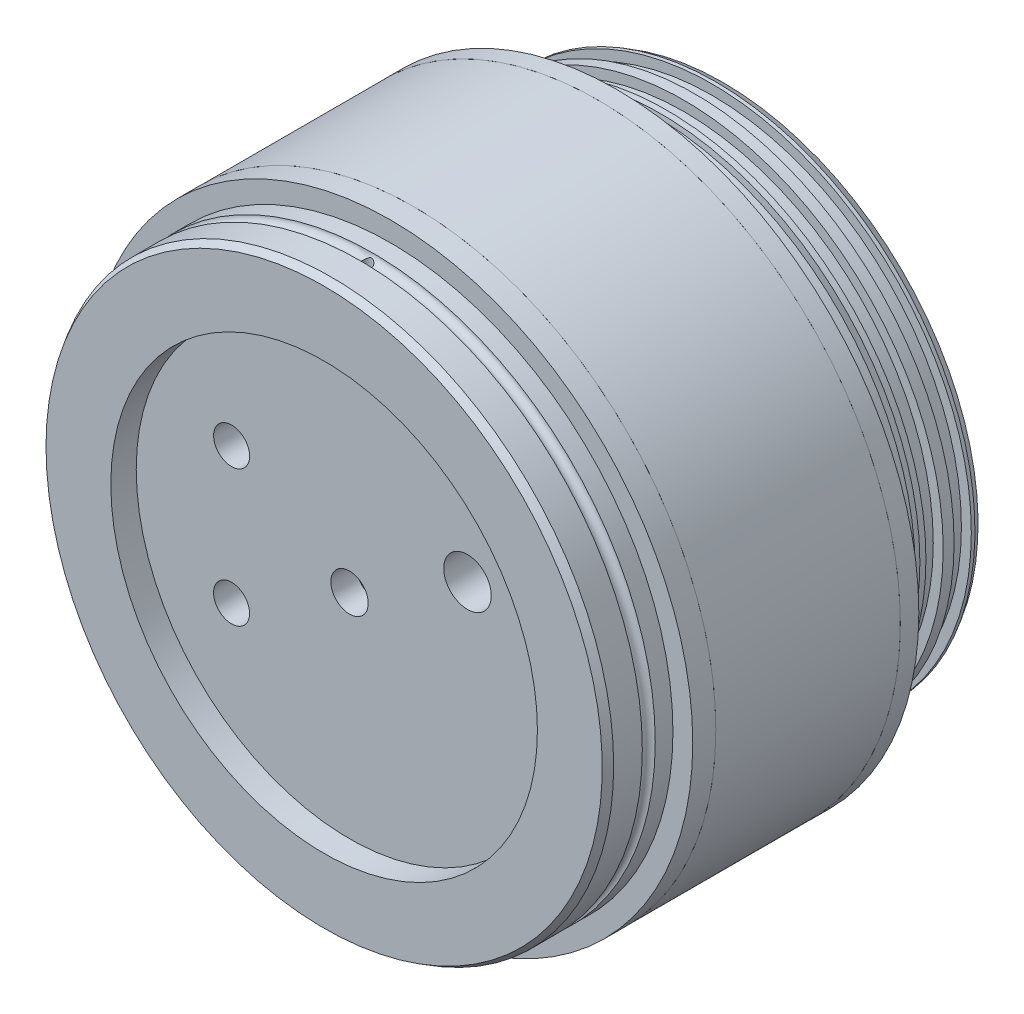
ISO-10303-21;
HEADER;
FILE_DESCRIPTION(('STEP AP214'),'2;1');
FILE_NAME('part.step','',(''),(''),'','','');
FILE_SCHEMA(('AUTOMOTIVE_DESIGN { 1 0 10303 214 1 1 1 1 }'));
ENDSEC;
DATA;
#1=APPLICATION_CONTEXT('core data for automotive mechanical design processes');
#2=APPLICATION_PROTOCOL_DEFINITION('international standard','automotive_design',2000,#1);
#3=PRODUCT_CONTEXT('',#1,'mechanical');
#4=PRODUCT('Part','Part','',(#3));
#5=PRODUCT_RELATED_PRODUCT_CATEGORY('part','',(#4));
#6=PRODUCT_DEFINITION_FORMATION('','',#4);
#7=PRODUCT_DEFINITION_CONTEXT('part definition',#1,'design');
#8=PRODUCT_DEFINITION('design','',#6,#7);
#9=PRODUCT_DEFINITION_SHAPE('','',#8);
#10=(LENGTH_UNIT() NAMED_UNIT(*) SI_UNIT(.MILLI.,.METRE.));
#11=(NAMED_UNIT(*) PLANE_ANGLE_UNIT() SI_UNIT($,.RADIAN.));
#12=(NAMED_UNIT(*) SI_UNIT($,.STERADIAN.) SOLID_ANGLE_UNIT());
#13=UNCERTAINTY_MEASURE_WITH_UNIT(LENGTH_MEASURE(1.E-05),#10,'distance_accuracy_value','');
#14=(GEOMETRIC_REPRESENTATION_CONTEXT(3) GLOBAL_UNCERTAINTY_ASSIGNED_CONTEXT((#13)) GLOBAL_UNIT_ASSIGNED_CONTEXT((#10,
#11,#12)) REPRESENTATION_CONTEXT('',''));
#15=CARTESIAN_POINT('',(0.,0.,0.));
#16=DIRECTION('',(0.,0.,1.));
#17=DIRECTION('',(1.,0.,0.));
#18=AXIS2_PLACEMENT_3D('',#15,#16,#17);
#19=CARTESIAN_POINT('',(56.958821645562,152.712417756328,48.9044987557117));
#20=DIRECTION('',(0.,0.,1.));
#21=DIRECTION('',(1.,0.,0.));
#22=AXIS2_PLACEMENT_3D('',#19,#20,#21);
#23=PLANE('',#22);
#24=CARTESIAN_POINT('',(56.958821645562,81.3624177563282,48.9044987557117));
#25=DIRECTION('',(0.,0.,1.));
#26=DIRECTION('',(1.,0.,0.));
#27=AXIS2_PLACEMENT_3D('',#24,#25,#26);
#28=CIRCLE('',#27,63.5);
#29=CARTESIAN_POINT('',(120.458821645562,81.3624177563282,48.9044987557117));
#30=VERTEX_POINT('',#29);
#31=EDGE_CURVE('P0_E174',#30,#30,#28,.T.);
#32=ORIENTED_EDGE('',*,*,#31,.T.);
#33=EDGE_LOOP('',(#32));
#34=FACE_BOUND('',#33,.T.);
#35=CARTESIAN_POINT('',(56.958821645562,81.3624177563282,48.9044987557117));
#36=DIRECTION('',(0.,0.,1.));
#37=DIRECTION('',(0.,1.,0.));
#38=AXIS2_PLACEMENT_3D('',#35,#36,#37);
#39=CIRCLE('',#38,70.1952994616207);
#40=CARTESIAN_POINT('',(56.958821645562,151.557717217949,48.9044987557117));
#41=VERTEX_POINT('',#40);
#42=EDGE_CURVE('P0_E84',#41,#41,#39,.T.);
#43=ORIENTED_EDGE('',*,*,#42,.F.);
#44=EDGE_LOOP('',(#43));
#45=FACE_BOUND('',#44,.T.);
#46=ADVANCED_FACE('P0_F45',(#34,#45),#23,.F.);
#47=CARTESIAN_POINT('',(56.958821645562,81.3624177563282,50.9044987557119));
#48=DIRECTION('',(0.,0.,1.));
#49=DIRECTION('',(0.,1.,0.));
#50=AXIS2_PLACEMENT_3D('',#47,#48,#49);
#51=CONICAL_SURFACE('',#50,71.35,0.523598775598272);
#52=CARTESIAN_POINT('',(56.958821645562,81.3624177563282,50.9044987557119));
#53=DIRECTION('',(0.,0.,-1.));
#54=DIRECTION('',(-1.,0.,0.));
#55=AXIS2_PLACEMENT_3D('',#52,#53,#54);
#56=CIRCLE('',#55,71.35);
#57=CARTESIAN_POINT('',(-14.391178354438,81.3624177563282,50.9044987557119));
#58=VERTEX_POINT('',#57);
#59=EDGE_CURVE('P0_E80',#58,#58,#56,.F.);
#60=ORIENTED_EDGE('',*,*,#59,.F.);
#61=EDGE_LOOP('',(#60));
#62=FACE_BOUND('',#61,.T.);
#63=ORIENTED_EDGE('',*,*,#42,.T.);
#64=EDGE_LOOP('',(#63));
#65=FACE_BOUND('',#64,.T.);
#66=ADVANCED_FACE('P0_F237',(#62,#65),#51,.T.);
#67=CARTESIAN_POINT('',(56.958821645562,81.3624177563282,76.3628987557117));
#68=DIRECTION('',(0.,0.,-1.));
#69=DIRECTION('',(-1.,0.,0.));
#70=AXIS2_PLACEMENT_3D('',#67,#68,#69);
#71=CYLINDRICAL_SURFACE('',#70,71.35);
#72=ORIENTED_EDGE('',*,*,#59,.T.);
#73=EDGE_LOOP('',(#72));
#74=FACE_BOUND('',#73,.T.);
#75=CARTESIAN_POINT('',(56.958821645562,81.3624177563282,51.9044987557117));
#76=DIRECTION('',(0.,0.,-1.));
#77=DIRECTION('',(-1.,0.,0.));
#78=AXIS2_PLACEMENT_3D('',#75,#76,#77);
#79=CIRCLE('',#78,71.35);
#80=CARTESIAN_POINT('',(-14.391178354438,81.3624177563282,51.9044987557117));
#81=VERTEX_POINT('',#80);
#82=EDGE_CURVE('P0_E83',#81,#81,#79,.T.);
#83=ORIENTED_EDGE('',*,*,#82,.T.);
#84=EDGE_LOOP('',(#83));
#85=FACE_BOUND('',#84,.T.);
#86=ADVANCED_FACE('P0_F233',(#74,#85),#71,.T.);
#87=CARTESIAN_POINT('',(56.958821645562,149.980517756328,51.9044987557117));
#88=DIRECTION('',(0.,0.,-1.));
#89=DIRECTION('',(-1.,0.,0.));
#90=AXIS2_PLACEMENT_3D('',#87,#88,#89);
#91=PLANE('',#90);
#92=CARTESIAN_POINT('',(56.958821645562,81.3624177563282,51.9044987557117));
#93=DIRECTION('',(0.,0.,-1.));
#94=DIRECTION('',(-1.,0.,0.));
#95=AXIS2_PLACEMENT_3D('',#92,#93,#94);
#96=CIRCLE('',#95,68.6181);
#97=CARTESIAN_POINT('',(-11.659278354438,81.3624177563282,51.9044987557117));
#98=VERTEX_POINT('',#97);
#99=EDGE_CURVE('P0_E167',#98,#98,#96,.F.);
#100=ORIENTED_EDGE('',*,*,#99,.F.);
#101=EDGE_LOOP('',(#100));
#102=FACE_BOUND('',#101,.T.);
#103=ORIENTED_EDGE('',*,*,#82,.F.);
#104=EDGE_LOOP('',(#103));
#105=FACE_BOUND('',#104,.T.);
#106=ADVANCED_FACE('P0_F229',(#102,#105),#91,.F.);
#107=CARTESIAN_POINT('',(56.958821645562,81.3624177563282,76.3628987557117));
#108=DIRECTION('',(0.,0.,-1.));
#109=DIRECTION('',(-1.,0.,0.));
#110=AXIS2_PLACEMENT_3D('',#107,#108,#109);
#111=CYLINDRICAL_SURFACE('',#110,68.6181);
#112=ORIENTED_EDGE('',*,*,#99,.T.);
#113=EDGE_LOOP('',(#112));
#114=FACE_BOUND('',#113,.T.);
#115=CARTESIAN_POINT('',(56.958821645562,81.3624177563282,56.6542987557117));
#116=DIRECTION('',(0.,0.,-1.));
#117=DIRECTION('',(-1.,0.,0.));
#118=AXIS2_PLACEMENT_3D('',#115,#116,#117);
#119=CIRCLE('',#118,68.6181);
#120=CARTESIAN_POINT('',(-11.659278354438,81.3624177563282,56.6542987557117));
#121=VERTEX_POINT('',#120);
#122=EDGE_CURVE('P0_E164',#121,#121,#119,.T.);
#123=ORIENTED_EDGE('',*,*,#122,.T.);
#124=EDGE_LOOP('',(#123));
#125=FACE_BOUND('',#124,.T.);
#126=ADVANCED_FACE('P0_F225',(#114,#125),#111,.T.);
#127=CARTESIAN_POINT('',(56.958821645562,152.712417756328,56.6542987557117));
#128=DIRECTION('',(0.,0.,1.));
#129=DIRECTION('',(1.,0.,0.));
#130=AXIS2_PLACEMENT_3D('',#127,#128,#129);
#131=PLANE('',#130);
#132=CARTESIAN_POINT('',(56.958821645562,81.3624177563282,56.6542987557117));
#133=DIRECTION('',(0.,0.,-1.));
#134=DIRECTION('',(-1.,0.,0.));
#135=AXIS2_PLACEMENT_3D('',#132,#133,#134);
#136=CIRCLE('',#135,71.35);
#137=CARTESIAN_POINT('',(-14.391178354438,81.3624177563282,56.6542987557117));
#138=VERTEX_POINT('',#137);
#139=EDGE_CURVE('P0_E161',#138,#138,#136,.F.);
#140=ORIENTED_EDGE('',*,*,#139,.F.);
#141=EDGE_LOOP('',(#140));
#142=FACE_BOUND('',#141,.T.);
#143=ORIENTED_EDGE('',*,*,#122,.F.);
#144=EDGE_LOOP('',(#143));
#145=FACE_BOUND('',#144,.T.);
#146=ADVANCED_FACE('P0_F221',(#142,#145),#131,.F.);
#147=CARTESIAN_POINT('',(56.958821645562,81.3624177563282,76.3628987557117));
#148=DIRECTION('',(0.,0.,-1.));
#149=DIRECTION('',(-1.,0.,0.));
#150=AXIS2_PLACEMENT_3D('',#147,#148,#149);
#151=CYLINDRICAL_SURFACE('',#150,71.35);
#152=ORIENTED_EDGE('',*,*,#139,.T.);
#153=EDGE_LOOP('',(#152));
#154=FACE_BOUND('',#153,.T.);
#155=CARTESIAN_POINT('',(56.958821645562,81.3624177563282,59.6542987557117));
#156=DIRECTION('',(0.,0.,-1.));
#157=DIRECTION('',(-1.,0.,0.));
#158=AXIS2_PLACEMENT_3D('',#155,#156,#157);
#159=CIRCLE('',#158,71.35);
#160=CARTESIAN_POINT('',(-14.391178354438,81.3624177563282,59.6542987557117));
#161=VERTEX_POINT('',#160);
#162=EDGE_CURVE('P0_E156',#161,#161,#159,.T.);
#163=ORIENTED_EDGE('',*,*,#162,.T.);
#164=EDGE_LOOP('',(#163));
#165=FACE_BOUND('',#164,.T.);
#166=ADVANCED_FACE('P0_F217',(#154,#165),#151,.T.);
#167=CARTESIAN_POINT('',(56.958821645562,149.980517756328,59.6542987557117));
#168=DIRECTION('',(0.,0.,-1.));
#169=DIRECTION('',(-1.,0.,0.));
#170=AXIS2_PLACEMENT_3D('',#167,#168,#169);
#171=PLANE('',#170);
#172=CARTESIAN_POINT('',(56.958821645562,81.3624177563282,59.6542987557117));
#173=DIRECTION('',(0.,0.,-1.));
#174=DIRECTION('',(-1.,0.,0.));
#175=AXIS2_PLACEMENT_3D('',#172,#173,#174);
#176=CIRCLE('',#175,68.6181);
#177=CARTESIAN_POINT('',(-11.659278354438,81.3624177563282,59.6542987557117));
#178=VERTEX_POINT('',#177);
#179=EDGE_CURVE('P0_E154',#178,#178,#176,.F.);
#180=ORIENTED_EDGE('',*,*,#179,.F.);
#181=EDGE_LOOP('',(#180));
#182=FACE_BOUND('',#181,.T.);
#183=ORIENTED_EDGE('',*,*,#162,.F.);
#184=EDGE_LOOP('',(#183));
#185=FACE_BOUND('',#184,.T.);
#186=ADVANCED_FACE('P0_F213',(#182,#185),#171,.F.);
#187=CARTESIAN_POINT('',(56.958821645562,81.3624177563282,76.3628987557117));
#188=DIRECTION('',(0.,0.,-1.));
#189=DIRECTION('',(-1.,0.,0.));
#190=AXIS2_PLACEMENT_3D('',#187,#188,#189);
#191=CYLINDRICAL_SURFACE('',#190,68.6181);
#192=ORIENTED_EDGE('',*,*,#179,.T.);
#193=EDGE_LOOP('',(#192));
#194=FACE_BOUND('',#193,.T.);
#195=CARTESIAN_POINT('',(56.958821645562,81.3624177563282,64.4040987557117));
#196=DIRECTION('',(0.,0.,-1.));
#197=DIRECTION('',(-1.,0.,0.));
#198=AXIS2_PLACEMENT_3D('',#195,#196,#197);
#199=CIRCLE('',#198,68.6181);
#200=CARTESIAN_POINT('',(-11.659278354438,81.3624177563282,64.4040987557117));
#201=VERTEX_POINT('',#200);
#202=EDGE_CURVE('P0_E72',#201,#201,#199,.T.);
#203=ORIENTED_EDGE('',*,*,#202,.T.);
#204=EDGE_LOOP('',(#203));
#205=FACE_BOUND('',#204,.T.);
#206=ADVANCED_FACE('P0_F149',(#194,#205),#191,.T.);
#207=CARTESIAN_POINT('',(56.958821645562,152.712417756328,64.4040987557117));
#208=DIRECTION('',(0.,0.,1.));
#209=DIRECTION('',(1.,0.,0.));
#210=AXIS2_PLACEMENT_3D('',#207,#208,#209);
#211=PLANE('',#210);
#212=CARTESIAN_POINT('',(56.958821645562,81.3624177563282,64.4040987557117));
#213=DIRECTION('',(0.,0.,-1.));
#214=DIRECTION('',(-1.,0.,0.));
#215=AXIS2_PLACEMENT_3D('',#212,#213,#214);
#216=CIRCLE('',#215,71.35);
#217=CARTESIAN_POINT('',(-14.391178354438,81.3624177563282,64.4040987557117));
#218=VERTEX_POINT('',#217);
#219=EDGE_CURVE('P0_E66',#218,#218,#216,.F.);
#220=ORIENTED_EDGE('',*,*,#219,.F.);
#221=EDGE_LOOP('',(#220));
#222=FACE_BOUND('',#221,.T.);
#223=ORIENTED_EDGE('',*,*,#202,.F.);
#224=EDGE_LOOP('',(#223));
#225=FACE_BOUND('',#224,.T.);
#226=ADVANCED_FACE('P0_F143',(#222,#225),#211,.F.);
#227=CARTESIAN_POINT('',(56.958821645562,81.3624177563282,76.3628987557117));
#228=DIRECTION('',(0.,0.,-1.));
#229=DIRECTION('',(-1.,0.,0.));
#230=AXIS2_PLACEMENT_3D('',#227,#228,#229);
#231=CYLINDRICAL_SURFACE('',#230,71.35);
#232=CARTESIAN_POINT('',(56.958821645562,81.3624177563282,66.0725209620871));
#233=DIRECTION('',(0.,0.,1.));
#234=DIRECTION('',(1.,0.,0.));
#235=AXIS2_PLACEMENT_3D('',#232,#233,#234);
#236=CIRCLE('',#235,71.35);
#237=CARTESIAN_POINT('',(128.308821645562,81.3624177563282,66.0725209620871));
#238=VERTEX_POINT('',#237);
#239=EDGE_CURVE('P0_E13',#238,#238,#236,.T.);
#240=ORIENTED_EDGE('',*,*,#239,.F.);
#241=EDGE_LOOP('',(#240));
#242=FACE_BOUND('',#241,.T.);
#243=ORIENTED_EDGE('',*,*,#219,.T.);
#244=EDGE_LOOP('',(#243));
#245=FACE_BOUND('',#244,.T.);
#246=ADVANCED_FACE('P0_F59',(#242,#245),#231,.T.);
#247=CARTESIAN_POINT('',(56.958821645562,150.294417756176,73.1960987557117));
#248=DIRECTION('',(0.,1.,0.));
#249=DIRECTION('',(0.,0.,-1.));
#250=AXIS2_PLACEMENT_3D('',#247,#248,#249);
#251=CONICAL_SURFACE('',#250,1.44999999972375,1.02974425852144);
#252=CARTESIAN_POINT('',(56.958821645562,149.423169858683,73.1960987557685));
#253=VERTEX_POINT('',#252);
#254=VERTEX_LOOP('',#253);
#255=FACE_BOUND('',#254,.T.);
#256=CARTESIAN_POINT('',(56.958821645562,150.294417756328,73.1960987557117));
#257=DIRECTION('',(0.,1.,0.));
#258=DIRECTION('',(0.,0.,-1.));
#259=AXIS2_PLACEMENT_3D('',#256,#257,#258);
#260=CIRCLE('',#259,1.45);
#261=CARTESIAN_POINT('',(56.958821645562,150.294417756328,71.7460987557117));
#262=VERTEX_POINT('',#261);
#263=EDGE_CURVE('P0_E63',#262,#262,#260,.T.);
#264=ORIENTED_EDGE('',*,*,#263,.T.);
#265=EDGE_LOOP('',(#264));
#266=FACE_BOUND('',#265,.T.);
#267=ADVANCED_FACE('P0_F55',(#255,#266),#251,.F.);
#268=CARTESIAN_POINT('',(56.958821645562,81.3624177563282,76.3628987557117));
#269=DIRECTION('',(0.,0.,-1.));
#270=DIRECTION('',(-1.,0.,0.));
#271=AXIS2_PLACEMENT_3D('',#268,#269,#270);
#272=CYLINDRICAL_SURFACE('',#271,72.112);
#273=CARTESIAN_POINT('',(56.958821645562,81.3624177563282,68.1660987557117));
#274=DIRECTION('',(0.,0.,-1.));
#275=DIRECTION('',(-1.,0.,0.));
#276=AXIS2_PLACEMENT_3D('',#273,#274,#275);
#277=CIRCLE('',#276,72.112);
#278=CARTESIAN_POINT('',(-15.1531783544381,81.3624177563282,68.1660987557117));
#279=VERTEX_POINT('',#278);
#280=EDGE_CURVE('P0_E138',#279,#279,#277,.T.);
#281=ORIENTED_EDGE('',*,*,#280,.F.);
#282=EDGE_LOOP('',(#281));
#283=FACE_BOUND('',#282,.T.);
#284=CARTESIAN_POINT('',(56.958821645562,81.3624177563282,71.1660987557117));
#285=DIRECTION('',(0.,0.,-1.));
#286=DIRECTION('',(-1.,0.,0.));
#287=AXIS2_PLACEMENT_3D('',#284,#285,#286);
#288=CIRCLE('',#287,72.112);
#289=CARTESIAN_POINT('',(-15.153178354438,81.3624177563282,71.1660987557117));
#290=VERTEX_POINT('',#289);
#291=EDGE_CURVE('P0_E65',#290,#290,#288,.T.);
#292=ORIENTED_EDGE('',*,*,#291,.T.);
#293=EDGE_LOOP('',(#292));
#294=FACE_BOUND('',#293,.T.);
#295=ADVANCED_FACE('P0_F58',(#283,#294),#272,.T.);
#296=CARTESIAN_POINT('',(56.958821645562,153.474417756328,73.1960987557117));
#297=DIRECTION('',(0.,1.,0.));
#298=DIRECTION('',(0.,0.,-1.));
#299=AXIS2_PLACEMENT_3D('',#296,#297,#298);
#300=CYLINDRICAL_SURFACE('',#299,1.45);
#301=CARTESIAN_POINT('',(55.5305359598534,151.679913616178,72.9460987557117));
#302=CARTESIAN_POINT('',(55.519046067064,151.679684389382,73.0117664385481));
#303=CARTESIAN_POINT('',(55.5120989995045,151.683203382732,73.078285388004));
#304=CARTESIAN_POINT('',(55.507377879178,151.697970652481,73.210803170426));
#305=CARTESIAN_POINT('',(55.5096098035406,151.709223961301,73.2768016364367));
#306=CARTESIAN_POINT('',(55.5226269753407,151.738923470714,73.4059630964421));
#307=CARTESIAN_POINT('',(55.5333770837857,151.757339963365,73.4691366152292));
#308=CARTESIAN_POINT('',(55.5623468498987,151.800427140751,73.5914703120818));
#309=CARTESIAN_POINT('',(55.5805696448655,151.825100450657,73.6506287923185));
#310=CARTESIAN_POINT('',(55.630439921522,151.888695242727,73.7829816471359));
#311=CARTESIAN_POINT('',(55.6645373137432,151.929625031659,73.8542860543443));
#312=CARTESIAN_POINT('',(55.7413918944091,152.018164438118,73.9874950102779));
#313=CARTESIAN_POINT('',(55.7841698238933,152.065789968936,74.049376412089));
#314=CARTESIAN_POINT('',(55.8930416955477,152.183590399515,74.1843344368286));
#315=CARTESIAN_POINT('',(55.9619862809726,152.255712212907,74.2534255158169));
#316=CARTESIAN_POINT('',(56.0723981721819,152.36667326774,74.34458771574));
#317=CARTESIAN_POINT('',(56.1103728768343,152.404127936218,74.3728986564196));
#318=CARTESIAN_POINT('',(56.1886198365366,152.479429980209,74.4255345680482));
#319=CARTESIAN_POINT('',(56.2288910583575,152.517277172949,74.449861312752));
#320=CARTESIAN_POINT('',(56.3109803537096,152.591850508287,74.4941484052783));
#321=CARTESIAN_POINT('',(56.352748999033,152.628583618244,74.514188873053));
#322=CARTESIAN_POINT('',(56.4390732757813,152.700715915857,74.5505593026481));
#323=CARTESIAN_POINT('',(56.4836316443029,152.736113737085,74.5668855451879));
#324=CARTESIAN_POINT('',(56.5686707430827,152.797835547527,74.5932086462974));
#325=CARTESIAN_POINT('',(56.6085667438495,152.824681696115,74.603808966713));
#326=CARTESIAN_POINT('',(56.6710566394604,152.861248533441,74.6174155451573));
#327=CARTESIAN_POINT('',(56.6923083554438,152.872812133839,74.6215661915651));
#328=CARTESIAN_POINT('',(56.735820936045,152.894153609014,74.6290182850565));
#329=CARTESIAN_POINT('',(56.7580808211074,152.903933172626,74.6323205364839));
#330=CARTESIAN_POINT('',(56.8092665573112,152.923086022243,74.638648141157));
#331=CARTESIAN_POINT('',(56.8384948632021,152.931779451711,74.6414098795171));
#332=CARTESIAN_POINT('',(56.8980950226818,152.943611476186,74.6451303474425));
#333=CARTESIAN_POINT('',(56.9284604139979,152.946777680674,74.6460980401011));
#334=CARTESIAN_POINT('',(56.9868088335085,152.946785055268,74.6460994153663));
#335=CARTESIAN_POINT('',(57.0147924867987,152.944101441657,74.6452784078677));
#336=CARTESIAN_POINT('',(57.06984778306,152.933982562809,74.6421068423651));
#337=CARTESIAN_POINT('',(57.0969155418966,152.92652921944,74.6397504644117));
#338=CARTESIAN_POINT('',(57.1645017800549,152.902972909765,74.6320385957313));
#339=CARTESIAN_POINT('',(57.2040020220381,152.884362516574,74.6257412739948));
#340=CARTESIAN_POINT('',(57.2799978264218,152.842613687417,74.6106152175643));
#341=CARTESIAN_POINT('',(57.3164810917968,152.81945790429,74.6017767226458));
#342=CARTESIAN_POINT('',(57.3925050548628,152.767089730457,74.5803681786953));
#343=CARTESIAN_POINT('',(57.4316730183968,152.737491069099,74.5674358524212));
#344=CARTESIAN_POINT('',(57.5077786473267,152.67678032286,74.5387822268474));
#345=CARTESIAN_POINT('',(57.5447139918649,152.64566672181,74.5230580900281));
#346=CARTESIAN_POINT('',(57.6167748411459,152.582792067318,74.4888432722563));
#347=CARTESIAN_POINT('',(57.6518984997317,152.551030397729,74.4703498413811));
#348=CARTESIAN_POINT('',(57.7204785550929,152.487447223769,74.4305823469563));
#349=CARTESIAN_POINT('',(57.7539347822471,152.455625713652,74.4093080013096));
#350=CARTESIAN_POINT('',(57.8251718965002,152.386555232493,74.35977647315));
#351=CARTESIAN_POINT('',(57.8626298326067,152.349373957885,74.3309532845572));
#352=CARTESIAN_POINT('',(57.9351256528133,152.276067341,74.269224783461));
#353=CARTESIAN_POINT('',(57.9701626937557,152.239942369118,74.2363180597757));
#354=CARTESIAN_POINT('',(58.07106119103,152.134128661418,74.1314131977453));
#355=CARTESIAN_POINT('',(58.1330205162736,152.066695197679,74.0530195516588));
#356=CARTESIAN_POINT('',(58.2229411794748,151.964772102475,73.9094990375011));
#357=CARTESIAN_POINT('',(58.2552066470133,151.927020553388,73.849354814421));
#358=CARTESIAN_POINT('',(58.3118745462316,151.85783793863,73.7220283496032));
#359=CARTESIAN_POINT('',(58.3362785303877,151.826405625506,73.6548475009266));
#360=CARTESIAN_POINT('',(58.3755312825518,151.771369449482,73.5136447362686));
#361=CARTESIAN_POINT('',(58.3902716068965,151.747855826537,73.439555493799));
#362=CARTESIAN_POINT('',(58.4035226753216,151.720101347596,73.3257355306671));
#363=CARTESIAN_POINT('',(58.4064640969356,151.712105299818,73.2873738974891));
#364=CARTESIAN_POINT('',(58.4092677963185,151.698715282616,73.2100968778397));
#365=CARTESIAN_POINT('',(58.4091321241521,151.693319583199,73.1711818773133));
#366=CARTESIAN_POINT('',(58.4060423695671,151.686015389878,73.101119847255));
#367=CARTESIAN_POINT('',(58.4036646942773,151.683621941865,73.0699958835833));
#368=CARTESIAN_POINT('',(58.3968956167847,151.680514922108,73.007893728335));
#369=CARTESIAN_POINT('',(58.3925044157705,151.679801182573,72.976915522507));
#370=CARTESIAN_POINT('',(58.3746751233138,151.680172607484,72.875112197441));
#371=CARTESIAN_POINT('',(58.3569055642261,151.684815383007,72.804982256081));
#372=CARTESIAN_POINT('',(58.3115028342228,151.701787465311,72.6689062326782));
#373=CARTESIAN_POINT('',(58.2838450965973,151.714135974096,72.6029710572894));
#374=CARTESIAN_POINT('',(58.2201762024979,151.744714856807,72.4774913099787));
#375=CARTESIAN_POINT('',(58.1842326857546,151.762898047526,72.4179004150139));
#376=CARTESIAN_POINT('',(58.1050647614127,151.803344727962,72.3053883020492));
#377=CARTESIAN_POINT('',(58.0618404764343,151.825608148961,72.2524669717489));
#378=CARTESIAN_POINT('',(57.9632754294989,151.875269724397,72.1475885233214));
#379=CARTESIAN_POINT('',(57.9070973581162,151.90296240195,72.0965595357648));
#380=CARTESIAN_POINT('',(57.7875079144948,151.95848720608,72.0038251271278));
#381=CARTESIAN_POINT('',(57.7240903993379,151.986319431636,71.9621277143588));
#382=CARTESIAN_POINT('',(57.5955075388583,152.037057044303,71.8914564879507));
#383=CARTESIAN_POINT('',(57.53082923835,152.060175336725,71.8617633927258));
#384=CARTESIAN_POINT('',(57.4300444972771,152.090717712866,71.8243371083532));
#385=CARTESIAN_POINT('',(57.395854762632,152.100202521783,71.8130543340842));
#386=CARTESIAN_POINT('',(57.3262977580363,152.117424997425,71.792969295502));
#387=CARTESIAN_POINT('',(57.290929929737,152.125161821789,71.7841682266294));
#388=CARTESIAN_POINT('',(57.2069110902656,152.140791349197,71.7666339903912));
#389=CARTESIAN_POINT('',(57.1578683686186,152.147825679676,71.7589614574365));
#390=CARTESIAN_POINT('',(57.0588182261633,152.157293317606,71.7486956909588));
#391=CARTESIAN_POINT('',(57.0088112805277,152.159728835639,71.7461000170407));
#392=CARTESIAN_POINT('',(56.9233814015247,152.159733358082,71.7460978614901));
#393=CARTESIAN_POINT('',(56.8879498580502,152.15851244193,71.7474009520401));
#394=CARTESIAN_POINT('',(56.8174311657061,152.153712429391,71.752575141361));
#395=CARTESIAN_POINT('',(56.7823441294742,152.150132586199,71.7564470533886));
#396=CARTESIAN_POINT('',(56.677971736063,152.136107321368,71.7718232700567));
#397=CARTESIAN_POINT('',(56.6096431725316,152.122376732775,71.7870878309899));
#398=CARTESIAN_POINT('',(56.4781419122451,152.088884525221,71.826380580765));
#399=CARTESIAN_POINT('',(56.4149210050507,152.069190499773,71.8503111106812));
#400=CARTESIAN_POINT('',(56.2933662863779,152.026324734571,71.9060832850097));
#401=CARTESIAN_POINT('',(56.235034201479,152.003151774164,71.9379277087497));
#402=CARTESIAN_POINT('',(56.1139079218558,151.951429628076,72.0151490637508));
#403=CARTESIAN_POINT('',(56.0520989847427,151.922645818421,72.0619158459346));
#404=CARTESIAN_POINT('',(55.9363279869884,151.866463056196,72.1650739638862));
#405=CARTESIAN_POINT('',(55.8823671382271,151.83906431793,72.2214667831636));
#406=CARTESIAN_POINT('',(55.787903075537,151.790770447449,72.3378738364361));
#407=CARTESIAN_POINT('',(55.7466257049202,151.769511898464,72.3971051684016));
#408=CARTESIAN_POINT('',(55.6728207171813,151.732638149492,72.5223355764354));
#409=CARTESIAN_POINT('',(55.6402752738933,151.717011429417,72.5883204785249));
#410=CARTESIAN_POINT('',(55.5942653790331,151.697214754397,72.7031781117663));
#411=CARTESIAN_POINT('',(55.5780405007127,151.690969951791,72.7506026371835));
#412=CARTESIAN_POINT('',(55.5505220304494,151.682405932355,72.8472218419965));
#413=CARTESIAN_POINT('',(55.5392288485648,151.680087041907,72.8964166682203));
#414=CARTESIAN_POINT('',(55.5305359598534,151.679913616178,72.9460987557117));
#415=B_SPLINE_CURVE_WITH_KNOTS('',3,(#301,#302,#303,#304,#305,#306,#307,#308,#309,#310,#311,
#312,#313,#314,#315,#316,#317,#318,#319,#320,#321,#322,#323,#324,#325,#326,#327,#328,#329,#330,
#331,#332,#333,#334,#335,#336,#337,#338,#339,#340,#341,#342,#343,#344,#345,#346,#347,#348,#349,
#350,#351,#352,#353,#354,#355,#356,#357,#358,#359,#360,#361,#362,#363,#364,#365,#366,#367,#368,
#369,#370,#371,#372,#373,#374,#375,#376,#377,#378,#379,#380,#381,#382,#383,#384,#385,#386,#387,
#388,#389,#390,#391,#392,#393,#394,#395,#396,#397,#398,#399,#400,#401,#402,#403,#404,#405,#406,
#407,#408,#409,#410,#411,#412,#413,#414),.UNSPECIFIED.,.T.,.F.,(4,2,2,2,2,2,2,2,2,2,2,2,2,2,2,2,
2,2,2,2,2,2,2,2,2,2,2,2,2,2,2,2,2,2,2,2,2,2,2,2,2,2,2,2,2,2,2,2,2,2,2,2,2,2,2,2,4),(0.,
0.199795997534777,0.399722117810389,0.598827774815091,0.798017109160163,1.06356707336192,
1.32975916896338,1.69174844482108,1.87278591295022,2.05374256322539,2.23094482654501,
2.40832375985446,2.55570597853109,2.62927182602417,2.70276766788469,2.79417503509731,
2.88512448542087,2.96896230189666,3.05311977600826,3.18471395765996,3.31682048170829,
3.46891737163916,3.62116974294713,3.77357431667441,3.92599436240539,4.10619043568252,
4.28644895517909,4.6455297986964,4.87873582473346,5.1118957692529,5.3476293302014,
5.46534180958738,5.5829758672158,5.6767842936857,5.7705833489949,5.98664988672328,
6.20325700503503,6.4181548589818,6.63304909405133,6.87451155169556,7.11618044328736,
7.33974061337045,7.4513163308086,7.56294570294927,7.7128988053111,7.86277980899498,
7.96903822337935,8.075330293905,8.28811520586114,8.49857323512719,8.70910528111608,
8.95621138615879,9.20335560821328,9.42825338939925,9.65268848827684,9.80383524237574,
9.95499456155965),.UNSPECIFIED.);
#416=CARTESIAN_POINT('',(55.5305359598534,151.679913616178,72.9460987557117));
#417=VERTEX_POINT('',#416);
#418=EDGE_CURVE('P0_E69',#417,#417,#415,.T.);
#419=ORIENTED_EDGE('',*,*,#418,.T.);
#420=EDGE_LOOP('',(#419));
#421=FACE_BOUND('',#420,.T.);
#422=ORIENTED_EDGE('',*,*,#263,.F.);
#423=EDGE_LOOP('',(#422));
#424=FACE_BOUND('',#423,.T.);
#425=ADVANCED_FACE('P0_F99',(#421,#424),#300,.F.);
#426=CARTESIAN_POINT('',(56.958821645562,81.3624177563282,72.9460987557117));
#427=DIRECTION('',(0.,0.,-1.));
#428=DIRECTION('',(-1.,0.,0.));
#429=AXIS2_PLACEMENT_3D('',#426,#427,#428);
#430=TOROIDAL_SURFACE('',#429,72.112,1.78);
#431=ORIENTED_EDGE('',*,*,#291,.F.);
#432=EDGE_LOOP('',(#431));
#433=FACE_BOUND('',#432,.T.);
#434=CARTESIAN_POINT('',(56.958821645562,81.3624177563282,74.7260987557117));
#435=DIRECTION('',(0.,0.,-1.));
#436=DIRECTION('',(-1.,0.,0.));
#437=AXIS2_PLACEMENT_3D('',#434,#435,#436);
#438=CIRCLE('',#437,72.112);
#439=CARTESIAN_POINT('',(-15.153178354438,81.3624177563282,74.7260987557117));
#440=VERTEX_POINT('',#439);
#441=EDGE_CURVE('P0_E92',#440,#440,#438,.F.);
#442=ORIENTED_EDGE('',*,*,#441,.F.);
#443=EDGE_LOOP('',(#442));
#444=FACE_BOUND('',#443,.T.);
#445=ORIENTED_EDGE('',*,*,#418,.F.);
#446=EDGE_LOOP('',(#445));
#447=FACE_BOUND('',#446,.T.);
#448=ADVANCED_FACE('P0_F102',(#433,#444,#447),#430,.F.);
#449=CARTESIAN_POINT('',(56.958821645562,81.3624177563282,76.3628987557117));
#450=DIRECTION('',(0.,0.,-1.));
#451=DIRECTION('',(-1.,0.,0.));
#452=AXIS2_PLACEMENT_3D('',#449,#450,#451);
#453=CYLINDRICAL_SURFACE('',#452,72.112);
#454=ORIENTED_EDGE('',*,*,#441,.T.);
#455=EDGE_LOOP('',(#454));
#456=FACE_BOUND('',#455,.T.);
#457=CARTESIAN_POINT('',(56.958821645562,81.3624177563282,78.1960987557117));
#458=DIRECTION('',(0.,0.,-1.));
#459=DIRECTION('',(-1.,0.,0.));
#460=AXIS2_PLACEMENT_3D('',#457,#458,#459);
#461=CIRCLE('',#460,72.112);
#462=CARTESIAN_POINT('',(-15.153178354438,81.3624177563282,78.1960987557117));
#463=VERTEX_POINT('',#462);
#464=EDGE_CURVE('P0_E89',#463,#463,#461,.T.);
#465=ORIENTED_EDGE('',*,*,#464,.T.);
#466=EDGE_LOOP('',(#465));
#467=FACE_BOUND('',#466,.T.);
#468=ADVANCED_FACE('P0_F106',(#456,#467),#453,.T.);
#469=CARTESIAN_POINT('',(156.958821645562,-18.6375822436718,78.1960987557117));
#470=DIRECTION('',(0.,0.,1.));
#471=DIRECTION('',(1.,0.,0.));
#472=AXIS2_PLACEMENT_3D('',#469,#470,#471);
#473=PLANE('',#472);
#474=ORIENTED_EDGE('',*,*,#464,.F.);
#475=EDGE_LOOP('',(#474));
#476=FACE_BOUND('',#475,.T.);
#477=CARTESIAN_POINT('',(56.958821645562,81.3624177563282,78.1960987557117));
#478=DIRECTION('',(0.,0.,-1.));
#479=DIRECTION('',(-1.,0.,0.));
#480=AXIS2_PLACEMENT_3D('',#477,#478,#479);
#481=CIRCLE('',#480,83.1850015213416);
#482=CARTESIAN_POINT('',(-26.2261798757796,81.3624177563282,78.1960987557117));
#483=VERTEX_POINT('',#482);
#484=EDGE_CURVE('P0_E85',#483,#483,#481,.F.);
#485=ORIENTED_EDGE('',*,*,#484,.F.);
#486=EDGE_LOOP('',(#485));
#487=FACE_BOUND('',#486,.T.);
#488=ADVANCED_FACE('P0_F110',(#476,#487),#473,.F.);
#489=CARTESIAN_POINT('',(56.958821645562,81.3624177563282,-331.081281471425));
#490=DIRECTION('',(0.,0.,-1.));
#491=DIRECTION('',(-1.,0.,0.));
#492=AXIS2_PLACEMENT_3D('',#489,#490,#491);
#493=CYLINDRICAL_SURFACE('',#492,83.1850015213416);
#494=CARTESIAN_POINT('',(56.958821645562,81.3624177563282,83.2926721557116));
#495=DIRECTION('',(0.,0.,-1.));
#496=DIRECTION('',(-1.,0.,0.));
#497=AXIS2_PLACEMENT_3D('',#494,#495,#496);
#498=CIRCLE('',#497,83.1850015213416);
#499=CARTESIAN_POINT('',(-26.2261798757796,81.3624177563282,83.2926721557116));
#500=VERTEX_POINT('',#499);
#501=EDGE_CURVE('P0_E88',#500,#500,#498,.T.);
#502=ORIENTED_EDGE('',*,*,#501,.T.);
#503=EDGE_LOOP('',(#502));
#504=FACE_BOUND('',#503,.T.);
#505=ORIENTED_EDGE('',*,*,#484,.T.);
#506=EDGE_LOOP('',(#505));
#507=FACE_BOUND('',#506,.T.);
#508=ADVANCED_FACE('P0_F114',(#504,#507),#493,.T.);
#509=CARTESIAN_POINT('',(56.958821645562,81.3624177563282,83.2926721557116));
#510=DIRECTION('',(0.,0.,-1.));
#511=DIRECTION('',(-1.,0.,0.));
#512=AXIS2_PLACEMENT_3D('',#509,#510,#511);
#513=PLANE('',#512);
#514=CARTESIAN_POINT('',(56.958821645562,81.3624177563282,83.2926721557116));
#515=DIRECTION('',(0.,0.,-1.));
#516=DIRECTION('',(-1.,0.,0.));
#517=AXIS2_PLACEMENT_3D('',#514,#515,#516);
#518=CIRCLE('',#517,66.675);
#519=CARTESIAN_POINT('',(123.633821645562,81.3624177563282,83.2926721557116));
#520=VERTEX_POINT('',#519);
#521=EDGE_CURVE('P0_E52',#520,#520,#518,.T.);
#522=ORIENTED_EDGE('',*,*,#521,.T.);
#523=EDGE_LOOP('',(#522));
#524=FACE_BOUND('',#523,.T.);
#525=ORIENTED_EDGE('',*,*,#501,.F.);
#526=EDGE_LOOP('',(#525));
#527=FACE_BOUND('',#526,.T.);
#528=ADVANCED_FACE('P0_F118',(#524,#527),#513,.F.);
#529=CARTESIAN_POINT('',(56.958821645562,81.3624177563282,48.9044987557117));
#530=DIRECTION('',(0.,0.,1.));
#531=DIRECTION('',(1.,0.,0.));
#532=AXIS2_PLACEMENT_3D('',#529,#530,#531);
#533=CYLINDRICAL_SURFACE('',#532,63.5);
#534=CARTESIAN_POINT('',(56.958821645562,81.3624177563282,80.1176721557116));
#535=DIRECTION('',(0.,0.,-1.));
#536=DIRECTION('',(-1.,0.,0.));
#537=AXIS2_PLACEMENT_3D('',#534,#535,#536);
#538=CIRCLE('',#537,63.5);
#539=CARTESIAN_POINT('',(120.458821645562,81.3624177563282,80.1176721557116));
#540=VERTEX_POINT('',#539);
#541=EDGE_CURVE('P0_E175',#540,#540,#538,.F.);
#542=ORIENTED_EDGE('',*,*,#541,.T.);
#543=EDGE_LOOP('',(#542));
#544=FACE_BOUND('',#543,.T.);
#545=ORIENTED_EDGE('',*,*,#31,.F.);
#546=EDGE_LOOP('',(#545));
#547=FACE_BOUND('',#546,.T.);
#548=ADVANCED_FACE('P0_F122',(#544,#547),#533,.F.);
#549=CARTESIAN_POINT('',(56.958821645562,81.3624177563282,80.1176721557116));
#550=DIRECTION('',(0.,0.,1.));
#551=DIRECTION('',(1.,0.,0.));
#552=AXIS2_PLACEMENT_3D('',#549,#550,#551);
#553=CONICAL_SURFACE('',#552,63.5,0.785398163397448);
#554=CARTESIAN_POINT('',(123.633821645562,81.3624177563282,83.2926721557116));
#555=CARTESIAN_POINT('',(123.600748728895,81.3624177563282,83.2595992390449));
#556=CARTESIAN_POINT('',(123.567675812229,81.3624177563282,83.2265263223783));
#557=CARTESIAN_POINT('',(123.501529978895,81.3624177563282,83.1603804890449));
#558=CARTESIAN_POINT('',(123.468457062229,81.3624177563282,83.1273075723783));
#559=CARTESIAN_POINT('',(123.402311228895,81.3624177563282,83.0611617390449));
#560=CARTESIAN_POINT('',(123.369238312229,81.3624177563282,83.0280888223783));
#561=CARTESIAN_POINT('',(123.303092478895,81.3624177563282,82.9619429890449));
#562=CARTESIAN_POINT('',(123.270019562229,81.3624177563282,82.9288700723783));
#563=CARTESIAN_POINT('',(123.203873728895,81.3624177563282,82.8627242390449));
#564=CARTESIAN_POINT('',(123.170800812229,81.3624177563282,82.8296513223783));
#565=CARTESIAN_POINT('',(123.104654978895,81.3624177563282,82.7635054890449));
#566=CARTESIAN_POINT('',(123.071582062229,81.3624177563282,82.7304325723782));
#567=CARTESIAN_POINT('',(123.005436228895,81.3624177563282,82.6642867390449));
#568=CARTESIAN_POINT('',(122.972363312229,81.3624177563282,82.6312138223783));
#569=CARTESIAN_POINT('',(122.906217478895,81.3624177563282,82.5650679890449));
#570=CARTESIAN_POINT('',(122.873144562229,81.3624177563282,82.5319950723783));
#571=CARTESIAN_POINT('',(122.806998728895,81.3624177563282,82.4658492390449));
#572=CARTESIAN_POINT('',(122.773925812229,81.3624177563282,82.4327763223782));
#573=CARTESIAN_POINT('',(122.707779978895,81.3624177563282,82.3666304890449));
#574=CARTESIAN_POINT('',(122.674707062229,81.3624177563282,82.3335575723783));
#575=CARTESIAN_POINT('',(122.608561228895,81.3624177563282,82.2674117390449));
#576=CARTESIAN_POINT('',(122.575488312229,81.3624177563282,82.2343388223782));
#577=CARTESIAN_POINT('',(122.509342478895,81.3624177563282,82.1681929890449));
#578=CARTESIAN_POINT('',(122.476269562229,81.3624177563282,82.1351200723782));
#579=CARTESIAN_POINT('',(122.410123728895,81.3624177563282,82.0689742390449));
#580=CARTESIAN_POINT('',(122.377050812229,81.3624177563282,82.0359013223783));
#581=CARTESIAN_POINT('',(122.310904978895,81.3624177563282,81.9697554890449));
#582=CARTESIAN_POINT('',(122.277832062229,81.3624177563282,81.9366825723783));
#583=CARTESIAN_POINT('',(122.211686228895,81.3624177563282,81.8705367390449));
#584=CARTESIAN_POINT('',(122.178613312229,81.3624177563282,81.8374638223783));
#585=CARTESIAN_POINT('',(122.112467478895,81.3624177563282,81.7713179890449));
#586=CARTESIAN_POINT('',(122.079394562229,81.3624177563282,81.7382450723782));
#587=CARTESIAN_POINT('',(122.013248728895,81.3624177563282,81.6720992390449));
#588=CARTESIAN_POINT('',(121.980175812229,81.3624177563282,81.6390263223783));
#589=CARTESIAN_POINT('',(121.914029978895,81.3624177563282,81.5728804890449));
#590=CARTESIAN_POINT('',(121.880957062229,81.3624177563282,81.5398075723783));
#591=CARTESIAN_POINT('',(121.814811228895,81.3624177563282,81.4736617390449));
#592=CARTESIAN_POINT('',(121.781738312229,81.3624177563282,81.4405888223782));
#593=CARTESIAN_POINT('',(121.715592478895,81.3624177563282,81.3744429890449));
#594=CARTESIAN_POINT('',(121.682519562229,81.3624177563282,81.3413700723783));
#595=CARTESIAN_POINT('',(121.616373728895,81.3624177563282,81.2752242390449));
#596=CARTESIAN_POINT('',(121.583300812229,81.3624177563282,81.2421513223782));
#597=CARTESIAN_POINT('',(121.517154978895,81.3624177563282,81.1760054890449));
#598=CARTESIAN_POINT('',(121.484082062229,81.3624177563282,81.1429325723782));
#599=CARTESIAN_POINT('',(121.417936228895,81.3624177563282,81.0767867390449));
#600=CARTESIAN_POINT('',(121.384863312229,81.3624177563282,81.0437138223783));
#601=CARTESIAN_POINT('',(121.318717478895,81.3624177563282,80.9775679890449));
#602=CARTESIAN_POINT('',(121.285644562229,81.3624177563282,80.9444950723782));
#603=CARTESIAN_POINT('',(121.219498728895,81.3624177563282,80.8783492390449));
#604=CARTESIAN_POINT('',(121.186425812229,81.3624177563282,80.8452763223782));
#605=CARTESIAN_POINT('',(121.120279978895,81.3624177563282,80.7791304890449));
#606=CARTESIAN_POINT('',(121.087207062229,81.3624177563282,80.7460575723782));
#607=CARTESIAN_POINT('',(121.021061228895,81.3624177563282,80.6799117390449));
#608=CARTESIAN_POINT('',(120.987988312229,81.3624177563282,80.6468388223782));
#609=CARTESIAN_POINT('',(120.921842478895,81.3624177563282,80.5806929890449));
#610=CARTESIAN_POINT('',(120.888769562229,81.3624177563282,80.5476200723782));
#611=CARTESIAN_POINT('',(120.822623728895,81.3624177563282,80.4814742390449));
#612=CARTESIAN_POINT('',(120.789550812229,81.3624177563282,80.4484013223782));
#613=CARTESIAN_POINT('',(120.723404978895,81.3624177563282,80.3822554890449));
#614=CARTESIAN_POINT('',(120.690332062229,81.3624177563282,80.3491825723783));
#615=CARTESIAN_POINT('',(120.624186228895,81.3624177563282,80.2830367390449));
#616=CARTESIAN_POINT('',(120.591113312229,81.3624177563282,80.2499638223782));
#617=CARTESIAN_POINT('',(120.524967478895,81.3624177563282,80.1838179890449));
#618=CARTESIAN_POINT('',(120.491894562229,81.3624177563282,80.1507450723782));
#619=CARTESIAN_POINT('',(120.458821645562,81.3624177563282,80.1176721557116));
#620=B_SPLINE_CURVE_WITH_KNOTS('',3,(#554,#555,#556,#557,#558,#559,#560,#561,#562,#563,#564,
#565,#566,#567,#568,#569,#570,#571,#572,#573,#574,#575,#576,#577,#578,#579,#580,#581,#582,#583,
#584,#585,#586,#587,#588,#589,#590,#591,#592,#593,#594,#595,#596,#597,#598,#599,#600,#601,#602,
#603,#604,#605,#606,#607,#608,#609,#610,#611,#612,#613,#614,#615,#616,#617,#618,#619),
.UNSPECIFIED.,.F.,.F.,(4,2,2,2,2,2,2,2,2,2,2,2,2,2,2,2,2,2,2,2,2,2,2,2,2,2,2,2,2,2,2,2,4),(0.,
0.140316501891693,0.280633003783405,0.420949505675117,0.561266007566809,0.701582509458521,
0.841899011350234,0.982215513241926,1.12253201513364,1.26284851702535,1.40316501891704,
1.54348152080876,1.68379802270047,1.82411452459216,1.96443102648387,2.10474752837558,
2.24506403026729,2.38538053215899,2.5256970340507,2.66601353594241,2.80633003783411,
2.94664653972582,3.08696304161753,3.22727954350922,3.36759604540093,3.50791254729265,
3.64822904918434,3.78854555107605,3.92886205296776,4.06917855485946,4.20949505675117,
4.34981155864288,4.49012806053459),.UNSPECIFIED.);
#621=EDGE_CURVE('P0_BSEAM47',#520,#540,#620,.T.);
#622=ORIENTED_EDGE('',*,*,#521,.F.);
#623=ORIENTED_EDGE('',*,*,#541,.F.);
#624=ORIENTED_EDGE('',*,*,#621,.T.);
#625=ORIENTED_EDGE('',*,*,#621,.F.);
#626=EDGE_LOOP('',(#622,#624,#623,#625));
#627=FACE_BOUND('',#626,.T.);
#628=ADVANCED_FACE('P0_F47',(#627),#553,.F.);
#629=CARTESIAN_POINT('',(56.958821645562,81.3624177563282,66.0725209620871));
#630=DIRECTION('',(0.,0.,1.));
#631=DIRECTION('',(1.,0.,0.));
#632=AXIS2_PLACEMENT_3D('',#629,#630,#631);
#633=CONICAL_SURFACE('',#632,71.35,0.349065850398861);
#634=ORIENTED_EDGE('',*,*,#280,.T.);
#635=EDGE_LOOP('',(#634));
#636=FACE_BOUND('',#635,.T.);
#637=ORIENTED_EDGE('',*,*,#239,.T.);
#638=EDGE_LOOP('',(#637));
#639=FACE_BOUND('',#638,.T.);
#640=ADVANCED_FACE('P0_F127',(#636,#639),#633,.T.);
#641=CLOSED_SHELL('',(#46,#66,#86,#106,#126,#146,#166,#186,#206,#226,#246,#267,#295,#425,#448,
#468,#488,#508,#528,#548,#628,#640));
#642=MANIFOLD_SOLID_BREP('P0_B2',#641);
#643=CARTESIAN_POINT('',(56.958821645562,81.3624177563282,138.559472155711));
#644=DIRECTION('',(0.,0.,1.));
#645=DIRECTION('',(0.,-1.,0.));
#646=AXIS2_PLACEMENT_3D('',#643,#644,#645);
#647=PLANE('',#646);
#648=CARTESIAN_POINT('',(24.4828690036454,62.6124177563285,138.559472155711));
#649=DIRECTION('',(0.,0.,1.));
#650=DIRECTION('',(0.,-1.,0.));
#651=AXIS2_PLACEMENT_3D('',#648,#649,#650);
#652=CIRCLE('',#651,9.525);
#653=CARTESIAN_POINT('',(24.4828690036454,53.0874177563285,138.559472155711));
#654=VERTEX_POINT('',#653);
#655=EDGE_CURVE('P1_E61',#654,#654,#652,.T.);
#656=ORIENTED_EDGE('',*,*,#655,.F.);
#657=EDGE_LOOP('',(#656));
#658=FACE_BOUND('',#657,.T.);
#659=CARTESIAN_POINT('',(24.4828690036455,100.112417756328,138.559472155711));
#660=DIRECTION('',(0.,0.,1.));
#661=DIRECTION('',(0.,-1.,0.));
#662=AXIS2_PLACEMENT_3D('',#659,#660,#661);
#663=CIRCLE('',#662,9.525);
#664=CARTESIAN_POINT('',(24.4828690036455,90.5874177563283,138.559472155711));
#665=VERTEX_POINT('',#664);
#666=EDGE_CURVE('P1_E74',#665,#665,#663,.T.);
#667=ORIENTED_EDGE('',*,*,#666,.F.);
#668=EDGE_LOOP('',(#667));
#669=FACE_BOUND('',#668,.T.);
#670=CARTESIAN_POINT('',(89.4347742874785,100.112417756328,138.559472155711));
#671=DIRECTION('',(0.,0.,1.));
#672=DIRECTION('',(0.,-1.,0.));
#673=AXIS2_PLACEMENT_3D('',#670,#671,#672);
#674=CIRCLE('',#673,12.7);
#675=CARTESIAN_POINT('',(89.4347742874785,87.412417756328,138.559472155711));
#676=VERTEX_POINT('',#675);
#677=EDGE_CURVE('P1_E71',#676,#676,#674,.T.);
#678=ORIENTED_EDGE('',*,*,#677,.F.);
#679=EDGE_LOOP('',(#678));
#680=FACE_BOUND('',#679,.T.);
#681=CARTESIAN_POINT('',(98.7170126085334,39.6042267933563,138.559472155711));
#682=DIRECTION('',(0.,0.,1.));
#683=DIRECTION('',(0.,-1.,0.));
#684=AXIS2_PLACEMENT_3D('',#681,#682,#683);
#685=CIRCLE('',#684,1.65);
#686=CARTESIAN_POINT('',(98.7170126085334,37.9542267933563,138.559472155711));
#687=VERTEX_POINT('',#686);
#688=EDGE_CURVE('P1_E67',#687,#687,#685,.T.);
#689=ORIENTED_EDGE('',*,*,#688,.F.);
#690=EDGE_LOOP('',(#689));
#691=FACE_BOUND('',#690,.T.);
#692=CARTESIAN_POINT('',(15.2006306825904,123.1206087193,138.559472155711));
#693=DIRECTION('',(0.,0.,-1.));
#694=DIRECTION('',(0.,1.,0.));
#695=AXIS2_PLACEMENT_3D('',#692,#693,#694);
#696=CIRCLE('',#695,1.65);
#697=CARTESIAN_POINT('',(15.2006306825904,121.4706087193,138.559472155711));
#698=VERTEX_POINT('',#697);
#699=EDGE_CURVE('P1_E82',#698,#698,#696,.T.);
#700=ORIENTED_EDGE('',*,*,#699,.T.);
#701=EDGE_LOOP('',(#700));
#702=FACE_BOUND('',#701,.T.);
#703=CARTESIAN_POINT('',(98.7170126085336,123.1206087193,138.559472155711));
#704=DIRECTION('',(0.,0.,1.));
#705=DIRECTION('',(0.,-1.,0.));
#706=AXIS2_PLACEMENT_3D('',#703,#704,#705);
#707=CIRCLE('',#706,1.65);
#708=CARTESIAN_POINT('',(98.7170126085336,121.4706087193,138.559472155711));
#709=VERTEX_POINT('',#708);
#710=EDGE_CURVE('P1_E58',#709,#709,#707,.T.);
#711=ORIENTED_EDGE('',*,*,#710,.F.);
#712=EDGE_LOOP('',(#711));
#713=FACE_BOUND('',#712,.T.);
#714=CARTESIAN_POINT('',(56.958821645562,81.3624177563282,138.559472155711));
#715=DIRECTION('',(0.,0.,1.));
#716=DIRECTION('',(0.,-1.,0.));
#717=AXIS2_PLACEMENT_3D('',#714,#715,#716);
#718=CIRCLE('',#717,68.58);
#719=CARTESIAN_POINT('',(56.958821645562,149.942417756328,138.559472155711));
#720=VERTEX_POINT('',#719);
#721=EDGE_CURVE('P1_E51',#720,#720,#718,.T.);
#722=ORIENTED_EDGE('',*,*,#721,.T.);
#723=EDGE_LOOP('',(#722));
#724=FACE_BOUND('',#723,.T.);
#725=CARTESIAN_POINT('',(15.2006306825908,39.6042267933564,138.559472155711));
#726=DIRECTION('',(0.,0.,1.));
#727=DIRECTION('',(0.,-1.,0.));
#728=AXIS2_PLACEMENT_3D('',#725,#726,#727);
#729=CIRCLE('',#728,1.6499999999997);
#730=CARTESIAN_POINT('',(15.2006306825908,37.9542267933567,138.559472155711));
#731=VERTEX_POINT('',#730);
#732=EDGE_CURVE('P1_E68',#731,#731,#729,.F.);
#733=ORIENTED_EDGE('',*,*,#732,.T.);
#734=EDGE_LOOP('',(#733));
#735=FACE_BOUND('',#734,.T.);
#736=ADVANCED_FACE('P1_F25',(#658,#669,#680,#691,#702,#713,#724,#735),#647,.T.);
#737=CARTESIAN_POINT('',(56.958821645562,81.3624177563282,132.209472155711));
#738=DIRECTION('',(0.,0.,1.));
#739=DIRECTION('',(0.,-1.,0.));
#740=AXIS2_PLACEMENT_3D('',#737,#738,#739);
#741=PLANE('',#740);
#742=CARTESIAN_POINT('',(24.4828690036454,62.6124177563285,132.209472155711));
#743=DIRECTION('',(0.,0.,1.));
#744=DIRECTION('',(0.,-1.,0.));
#745=AXIS2_PLACEMENT_3D('',#742,#743,#744);
#746=CIRCLE('',#745,11.1125);
#747=CARTESIAN_POINT('',(24.4828690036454,51.4999177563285,132.209472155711));
#748=VERTEX_POINT('',#747);
#749=EDGE_CURVE('P1_E40',#748,#748,#746,.T.);
#750=ORIENTED_EDGE('',*,*,#749,.T.);
#751=EDGE_LOOP('',(#750));
#752=FACE_BOUND('',#751,.T.);
#753=CARTESIAN_POINT('',(24.4828690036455,100.112417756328,132.209472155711));
#754=DIRECTION('',(0.,0.,1.));
#755=DIRECTION('',(0.,-1.,0.));
#756=AXIS2_PLACEMENT_3D('',#753,#754,#755);
#757=CIRCLE('',#756,11.1125);
#758=CARTESIAN_POINT('',(24.4828690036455,88.9999177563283,132.209472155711));
#759=VERTEX_POINT('',#758);
#760=EDGE_CURVE('P1_E45',#759,#759,#757,.T.);
#761=ORIENTED_EDGE('',*,*,#760,.T.);
#762=EDGE_LOOP('',(#761));
#763=FACE_BOUND('',#762,.T.);
#764=CARTESIAN_POINT('',(89.4347742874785,100.112417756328,132.209472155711));
#765=DIRECTION('',(0.,0.,1.));
#766=DIRECTION('',(0.,-1.,0.));
#767=AXIS2_PLACEMENT_3D('',#764,#765,#766);
#768=CIRCLE('',#767,14.2875);
#769=CARTESIAN_POINT('',(89.4347742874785,85.824917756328,132.209472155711));
#770=VERTEX_POINT('',#769);
#771=EDGE_CURVE('P1_E48',#770,#770,#768,.T.);
#772=ORIENTED_EDGE('',*,*,#771,.T.);
#773=EDGE_LOOP('',(#772));
#774=FACE_BOUND('',#773,.T.);
#775=CARTESIAN_POINT('',(98.7170126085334,39.6042267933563,132.209472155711));
#776=DIRECTION('',(0.,0.,1.));
#777=DIRECTION('',(0.,-1.,0.));
#778=AXIS2_PLACEMENT_3D('',#775,#776,#777);
#779=CIRCLE('',#778,1.65);
#780=CARTESIAN_POINT('',(98.7170126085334,37.9542267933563,132.209472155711));
#781=VERTEX_POINT('',#780);
#782=EDGE_CURVE('P1_E64',#781,#781,#779,.T.);
#783=ORIENTED_EDGE('',*,*,#782,.T.);
#784=EDGE_LOOP('',(#783));
#785=FACE_BOUND('',#784,.T.);
#786=CARTESIAN_POINT('',(98.7170126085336,123.1206087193,132.209472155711));
#787=DIRECTION('',(0.,0.,1.));
#788=DIRECTION('',(0.,-1.,0.));
#789=AXIS2_PLACEMENT_3D('',#786,#787,#788);
#790=CIRCLE('',#789,1.65);
#791=CARTESIAN_POINT('',(98.7170126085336,121.4706087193,132.209472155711));
#792=VERTEX_POINT('',#791);
#793=EDGE_CURVE('P1_E55',#792,#792,#790,.T.);
#794=ORIENTED_EDGE('',*,*,#793,.T.);
#795=EDGE_LOOP('',(#794));
#796=FACE_BOUND('',#795,.T.);
#797=CARTESIAN_POINT('',(56.958821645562,81.3624177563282,132.209472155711));
#798=DIRECTION('',(0.,0.,1.));
#799=DIRECTION('',(0.,-1.,0.));
#800=AXIS2_PLACEMENT_3D('',#797,#798,#799);
#801=CIRCLE('',#800,68.58);
#802=CARTESIAN_POINT('',(56.958821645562,149.942417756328,132.209472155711));
#803=VERTEX_POINT('',#802);
#804=EDGE_CURVE('P1_E52',#803,#803,#801,.T.);
#805=ORIENTED_EDGE('',*,*,#804,.F.);
#806=EDGE_LOOP('',(#805));
#807=FACE_BOUND('',#806,.T.);
#808=CARTESIAN_POINT('',(15.2006306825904,123.1206087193,132.209472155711));
#809=DIRECTION('',(0.,0.,-1.));
#810=DIRECTION('',(0.,1.,0.));
#811=AXIS2_PLACEMENT_3D('',#808,#809,#810);
#812=CIRCLE('',#811,1.65);
#813=CARTESIAN_POINT('',(15.2006306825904,121.4706087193,132.209472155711));
#814=VERTEX_POINT('',#813);
#815=EDGE_CURVE('P1_E79',#814,#814,#812,.T.);
#816=ORIENTED_EDGE('',*,*,#815,.F.);
#817=EDGE_LOOP('',(#816));
#818=FACE_BOUND('',#817,.T.);
#819=CARTESIAN_POINT('',(15.2006306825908,39.6042267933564,132.209472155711));
#820=DIRECTION('',(0.,0.,1.));
#821=DIRECTION('',(0.,-1.,0.));
#822=AXIS2_PLACEMENT_3D('',#819,#820,#821);
#823=CIRCLE('',#822,1.6499999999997);
#824=CARTESIAN_POINT('',(15.2006306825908,37.9542267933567,132.209472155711));
#825=VERTEX_POINT('',#824);
#826=EDGE_CURVE('P1_E85',#825,#825,#823,.F.);
#827=ORIENTED_EDGE('',*,*,#826,.F.);
#828=EDGE_LOOP('',(#827));
#829=FACE_BOUND('',#828,.T.);
#830=ADVANCED_FACE('P1_F110',(#752,#763,#774,#785,#796,#807,#818,#829),#741,.F.);
#831=CARTESIAN_POINT('',(56.958821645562,81.3624177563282,138.559472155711));
#832=DIRECTION('',(0.,0.,-1.));
#833=DIRECTION('',(0.,1.,0.));
#834=AXIS2_PLACEMENT_3D('',#831,#832,#833);
#835=CYLINDRICAL_SURFACE('',#834,68.58);
#836=CARTESIAN_POINT('',(56.958821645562,149.942417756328,138.559472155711));
#837=CARTESIAN_POINT('',(56.958821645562,149.942417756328,138.493326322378));
#838=CARTESIAN_POINT('',(56.958821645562,149.942417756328,138.427180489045));
#839=CARTESIAN_POINT('',(56.958821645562,149.942417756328,138.294888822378));
#840=CARTESIAN_POINT('',(56.958821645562,149.942417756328,138.228742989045));
#841=CARTESIAN_POINT('',(56.958821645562,149.942417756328,138.096451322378));
#842=CARTESIAN_POINT('',(56.958821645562,149.942417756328,138.030305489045));
#843=CARTESIAN_POINT('',(56.958821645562,149.942417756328,137.898013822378));
#844=CARTESIAN_POINT('',(56.958821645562,149.942417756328,137.831867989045));
#845=CARTESIAN_POINT('',(56.958821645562,149.942417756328,137.699576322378));
#846=CARTESIAN_POINT('',(56.958821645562,149.942417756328,137.633430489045));
#847=CARTESIAN_POINT('',(56.958821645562,149.942417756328,137.501138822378));
#848=CARTESIAN_POINT('',(56.958821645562,149.942417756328,137.434992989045));
#849=CARTESIAN_POINT('',(56.958821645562,149.942417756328,137.302701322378));
#850=CARTESIAN_POINT('',(56.958821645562,149.942417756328,137.236555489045));
#851=CARTESIAN_POINT('',(56.958821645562,149.942417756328,137.104263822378));
#852=CARTESIAN_POINT('',(56.958821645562,149.942417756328,137.038117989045));
#853=CARTESIAN_POINT('',(56.958821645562,149.942417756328,136.905826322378));
#854=CARTESIAN_POINT('',(56.958821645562,149.942417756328,136.839680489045));
#855=CARTESIAN_POINT('',(56.958821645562,149.942417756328,136.707388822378));
#856=CARTESIAN_POINT('',(56.958821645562,149.942417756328,136.641242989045));
#857=CARTESIAN_POINT('',(56.958821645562,149.942417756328,136.508951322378));
#858=CARTESIAN_POINT('',(56.958821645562,149.942417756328,136.442805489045));
#859=CARTESIAN_POINT('',(56.958821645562,149.942417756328,136.310513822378));
#860=CARTESIAN_POINT('',(56.958821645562,149.942417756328,136.244367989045));
#861=CARTESIAN_POINT('',(56.958821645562,149.942417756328,136.112076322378));
#862=CARTESIAN_POINT('',(56.958821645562,149.942417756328,136.045930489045));
#863=CARTESIAN_POINT('',(56.958821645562,149.942417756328,135.913638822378));
#864=CARTESIAN_POINT('',(56.958821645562,149.942417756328,135.847492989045));
#865=CARTESIAN_POINT('',(56.958821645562,149.942417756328,135.715201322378));
#866=CARTESIAN_POINT('',(56.958821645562,149.942417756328,135.649055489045));
#867=CARTESIAN_POINT('',(56.958821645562,149.942417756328,135.516763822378));
#868=CARTESIAN_POINT('',(56.958821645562,149.942417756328,135.450617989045));
#869=CARTESIAN_POINT('',(56.958821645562,149.942417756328,135.318326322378));
#870=CARTESIAN_POINT('',(56.958821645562,149.942417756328,135.252180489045));
#871=CARTESIAN_POINT('',(56.958821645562,149.942417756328,135.119888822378));
#872=CARTESIAN_POINT('',(56.958821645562,149.942417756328,135.053742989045));
#873=CARTESIAN_POINT('',(56.958821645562,149.942417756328,134.921451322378));
#874=CARTESIAN_POINT('',(56.958821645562,149.942417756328,134.855305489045));
#875=CARTESIAN_POINT('',(56.958821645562,149.942417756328,134.723013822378));
#876=CARTESIAN_POINT('',(56.958821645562,149.942417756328,134.656867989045));
#877=CARTESIAN_POINT('',(56.958821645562,149.942417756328,134.524576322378));
#878=CARTESIAN_POINT('',(56.958821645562,149.942417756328,134.458430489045));
#879=CARTESIAN_POINT('',(56.958821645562,149.942417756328,134.326138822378));
#880=CARTESIAN_POINT('',(56.958821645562,149.942417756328,134.259992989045));
#881=CARTESIAN_POINT('',(56.958821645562,149.942417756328,134.127701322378));
#882=CARTESIAN_POINT('',(56.958821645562,149.942417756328,134.061555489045));
#883=CARTESIAN_POINT('',(56.958821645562,149.942417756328,133.929263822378));
#884=CARTESIAN_POINT('',(56.958821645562,149.942417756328,133.863117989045));
#885=CARTESIAN_POINT('',(56.958821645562,149.942417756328,133.730826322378));
#886=CARTESIAN_POINT('',(56.958821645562,149.942417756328,133.664680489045));
#887=CARTESIAN_POINT('',(56.958821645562,149.942417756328,133.532388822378));
#888=CARTESIAN_POINT('',(56.958821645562,149.942417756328,133.466242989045));
#889=CARTESIAN_POINT('',(56.958821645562,149.942417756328,133.333951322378));
#890=CARTESIAN_POINT('',(56.958821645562,149.942417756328,133.267805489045));
#891=CARTESIAN_POINT('',(56.958821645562,149.942417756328,133.135513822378));
#892=CARTESIAN_POINT('',(56.958821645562,149.942417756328,133.069367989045));
#893=CARTESIAN_POINT('',(56.958821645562,149.942417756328,132.937076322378));
#894=CARTESIAN_POINT('',(56.958821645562,149.942417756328,132.870930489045));
#895=CARTESIAN_POINT('',(56.958821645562,149.942417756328,132.738638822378));
#896=CARTESIAN_POINT('',(56.958821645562,149.942417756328,132.672492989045));
#897=CARTESIAN_POINT('',(56.958821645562,149.942417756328,132.540201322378));
#898=CARTESIAN_POINT('',(56.958821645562,149.942417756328,132.474055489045));
#899=CARTESIAN_POINT('',(56.958821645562,149.942417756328,132.341763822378));
#900=CARTESIAN_POINT('',(56.958821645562,149.942417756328,132.275617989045));
#901=CARTESIAN_POINT('',(56.958821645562,149.942417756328,132.209472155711));
#902=B_SPLINE_CURVE_WITH_KNOTS('',3,(#836,#837,#838,#839,#840,#841,#842,#843,#844,#845,#846,
#847,#848,#849,#850,#851,#852,#853,#854,#855,#856,#857,#858,#859,#860,#861,#862,#863,#864,#865,
#866,#867,#868,#869,#870,#871,#872,#873,#874,#875,#876,#877,#878,#879,#880,#881,#882,#883,#884,
#885,#886,#887,#888,#889,#890,#891,#892,#893,#894,#895,#896,#897,#898,#899,#900,#901),
.UNSPECIFIED.,.F.,.F.,(4,2,2,2,2,2,2,2,2,2,2,2,2,2,2,2,2,2,2,2,2,2,2,2,2,2,2,2,2,2,2,2,4),(0.,
0.198437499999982,0.396874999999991,0.595312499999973,0.793749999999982,0.992187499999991,
1.19062499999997,1.38906249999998,1.58749999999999,1.78593749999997,1.98437499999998,
2.18281249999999,2.38124999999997,2.57968749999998,2.77812499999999,2.97656249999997,
3.17499999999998,3.37343749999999,3.57187499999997,3.77031249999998,3.96874999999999,
4.16718749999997,4.36562499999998,4.56406249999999,4.76249999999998,4.96093749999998,
5.15937499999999,5.35781249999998,5.55624999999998,5.75468749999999,5.95312499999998,
6.15156249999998,6.34999999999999),.UNSPECIFIED.);
#903=EDGE_CURVE('P1_BSEAM116',#720,#803,#902,.T.);
#904=ORIENTED_EDGE('',*,*,#721,.F.);
#905=ORIENTED_EDGE('',*,*,#804,.T.);
#906=ORIENTED_EDGE('',*,*,#903,.T.);
#907=ORIENTED_EDGE('',*,*,#903,.F.);
#908=EDGE_LOOP('',(#904,#906,#905,#907));
#909=FACE_BOUND('',#908,.T.);
#910=ADVANCED_FACE('P1_F116',(#909),#835,.T.);
#911=CARTESIAN_POINT('',(98.7170126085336,123.1206087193,132.209472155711));
#912=DIRECTION('',(0.,0.,1.));
#913=DIRECTION('',(0.,-1.,0.));
#914=AXIS2_PLACEMENT_3D('',#911,#912,#913);
#915=CYLINDRICAL_SURFACE('',#914,1.65);
#916=CARTESIAN_POINT('',(98.7170126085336,121.4706087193,132.209472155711));
#917=CARTESIAN_POINT('',(98.7170126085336,121.4706087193,132.275617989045));
#918=CARTESIAN_POINT('',(98.7170126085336,121.4706087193,132.341763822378));
#919=CARTESIAN_POINT('',(98.7170126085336,121.4706087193,132.474055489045));
#920=CARTESIAN_POINT('',(98.7170126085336,121.4706087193,132.540201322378));
#921=CARTESIAN_POINT('',(98.7170126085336,121.4706087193,132.672492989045));
#922=CARTESIAN_POINT('',(98.7170126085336,121.4706087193,132.738638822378));
#923=CARTESIAN_POINT('',(98.7170126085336,121.4706087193,132.870930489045));
#924=CARTESIAN_POINT('',(98.7170126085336,121.4706087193,132.937076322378));
#925=CARTESIAN_POINT('',(98.7170126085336,121.4706087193,133.069367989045));
#926=CARTESIAN_POINT('',(98.7170126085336,121.4706087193,133.135513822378));
#927=CARTESIAN_POINT('',(98.7170126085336,121.4706087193,133.267805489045));
#928=CARTESIAN_POINT('',(98.7170126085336,121.4706087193,133.333951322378));
#929=CARTESIAN_POINT('',(98.7170126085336,121.4706087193,133.466242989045));
#930=CARTESIAN_POINT('',(98.7170126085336,121.4706087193,133.532388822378));
#931=CARTESIAN_POINT('',(98.7170126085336,121.4706087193,133.664680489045));
#932=CARTESIAN_POINT('',(98.7170126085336,121.4706087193,133.730826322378));
#933=CARTESIAN_POINT('',(98.7170126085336,121.4706087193,133.863117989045));
#934=CARTESIAN_POINT('',(98.7170126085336,121.4706087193,133.929263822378));
#935=CARTESIAN_POINT('',(98.7170126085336,121.4706087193,134.061555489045));
#936=CARTESIAN_POINT('',(98.7170126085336,121.4706087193,134.127701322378));
#937=CARTESIAN_POINT('',(98.7170126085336,121.4706087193,134.259992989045));
#938=CARTESIAN_POINT('',(98.7170126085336,121.4706087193,134.326138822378));
#939=CARTESIAN_POINT('',(98.7170126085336,121.4706087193,134.458430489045));
#940=CARTESIAN_POINT('',(98.7170126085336,121.4706087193,134.524576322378));
#941=CARTESIAN_POINT('',(98.7170126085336,121.4706087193,134.656867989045));
#942=CARTESIAN_POINT('',(98.7170126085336,121.4706087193,134.723013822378));
#943=CARTESIAN_POINT('',(98.7170126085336,121.4706087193,134.855305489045));
#944=CARTESIAN_POINT('',(98.7170126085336,121.4706087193,134.921451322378));
#945=CARTESIAN_POINT('',(98.7170126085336,121.4706087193,135.053742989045));
#946=CARTESIAN_POINT('',(98.7170126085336,121.4706087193,135.119888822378));
#947=CARTESIAN_POINT('',(98.7170126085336,121.4706087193,135.252180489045));
#948=CARTESIAN_POINT('',(98.7170126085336,121.4706087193,135.318326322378));
#949=CARTESIAN_POINT('',(98.7170126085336,121.4706087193,135.450617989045));
#950=CARTESIAN_POINT('',(98.7170126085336,121.4706087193,135.516763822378));
#951=CARTESIAN_POINT('',(98.7170126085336,121.4706087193,135.649055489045));
#952=CARTESIAN_POINT('',(98.7170126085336,121.4706087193,135.715201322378));
#953=CARTESIAN_POINT('',(98.7170126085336,121.4706087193,135.847492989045));
#954=CARTESIAN_POINT('',(98.7170126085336,121.4706087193,135.913638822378));
#955=CARTESIAN_POINT('',(98.7170126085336,121.4706087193,136.045930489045));
#956=CARTESIAN_POINT('',(98.7170126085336,121.4706087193,136.112076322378));
#957=CARTESIAN_POINT('',(98.7170126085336,121.4706087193,136.244367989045));
#958=CARTESIAN_POINT('',(98.7170126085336,121.4706087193,136.310513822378));
#959=CARTESIAN_POINT('',(98.7170126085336,121.4706087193,136.442805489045));
#960=CARTESIAN_POINT('',(98.7170126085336,121.4706087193,136.508951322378));
#961=CARTESIAN_POINT('',(98.7170126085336,121.4706087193,136.641242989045));
#962=CARTESIAN_POINT('',(98.7170126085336,121.4706087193,136.707388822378));
#963=CARTESIAN_POINT('',(98.7170126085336,121.4706087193,136.839680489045));
#964=CARTESIAN_POINT('',(98.7170126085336,121.4706087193,136.905826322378));
#965=CARTESIAN_POINT('',(98.7170126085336,121.4706087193,137.038117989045));
#966=CARTESIAN_POINT('',(98.7170126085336,121.4706087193,137.104263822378));
#967=CARTESIAN_POINT('',(98.7170126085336,121.4706087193,137.236555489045));
#968=CARTESIAN_POINT('',(98.7170126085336,121.4706087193,137.302701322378));
#969=CARTESIAN_POINT('',(98.7170126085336,121.4706087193,137.434992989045));
#970=CARTESIAN_POINT('',(98.7170126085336,121.4706087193,137.501138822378));
#971=CARTESIAN_POINT('',(98.7170126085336,121.4706087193,137.633430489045));
#972=CARTESIAN_POINT('',(98.7170126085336,121.4706087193,137.699576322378));
#973=CARTESIAN_POINT('',(98.7170126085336,121.4706087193,137.831867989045));
#974=CARTESIAN_POINT('',(98.7170126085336,121.4706087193,137.898013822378));
#975=CARTESIAN_POINT('',(98.7170126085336,121.4706087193,138.030305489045));
#976=CARTESIAN_POINT('',(98.7170126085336,121.4706087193,138.096451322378));
#977=CARTESIAN_POINT('',(98.7170126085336,121.4706087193,138.228742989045));
#978=CARTESIAN_POINT('',(98.7170126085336,121.4706087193,138.294888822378));
#979=CARTESIAN_POINT('',(98.7170126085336,121.4706087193,138.427180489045));
#980=CARTESIAN_POINT('',(98.7170126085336,121.4706087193,138.493326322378));
#981=CARTESIAN_POINT('',(98.7170126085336,121.4706087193,138.559472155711));
#982=B_SPLINE_CURVE_WITH_KNOTS('',3,(#916,#917,#918,#919,#920,#921,#922,#923,#924,#925,#926,
#927,#928,#929,#930,#931,#932,#933,#934,#935,#936,#937,#938,#939,#940,#941,#942,#943,#944,#945,
#946,#947,#948,#949,#950,#951,#952,#953,#954,#955,#956,#957,#958,#959,#960,#961,#962,#963,#964,
#965,#966,#967,#968,#969,#970,#971,#972,#973,#974,#975,#976,#977,#978,#979,#980,#981),
.UNSPECIFIED.,.F.,.F.,(4,2,2,2,2,2,2,2,2,2,2,2,2,2,2,2,2,2,2,2,2,2,2,2,2,2,2,2,2,2,2,2,4),(0.,
0.198437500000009,0.396875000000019,0.5953125,0.79375000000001,0.992187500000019,1.190625,
1.38906250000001,1.58750000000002,1.7859375,1.98437500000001,2.18281250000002,2.38125,
2.57968750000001,2.77812500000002,2.9765625,3.17500000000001,3.37343750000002,3.571875,
3.77031250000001,3.96875000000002,4.1671875,4.36562500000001,4.56406250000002,4.7625,
4.96093750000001,5.15937500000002,5.3578125,5.55625000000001,5.75468750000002,5.953125,
6.15156250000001,6.35000000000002),.UNSPECIFIED.);
#983=EDGE_CURVE('P1_BSEAM106',#792,#709,#982,.T.);
#984=ORIENTED_EDGE('',*,*,#793,.F.);
#985=ORIENTED_EDGE('',*,*,#710,.T.);
#986=ORIENTED_EDGE('',*,*,#983,.T.);
#987=ORIENTED_EDGE('',*,*,#983,.F.);
#988=EDGE_LOOP('',(#984,#986,#985,#987));
#989=FACE_BOUND('',#988,.T.);
#990=ADVANCED_FACE('P1_F106',(#989),#915,.F.);
#991=CARTESIAN_POINT('',(15.2006306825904,123.1206087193,132.209472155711));
#992=DIRECTION('',(0.,0.,1.));
#993=DIRECTION('',(0.,-1.,0.));
#994=AXIS2_PLACEMENT_3D('',#991,#992,#993);
#995=CYLINDRICAL_SURFACE('',#994,1.65);
#996=CARTESIAN_POINT('',(15.2006306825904,121.4706087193,138.559472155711));
#997=CARTESIAN_POINT('',(15.2006306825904,121.4706087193,138.493326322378));
#998=CARTESIAN_POINT('',(15.2006306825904,121.4706087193,138.427180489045));
#999=CARTESIAN_POINT('',(15.2006306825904,121.4706087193,138.294888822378));
#1000=CARTESIAN_POINT('',(15.2006306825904,121.4706087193,138.228742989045));
#1001=CARTESIAN_POINT('',(15.2006306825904,121.4706087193,138.096451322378));
#1002=CARTESIAN_POINT('',(15.2006306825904,121.4706087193,138.030305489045));
#1003=CARTESIAN_POINT('',(15.2006306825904,121.4706087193,137.898013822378));
#1004=CARTESIAN_POINT('',(15.2006306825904,121.4706087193,137.831867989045));
#1005=CARTESIAN_POINT('',(15.2006306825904,121.4706087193,137.699576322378));
#1006=CARTESIAN_POINT('',(15.2006306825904,121.4706087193,137.633430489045));
#1007=CARTESIAN_POINT('',(15.2006306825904,121.4706087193,137.501138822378));
#1008=CARTESIAN_POINT('',(15.2006306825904,121.4706087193,137.434992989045));
#1009=CARTESIAN_POINT('',(15.2006306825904,121.4706087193,137.302701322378));
#1010=CARTESIAN_POINT('',(15.2006306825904,121.4706087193,137.236555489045));
#1011=CARTESIAN_POINT('',(15.2006306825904,121.4706087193,137.104263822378));
#1012=CARTESIAN_POINT('',(15.2006306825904,121.4706087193,137.038117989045));
#1013=CARTESIAN_POINT('',(15.2006306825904,121.4706087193,136.905826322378));
#1014=CARTESIAN_POINT('',(15.2006306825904,121.4706087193,136.839680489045));
#1015=CARTESIAN_POINT('',(15.2006306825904,121.4706087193,136.707388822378));
#1016=CARTESIAN_POINT('',(15.2006306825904,121.4706087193,136.641242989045));
#1017=CARTESIAN_POINT('',(15.2006306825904,121.4706087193,136.508951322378));
#1018=CARTESIAN_POINT('',(15.2006306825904,121.4706087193,136.442805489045));
#1019=CARTESIAN_POINT('',(15.2006306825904,121.4706087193,136.310513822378));
#1020=CARTESIAN_POINT('',(15.2006306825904,121.4706087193,136.244367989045));
#1021=CARTESIAN_POINT('',(15.2006306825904,121.4706087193,136.112076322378));
#1022=CARTESIAN_POINT('',(15.2006306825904,121.4706087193,136.045930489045));
#1023=CARTESIAN_POINT('',(15.2006306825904,121.4706087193,135.913638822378));
#1024=CARTESIAN_POINT('',(15.2006306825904,121.4706087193,135.847492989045));
#1025=CARTESIAN_POINT('',(15.2006306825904,121.4706087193,135.715201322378));
#1026=CARTESIAN_POINT('',(15.2006306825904,121.4706087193,135.649055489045));
#1027=CARTESIAN_POINT('',(15.2006306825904,121.4706087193,135.516763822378));
#1028=CARTESIAN_POINT('',(15.2006306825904,121.4706087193,135.450617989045));
#1029=CARTESIAN_POINT('',(15.2006306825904,121.4706087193,135.318326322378));
#1030=CARTESIAN_POINT('',(15.2006306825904,121.4706087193,135.252180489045));
#1031=CARTESIAN_POINT('',(15.2006306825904,121.4706087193,135.119888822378));
#1032=CARTESIAN_POINT('',(15.2006306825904,121.4706087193,135.053742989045));
#1033=CARTESIAN_POINT('',(15.2006306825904,121.4706087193,134.921451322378));
#1034=CARTESIAN_POINT('',(15.2006306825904,121.4706087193,134.855305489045));
#1035=CARTESIAN_POINT('',(15.2006306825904,121.4706087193,134.723013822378));
#1036=CARTESIAN_POINT('',(15.2006306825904,121.4706087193,134.656867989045));
#1037=CARTESIAN_POINT('',(15.2006306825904,121.4706087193,134.524576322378));
#1038=CARTESIAN_POINT('',(15.2006306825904,121.4706087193,134.458430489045));
#1039=CARTESIAN_POINT('',(15.2006306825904,121.4706087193,134.326138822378));
#1040=CARTESIAN_POINT('',(15.2006306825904,121.4706087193,134.259992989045));
#1041=CARTESIAN_POINT('',(15.2006306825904,121.4706087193,134.127701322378));
#1042=CARTESIAN_POINT('',(15.2006306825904,121.4706087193,134.061555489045));
#1043=CARTESIAN_POINT('',(15.2006306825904,121.4706087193,133.929263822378));
#1044=CARTESIAN_POINT('',(15.2006306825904,121.4706087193,133.863117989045));
#1045=CARTESIAN_POINT('',(15.2006306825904,121.4706087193,133.730826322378));
#1046=CARTESIAN_POINT('',(15.2006306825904,121.4706087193,133.664680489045));
#1047=CARTESIAN_POINT('',(15.2006306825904,121.4706087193,133.532388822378));
#1048=CARTESIAN_POINT('',(15.2006306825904,121.4706087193,133.466242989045));
#1049=CARTESIAN_POINT('',(15.2006306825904,121.4706087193,133.333951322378));
#1050=CARTESIAN_POINT('',(15.2006306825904,121.4706087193,133.267805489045));
#1051=CARTESIAN_POINT('',(15.2006306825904,121.4706087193,133.135513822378));
#1052=CARTESIAN_POINT('',(15.2006306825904,121.4706087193,133.069367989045));
#1053=CARTESIAN_POINT('',(15.2006306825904,121.4706087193,132.937076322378));
#1054=CARTESIAN_POINT('',(15.2006306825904,121.4706087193,132.870930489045));
#1055=CARTESIAN_POINT('',(15.2006306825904,121.4706087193,132.738638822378));
#1056=CARTESIAN_POINT('',(15.2006306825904,121.4706087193,132.672492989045));
#1057=CARTESIAN_POINT('',(15.2006306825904,121.4706087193,132.540201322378));
#1058=CARTESIAN_POINT('',(15.2006306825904,121.4706087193,132.474055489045));
#1059=CARTESIAN_POINT('',(15.2006306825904,121.4706087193,132.341763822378));
#1060=CARTESIAN_POINT('',(15.2006306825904,121.4706087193,132.275617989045));
#1061=CARTESIAN_POINT('',(15.2006306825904,121.4706087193,132.209472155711));
#1062=B_SPLINE_CURVE_WITH_KNOTS('',3,(#996,#997,#998,#999,#1000,#1001,#1002,#1003,#1004,#1005,
#1006,#1007,#1008,#1009,#1010,#1011,#1012,#1013,#1014,#1015,#1016,#1017,#1018,#1019,#1020,#1021,
#1022,#1023,#1024,#1025,#1026,#1027,#1028,#1029,#1030,#1031,#1032,#1033,#1034,#1035,#1036,#1037,
#1038,#1039,#1040,#1041,#1042,#1043,#1044,#1045,#1046,#1047,#1048,#1049,#1050,#1051,#1052,#1053,
#1054,#1055,#1056,#1057,#1058,#1059,#1060,#1061),.UNSPECIFIED.,.F.,.F.,(4,2,2,2,2,2,2,2,2,2,2,2,
2,2,2,2,2,2,2,2,2,2,2,2,2,2,2,2,2,2,2,2,4),(0.,0.198437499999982,0.396874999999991,
0.595312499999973,0.793749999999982,0.992187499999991,1.19062499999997,1.38906249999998,
1.58749999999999,1.78593749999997,1.98437499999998,2.18281249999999,2.38124999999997,
2.57968749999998,2.77812499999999,2.97656249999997,3.17499999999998,3.37343749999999,
3.57187499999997,3.77031249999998,3.96874999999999,4.16718749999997,4.36562499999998,
4.56406249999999,4.76249999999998,4.96093749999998,5.15937499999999,5.35781249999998,
5.55624999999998,5.75468749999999,5.95312499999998,6.15156249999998,6.34999999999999),.UNSPECIFIED.);
#1063=EDGE_CURVE('P1_BSEAM95',#698,#814,#1062,.T.);
#1064=ORIENTED_EDGE('',*,*,#699,.F.);
#1065=ORIENTED_EDGE('',*,*,#815,.T.);
#1066=ORIENTED_EDGE('',*,*,#1063,.T.);
#1067=ORIENTED_EDGE('',*,*,#1063,.F.);
#1068=EDGE_LOOP('',(#1064,#1066,#1065,#1067));
#1069=FACE_BOUND('',#1068,.T.);
#1070=ADVANCED_FACE('P1_F95',(#1069),#995,.F.);
#1071=CARTESIAN_POINT('',(15.2006306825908,39.6042267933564,132.209472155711));
#1072=DIRECTION('',(0.,0.,1.));
#1073=DIRECTION('',(0.,-1.,0.));
#1074=AXIS2_PLACEMENT_3D('',#1071,#1072,#1073);
#1075=CYLINDRICAL_SURFACE('',#1074,1.6499999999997);
#1076=CARTESIAN_POINT('',(15.2006306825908,37.9542267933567,132.209472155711));
#1077=CARTESIAN_POINT('',(15.2006306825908,37.9542267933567,132.275617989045));
#1078=CARTESIAN_POINT('',(15.2006306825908,37.9542267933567,132.341763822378));
#1079=CARTESIAN_POINT('',(15.2006306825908,37.9542267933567,132.474055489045));
#1080=CARTESIAN_POINT('',(15.2006306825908,37.9542267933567,132.540201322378));
#1081=CARTESIAN_POINT('',(15.2006306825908,37.9542267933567,132.672492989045));
#1082=CARTESIAN_POINT('',(15.2006306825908,37.9542267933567,132.738638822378));
#1083=CARTESIAN_POINT('',(15.2006306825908,37.9542267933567,132.870930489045));
#1084=CARTESIAN_POINT('',(15.2006306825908,37.9542267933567,132.937076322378));
#1085=CARTESIAN_POINT('',(15.2006306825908,37.9542267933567,133.069367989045));
#1086=CARTESIAN_POINT('',(15.2006306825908,37.9542267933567,133.135513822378));
#1087=CARTESIAN_POINT('',(15.2006306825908,37.9542267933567,133.267805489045));
#1088=CARTESIAN_POINT('',(15.2006306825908,37.9542267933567,133.333951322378));
#1089=CARTESIAN_POINT('',(15.2006306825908,37.9542267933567,133.466242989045));
#1090=CARTESIAN_POINT('',(15.2006306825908,37.9542267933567,133.532388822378));
#1091=CARTESIAN_POINT('',(15.2006306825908,37.9542267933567,133.664680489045));
#1092=CARTESIAN_POINT('',(15.2006306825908,37.9542267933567,133.730826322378));
#1093=CARTESIAN_POINT('',(15.2006306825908,37.9542267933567,133.863117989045));
#1094=CARTESIAN_POINT('',(15.2006306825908,37.9542267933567,133.929263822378));
#1095=CARTESIAN_POINT('',(15.2006306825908,37.9542267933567,134.061555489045));
#1096=CARTESIAN_POINT('',(15.2006306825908,37.9542267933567,134.127701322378));
#1097=CARTESIAN_POINT('',(15.2006306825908,37.9542267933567,134.259992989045));
#1098=CARTESIAN_POINT('',(15.2006306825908,37.9542267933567,134.326138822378));
#1099=CARTESIAN_POINT('',(15.2006306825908,37.9542267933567,134.458430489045));
#1100=CARTESIAN_POINT('',(15.2006306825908,37.9542267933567,134.524576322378));
#1101=CARTESIAN_POINT('',(15.2006306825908,37.9542267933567,134.656867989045));
#1102=CARTESIAN_POINT('',(15.2006306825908,37.9542267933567,134.723013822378));
#1103=CARTESIAN_POINT('',(15.2006306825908,37.9542267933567,134.855305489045));
#1104=CARTESIAN_POINT('',(15.2006306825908,37.9542267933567,134.921451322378));
#1105=CARTESIAN_POINT('',(15.2006306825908,37.9542267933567,135.053742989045));
#1106=CARTESIAN_POINT('',(15.2006306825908,37.9542267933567,135.119888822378));
#1107=CARTESIAN_POINT('',(15.2006306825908,37.9542267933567,135.252180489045));
#1108=CARTESIAN_POINT('',(15.2006306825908,37.9542267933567,135.318326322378));
#1109=CARTESIAN_POINT('',(15.2006306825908,37.9542267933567,135.450617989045));
#1110=CARTESIAN_POINT('',(15.2006306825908,37.9542267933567,135.516763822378));
#1111=CARTESIAN_POINT('',(15.2006306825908,37.9542267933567,135.649055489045));
#1112=CARTESIAN_POINT('',(15.2006306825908,37.9542267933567,135.715201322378));
#1113=CARTESIAN_POINT('',(15.2006306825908,37.9542267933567,135.847492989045));
#1114=CARTESIAN_POINT('',(15.2006306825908,37.9542267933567,135.913638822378));
#1115=CARTESIAN_POINT('',(15.2006306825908,37.9542267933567,136.045930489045));
#1116=CARTESIAN_POINT('',(15.2006306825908,37.9542267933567,136.112076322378));
#1117=CARTESIAN_POINT('',(15.2006306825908,37.9542267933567,136.244367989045));
#1118=CARTESIAN_POINT('',(15.2006306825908,37.9542267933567,136.310513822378));
#1119=CARTESIAN_POINT('',(15.2006306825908,37.9542267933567,136.442805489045));
#1120=CARTESIAN_POINT('',(15.2006306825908,37.9542267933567,136.508951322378));
#1121=CARTESIAN_POINT('',(15.2006306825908,37.9542267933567,136.641242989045));
#1122=CARTESIAN_POINT('',(15.2006306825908,37.9542267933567,136.707388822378));
#1123=CARTESIAN_POINT('',(15.2006306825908,37.9542267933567,136.839680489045));
#1124=CARTESIAN_POINT('',(15.2006306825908,37.9542267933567,136.905826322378));
#1125=CARTESIAN_POINT('',(15.2006306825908,37.9542267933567,137.038117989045));
#1126=CARTESIAN_POINT('',(15.2006306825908,37.9542267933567,137.104263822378));
#1127=CARTESIAN_POINT('',(15.2006306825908,37.9542267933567,137.236555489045));
#1128=CARTESIAN_POINT('',(15.2006306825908,37.9542267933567,137.302701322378));
#1129=CARTESIAN_POINT('',(15.2006306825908,37.9542267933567,137.434992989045));
#1130=CARTESIAN_POINT('',(15.2006306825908,37.9542267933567,137.501138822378));
#1131=CARTESIAN_POINT('',(15.2006306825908,37.9542267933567,137.633430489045));
#1132=CARTESIAN_POINT('',(15.2006306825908,37.9542267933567,137.699576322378));
#1133=CARTESIAN_POINT('',(15.2006306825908,37.9542267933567,137.831867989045));
#1134=CARTESIAN_POINT('',(15.2006306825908,37.9542267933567,137.898013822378));
#1135=CARTESIAN_POINT('',(15.2006306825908,37.9542267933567,138.030305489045));
#1136=CARTESIAN_POINT('',(15.2006306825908,37.9542267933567,138.096451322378));
#1137=CARTESIAN_POINT('',(15.2006306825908,37.9542267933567,138.228742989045));
#1138=CARTESIAN_POINT('',(15.2006306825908,37.9542267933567,138.294888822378));
#1139=CARTESIAN_POINT('',(15.2006306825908,37.9542267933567,138.427180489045));
#1140=CARTESIAN_POINT('',(15.2006306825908,37.9542267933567,138.493326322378));
#1141=CARTESIAN_POINT('',(15.2006306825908,37.9542267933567,138.559472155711));
#1142=B_SPLINE_CURVE_WITH_KNOTS('',3,(#1076,#1077,#1078,#1079,#1080,#1081,#1082,#1083,#1084,
#1085,#1086,#1087,#1088,#1089,#1090,#1091,#1092,#1093,#1094,#1095,#1096,#1097,#1098,#1099,#1100,
#1101,#1102,#1103,#1104,#1105,#1106,#1107,#1108,#1109,#1110,#1111,#1112,#1113,#1114,#1115,#1116,
#1117,#1118,#1119,#1120,#1121,#1122,#1123,#1124,#1125,#1126,#1127,#1128,#1129,#1130,#1131,#1132,
#1133,#1134,#1135,#1136,#1137,#1138,#1139,#1140,#1141),.UNSPECIFIED.,.F.,.F.,(4,2,2,2,2,2,2,2,2,
2,2,2,2,2,2,2,2,2,2,2,2,2,2,2,2,2,2,2,2,2,2,2,4),(0.,0.198437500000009,0.396875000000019,
0.5953125,0.79375000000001,0.992187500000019,1.190625,1.38906250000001,1.58750000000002,
1.7859375,1.98437500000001,2.18281250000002,2.38125,2.57968750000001,2.77812500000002,2.9765625,
3.17500000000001,3.37343750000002,3.571875,3.77031250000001,3.96875000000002,4.1671875,
4.36562500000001,4.56406250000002,4.7625,4.96093750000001,5.15937500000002,5.3578125,
5.55625000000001,5.75468750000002,5.953125,6.15156250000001,6.35000000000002),.UNSPECIFIED.);
#1143=EDGE_CURVE('P1_BSEAM92',#825,#731,#1142,.T.);
#1144=ORIENTED_EDGE('',*,*,#826,.T.);
#1145=ORIENTED_EDGE('',*,*,#732,.F.);
#1146=ORIENTED_EDGE('',*,*,#1143,.T.);
#1147=ORIENTED_EDGE('',*,*,#1143,.F.);
#1148=EDGE_LOOP('',(#1144,#1146,#1145,#1147));
#1149=FACE_BOUND('',#1148,.T.);
#1150=ADVANCED_FACE('P1_F92',(#1149),#1075,.F.);
#1151=CARTESIAN_POINT('',(98.7170126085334,39.6042267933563,132.209472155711));
#1152=DIRECTION('',(0.,0.,1.));
#1153=DIRECTION('',(0.,-1.,0.));
#1154=AXIS2_PLACEMENT_3D('',#1151,#1152,#1153);
#1155=CYLINDRICAL_SURFACE('',#1154,1.65);
#1156=CARTESIAN_POINT('',(98.7170126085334,37.9542267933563,132.209472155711));
#1157=CARTESIAN_POINT('',(98.7170126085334,37.9542267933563,132.275617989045));
#1158=CARTESIAN_POINT('',(98.7170126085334,37.9542267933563,132.341763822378));
#1159=CARTESIAN_POINT('',(98.7170126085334,37.9542267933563,132.474055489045));
#1160=CARTESIAN_POINT('',(98.7170126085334,37.9542267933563,132.540201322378));
#1161=CARTESIAN_POINT('',(98.7170126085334,37.9542267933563,132.672492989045));
#1162=CARTESIAN_POINT('',(98.7170126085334,37.9542267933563,132.738638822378));
#1163=CARTESIAN_POINT('',(98.7170126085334,37.9542267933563,132.870930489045));
#1164=CARTESIAN_POINT('',(98.7170126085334,37.9542267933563,132.937076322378));
#1165=CARTESIAN_POINT('',(98.7170126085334,37.9542267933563,133.069367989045));
#1166=CARTESIAN_POINT('',(98.7170126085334,37.9542267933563,133.135513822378));
#1167=CARTESIAN_POINT('',(98.7170126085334,37.9542267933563,133.267805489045));
#1168=CARTESIAN_POINT('',(98.7170126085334,37.9542267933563,133.333951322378));
#1169=CARTESIAN_POINT('',(98.7170126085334,37.9542267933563,133.466242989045));
#1170=CARTESIAN_POINT('',(98.7170126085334,37.9542267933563,133.532388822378));
#1171=CARTESIAN_POINT('',(98.7170126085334,37.9542267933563,133.664680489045));
#1172=CARTESIAN_POINT('',(98.7170126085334,37.9542267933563,133.730826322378));
#1173=CARTESIAN_POINT('',(98.7170126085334,37.9542267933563,133.863117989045));
#1174=CARTESIAN_POINT('',(98.7170126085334,37.9542267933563,133.929263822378));
#1175=CARTESIAN_POINT('',(98.7170126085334,37.9542267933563,134.061555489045));
#1176=CARTESIAN_POINT('',(98.7170126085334,37.9542267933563,134.127701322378));
#1177=CARTESIAN_POINT('',(98.7170126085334,37.9542267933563,134.259992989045));
#1178=CARTESIAN_POINT('',(98.7170126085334,37.9542267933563,134.326138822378));
#1179=CARTESIAN_POINT('',(98.7170126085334,37.9542267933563,134.458430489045));
#1180=CARTESIAN_POINT('',(98.7170126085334,37.9542267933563,134.524576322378));
#1181=CARTESIAN_POINT('',(98.7170126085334,37.9542267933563,134.656867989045));
#1182=CARTESIAN_POINT('',(98.7170126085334,37.9542267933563,134.723013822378));
#1183=CARTESIAN_POINT('',(98.7170126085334,37.9542267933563,134.855305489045));
#1184=CARTESIAN_POINT('',(98.7170126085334,37.9542267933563,134.921451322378));
#1185=CARTESIAN_POINT('',(98.7170126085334,37.9542267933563,135.053742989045));
#1186=CARTESIAN_POINT('',(98.7170126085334,37.9542267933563,135.119888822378));
#1187=CARTESIAN_POINT('',(98.7170126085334,37.9542267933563,135.252180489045));
#1188=CARTESIAN_POINT('',(98.7170126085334,37.9542267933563,135.318326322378));
#1189=CARTESIAN_POINT('',(98.7170126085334,37.9542267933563,135.450617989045));
#1190=CARTESIAN_POINT('',(98.7170126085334,37.9542267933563,135.516763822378));
#1191=CARTESIAN_POINT('',(98.7170126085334,37.9542267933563,135.649055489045));
#1192=CARTESIAN_POINT('',(98.7170126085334,37.9542267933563,135.715201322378));
#1193=CARTESIAN_POINT('',(98.7170126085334,37.9542267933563,135.847492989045));
#1194=CARTESIAN_POINT('',(98.7170126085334,37.9542267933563,135.913638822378));
#1195=CARTESIAN_POINT('',(98.7170126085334,37.9542267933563,136.045930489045));
#1196=CARTESIAN_POINT('',(98.7170126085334,37.9542267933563,136.112076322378));
#1197=CARTESIAN_POINT('',(98.7170126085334,37.9542267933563,136.244367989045));
#1198=CARTESIAN_POINT('',(98.7170126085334,37.9542267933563,136.310513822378));
#1199=CARTESIAN_POINT('',(98.7170126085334,37.9542267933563,136.442805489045));
#1200=CARTESIAN_POINT('',(98.7170126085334,37.9542267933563,136.508951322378));
#1201=CARTESIAN_POINT('',(98.7170126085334,37.9542267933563,136.641242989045));
#1202=CARTESIAN_POINT('',(98.7170126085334,37.9542267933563,136.707388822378));
#1203=CARTESIAN_POINT('',(98.7170126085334,37.9542267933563,136.839680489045));
#1204=CARTESIAN_POINT('',(98.7170126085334,37.9542267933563,136.905826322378));
#1205=CARTESIAN_POINT('',(98.7170126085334,37.9542267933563,137.038117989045));
#1206=CARTESIAN_POINT('',(98.7170126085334,37.9542267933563,137.104263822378));
#1207=CARTESIAN_POINT('',(98.7170126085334,37.9542267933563,137.236555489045));
#1208=CARTESIAN_POINT('',(98.7170126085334,37.9542267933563,137.302701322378));
#1209=CARTESIAN_POINT('',(98.7170126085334,37.9542267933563,137.434992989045));
#1210=CARTESIAN_POINT('',(98.7170126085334,37.9542267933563,137.501138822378));
#1211=CARTESIAN_POINT('',(98.7170126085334,37.9542267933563,137.633430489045));
#1212=CARTESIAN_POINT('',(98.7170126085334,37.9542267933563,137.699576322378));
#1213=CARTESIAN_POINT('',(98.7170126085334,37.9542267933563,137.831867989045));
#1214=CARTESIAN_POINT('',(98.7170126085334,37.9542267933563,137.898013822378));
#1215=CARTESIAN_POINT('',(98.7170126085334,37.9542267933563,138.030305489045));
#1216=CARTESIAN_POINT('',(98.7170126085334,37.9542267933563,138.096451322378));
#1217=CARTESIAN_POINT('',(98.7170126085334,37.9542267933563,138.228742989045));
#1218=CARTESIAN_POINT('',(98.7170126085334,37.9542267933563,138.294888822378));
#1219=CARTESIAN_POINT('',(98.7170126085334,37.9542267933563,138.427180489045));
#1220=CARTESIAN_POINT('',(98.7170126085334,37.9542267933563,138.493326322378));
#1221=CARTESIAN_POINT('',(98.7170126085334,37.9542267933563,138.559472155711));
#1222=B_SPLINE_CURVE_WITH_KNOTS('',3,(#1156,#1157,#1158,#1159,#1160,#1161,#1162,#1163,#1164,
#1165,#1166,#1167,#1168,#1169,#1170,#1171,#1172,#1173,#1174,#1175,#1176,#1177,#1178,#1179,#1180,
#1181,#1182,#1183,#1184,#1185,#1186,#1187,#1188,#1189,#1190,#1191,#1192,#1193,#1194,#1195,#1196,
#1197,#1198,#1199,#1200,#1201,#1202,#1203,#1204,#1205,#1206,#1207,#1208,#1209,#1210,#1211,#1212,
#1213,#1214,#1215,#1216,#1217,#1218,#1219,#1220,#1221),.UNSPECIFIED.,.F.,.F.,(4,2,2,2,2,2,2,2,2,
2,2,2,2,2,2,2,2,2,2,2,2,2,2,2,2,2,2,2,2,2,2,2,4),(0.,0.198437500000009,0.396875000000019,
0.5953125,0.79375000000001,0.992187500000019,1.190625,1.38906250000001,1.58750000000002,
1.7859375,1.98437500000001,2.18281250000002,2.38125,2.57968750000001,2.77812500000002,2.9765625,
3.17500000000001,3.37343750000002,3.571875,3.77031250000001,3.96875000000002,4.1671875,
4.36562500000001,4.56406250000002,4.7625,4.96093750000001,5.15937500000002,5.3578125,
5.55625000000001,5.75468750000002,5.953125,6.15156250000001,6.35000000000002),.UNSPECIFIED.);
#1223=EDGE_CURVE('P1_BSEAM94',#781,#687,#1222,.T.);
#1224=ORIENTED_EDGE('',*,*,#782,.F.);
#1225=ORIENTED_EDGE('',*,*,#688,.T.);
#1226=ORIENTED_EDGE('',*,*,#1223,.T.);
#1227=ORIENTED_EDGE('',*,*,#1223,.F.);
#1228=EDGE_LOOP('',(#1224,#1226,#1225,#1227));
#1229=FACE_BOUND('',#1228,.T.);
#1230=ADVANCED_FACE('P1_F94',(#1229),#1155,.F.);
#1231=CARTESIAN_POINT('',(89.4347742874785,100.112417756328,132.209472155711));
#1232=DIRECTION('',(0.,0.,1.));
#1233=DIRECTION('',(0.,-1.,0.));
#1234=AXIS2_PLACEMENT_3D('',#1231,#1232,#1233);
#1235=CYLINDRICAL_SURFACE('',#1234,12.7);
#1236=CARTESIAN_POINT('',(89.4347742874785,100.112417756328,133.796972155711));
#1237=DIRECTION('',(0.,0.,1.));
#1238=DIRECTION('',(0.,-1.,0.));
#1239=AXIS2_PLACEMENT_3D('',#1236,#1237,#1238);
#1240=CIRCLE('',#1239,12.7);
#1241=CARTESIAN_POINT('',(89.4347742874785,87.412417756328,133.796972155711));
#1242=VERTEX_POINT('',#1241);
#1243=EDGE_CURVE('P1_E12',#1242,#1242,#1240,.F.);
#1244=CARTESIAN_POINT('',(89.4347742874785,87.412417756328,133.796972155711));
#1245=CARTESIAN_POINT('',(89.4347742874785,87.412417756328,133.846581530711));
#1246=CARTESIAN_POINT('',(89.4347742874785,87.412417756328,133.896190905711));
#1247=CARTESIAN_POINT('',(89.4347742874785,87.412417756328,133.995409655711));
#1248=CARTESIAN_POINT('',(89.4347742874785,87.412417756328,134.045019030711));
#1249=CARTESIAN_POINT('',(89.4347742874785,87.412417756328,134.144237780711));
#1250=CARTESIAN_POINT('',(89.4347742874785,87.412417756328,134.193847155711));
#1251=CARTESIAN_POINT('',(89.4347742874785,87.412417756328,134.293065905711));
#1252=CARTESIAN_POINT('',(89.4347742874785,87.412417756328,134.342675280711));
#1253=CARTESIAN_POINT('',(89.4347742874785,87.412417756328,134.441894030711));
#1254=CARTESIAN_POINT('',(89.4347742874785,87.412417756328,134.491503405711));
#1255=CARTESIAN_POINT('',(89.4347742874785,87.412417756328,134.590722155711));
#1256=CARTESIAN_POINT('',(89.4347742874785,87.412417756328,134.640331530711));
#1257=CARTESIAN_POINT('',(89.4347742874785,87.412417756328,134.739550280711));
#1258=CARTESIAN_POINT('',(89.4347742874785,87.412417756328,134.789159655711));
#1259=CARTESIAN_POINT('',(89.4347742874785,87.412417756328,134.888378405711));
#1260=CARTESIAN_POINT('',(89.4347742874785,87.412417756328,134.937987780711));
#1261=CARTESIAN_POINT('',(89.4347742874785,87.412417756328,135.037206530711));
#1262=CARTESIAN_POINT('',(89.4347742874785,87.412417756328,135.086815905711));
#1263=CARTESIAN_POINT('',(89.4347742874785,87.412417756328,135.186034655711));
#1264=CARTESIAN_POINT('',(89.4347742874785,87.412417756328,135.235644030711));
#1265=CARTESIAN_POINT('',(89.4347742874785,87.412417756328,135.334862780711));
#1266=CARTESIAN_POINT('',(89.4347742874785,87.412417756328,135.384472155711));
#1267=CARTESIAN_POINT('',(89.4347742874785,87.412417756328,135.483690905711));
#1268=CARTESIAN_POINT('',(89.4347742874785,87.412417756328,135.533300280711));
#1269=CARTESIAN_POINT('',(89.4347742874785,87.412417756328,135.632519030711));
#1270=CARTESIAN_POINT('',(89.4347742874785,87.412417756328,135.682128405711));
#1271=CARTESIAN_POINT('',(89.4347742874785,87.412417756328,135.781347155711));
#1272=CARTESIAN_POINT('',(89.4347742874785,87.412417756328,135.830956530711));
#1273=CARTESIAN_POINT('',(89.4347742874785,87.412417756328,135.930175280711));
#1274=CARTESIAN_POINT('',(89.4347742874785,87.412417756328,135.979784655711));
#1275=CARTESIAN_POINT('',(89.4347742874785,87.412417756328,136.079003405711));
#1276=CARTESIAN_POINT('',(89.4347742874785,87.412417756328,136.128612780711));
#1277=CARTESIAN_POINT('',(89.4347742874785,87.412417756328,136.227831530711));
#1278=CARTESIAN_POINT('',(89.4347742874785,87.412417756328,136.277440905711));
#1279=CARTESIAN_POINT('',(89.4347742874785,87.412417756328,136.376659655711));
#1280=CARTESIAN_POINT('',(89.4347742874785,87.412417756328,136.426269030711));
#1281=CARTESIAN_POINT('',(89.4347742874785,87.412417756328,136.525487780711));
#1282=CARTESIAN_POINT('',(89.4347742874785,87.412417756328,136.575097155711));
#1283=CARTESIAN_POINT('',(89.4347742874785,87.412417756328,136.674315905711));
#1284=CARTESIAN_POINT('',(89.4347742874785,87.412417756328,136.723925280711));
#1285=CARTESIAN_POINT('',(89.4347742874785,87.412417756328,136.823144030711));
#1286=CARTESIAN_POINT('',(89.4347742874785,87.412417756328,136.872753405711));
#1287=CARTESIAN_POINT('',(89.4347742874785,87.412417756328,136.971972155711));
#1288=CARTESIAN_POINT('',(89.4347742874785,87.412417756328,137.021581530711));
#1289=CARTESIAN_POINT('',(89.4347742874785,87.412417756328,137.120800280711));
#1290=CARTESIAN_POINT('',(89.4347742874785,87.412417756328,137.170409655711));
#1291=CARTESIAN_POINT('',(89.4347742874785,87.412417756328,137.269628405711));
#1292=CARTESIAN_POINT('',(89.4347742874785,87.412417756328,137.319237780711));
#1293=CARTESIAN_POINT('',(89.4347742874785,87.412417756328,137.418456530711));
#1294=CARTESIAN_POINT('',(89.4347742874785,87.412417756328,137.468065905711));
#1295=CARTESIAN_POINT('',(89.4347742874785,87.412417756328,137.567284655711));
#1296=CARTESIAN_POINT('',(89.4347742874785,87.412417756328,137.616894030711));
#1297=CARTESIAN_POINT('',(89.4347742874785,87.412417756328,137.716112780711));
#1298=CARTESIAN_POINT('',(89.4347742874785,87.412417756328,137.765722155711));
#1299=CARTESIAN_POINT('',(89.4347742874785,87.412417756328,137.864940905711));
#1300=CARTESIAN_POINT('',(89.4347742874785,87.412417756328,137.914550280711));
#1301=CARTESIAN_POINT('',(89.4347742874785,87.412417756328,138.013769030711));
#1302=CARTESIAN_POINT('',(89.4347742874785,87.412417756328,138.063378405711));
#1303=CARTESIAN_POINT('',(89.4347742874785,87.412417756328,138.162597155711));
#1304=CARTESIAN_POINT('',(89.4347742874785,87.412417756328,138.212206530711));
#1305=CARTESIAN_POINT('',(89.4347742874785,87.412417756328,138.311425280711));
#1306=CARTESIAN_POINT('',(89.4347742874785,87.412417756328,138.361034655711));
#1307=CARTESIAN_POINT('',(89.4347742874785,87.412417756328,138.460253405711));
#1308=CARTESIAN_POINT('',(89.4347742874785,87.412417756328,138.509862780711));
#1309=CARTESIAN_POINT('',(89.4347742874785,87.412417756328,138.559472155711));
#1310=B_SPLINE_CURVE_WITH_KNOTS('',3,(#1244,#1245,#1246,#1247,#1248,#1249,#1250,#1251,#1252,
#1253,#1254,#1255,#1256,#1257,#1258,#1259,#1260,#1261,#1262,#1263,#1264,#1265,#1266,#1267,#1268,
#1269,#1270,#1271,#1272,#1273,#1274,#1275,#1276,#1277,#1278,#1279,#1280,#1281,#1282,#1283,#1284,
#1285,#1286,#1287,#1288,#1289,#1290,#1291,#1292,#1293,#1294,#1295,#1296,#1297,#1298,#1299,#1300,
#1301,#1302,#1303,#1304,#1305,#1306,#1307,#1308,#1309),.UNSPECIFIED.,.F.,.F.,(4,2,2,2,2,2,2,2,2,
2,2,2,2,2,2,2,2,2,2,2,2,2,2,2,2,2,2,2,2,2,2,2,4),(0.,0.148828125,0.29765625,0.446484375,
0.5953125,0.744140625,0.892968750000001,1.041796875,1.190625,1.339453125,1.48828125,1.637109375,
1.7859375,1.934765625,2.08359375,2.232421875,2.38125,2.530078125,2.67890625,2.827734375,
2.9765625,3.125390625,3.27421875,3.423046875,3.571875,3.720703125,3.86953125,4.018359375,
4.1671875,4.316015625,4.46484375,4.613671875,4.7625),.UNSPECIFIED.);
#1311=EDGE_CURVE('P1_BSEAM103',#1242,#676,#1310,.T.);
#1312=ORIENTED_EDGE('',*,*,#1243,.T.);
#1313=ORIENTED_EDGE('',*,*,#677,.T.);
#1314=ORIENTED_EDGE('',*,*,#1311,.T.);
#1315=ORIENTED_EDGE('',*,*,#1311,.F.);
#1316=EDGE_LOOP('',(#1312,#1314,#1313,#1315));
#1317=FACE_BOUND('',#1316,.T.);
#1318=ADVANCED_FACE('P1_F103',(#1317),#1235,.F.);
#1319=CARTESIAN_POINT('',(24.4828690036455,100.112417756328,132.209472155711));
#1320=DIRECTION('',(0.,0.,1.));
#1321=DIRECTION('',(0.,-1.,0.));
#1322=AXIS2_PLACEMENT_3D('',#1319,#1320,#1321);
#1323=CYLINDRICAL_SURFACE('',#1322,9.525);
#1324=CARTESIAN_POINT('',(24.4828690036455,100.112417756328,133.796972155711));
#1325=DIRECTION('',(0.,0.,1.));
#1326=DIRECTION('',(0.,-1.,0.));
#1327=AXIS2_PLACEMENT_3D('',#1324,#1325,#1326);
#1328=CIRCLE('',#1327,9.525);
#1329=CARTESIAN_POINT('',(24.4828690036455,90.5874177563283,133.796972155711));
#1330=VERTEX_POINT('',#1329);
#1331=EDGE_CURVE('P1_E32',#1330,#1330,#1328,.F.);
#1332=CARTESIAN_POINT('',(24.4828690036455,90.5874177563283,133.796972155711));
#1333=CARTESIAN_POINT('',(24.4828690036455,90.5874177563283,133.846581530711));
#1334=CARTESIAN_POINT('',(24.4828690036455,90.5874177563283,133.896190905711));
#1335=CARTESIAN_POINT('',(24.4828690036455,90.5874177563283,133.995409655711));
#1336=CARTESIAN_POINT('',(24.4828690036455,90.5874177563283,134.045019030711));
#1337=CARTESIAN_POINT('',(24.4828690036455,90.5874177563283,134.144237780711));
#1338=CARTESIAN_POINT('',(24.4828690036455,90.5874177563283,134.193847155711));
#1339=CARTESIAN_POINT('',(24.4828690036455,90.5874177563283,134.293065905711));
#1340=CARTESIAN_POINT('',(24.4828690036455,90.5874177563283,134.342675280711));
#1341=CARTESIAN_POINT('',(24.4828690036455,90.5874177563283,134.441894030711));
#1342=CARTESIAN_POINT('',(24.4828690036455,90.5874177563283,134.491503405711));
#1343=CARTESIAN_POINT('',(24.4828690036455,90.5874177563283,134.590722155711));
#1344=CARTESIAN_POINT('',(24.4828690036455,90.5874177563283,134.640331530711));
#1345=CARTESIAN_POINT('',(24.4828690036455,90.5874177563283,134.739550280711));
#1346=CARTESIAN_POINT('',(24.4828690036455,90.5874177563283,134.789159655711));
#1347=CARTESIAN_POINT('',(24.4828690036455,90.5874177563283,134.888378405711));
#1348=CARTESIAN_POINT('',(24.4828690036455,90.5874177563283,134.937987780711));
#1349=CARTESIAN_POINT('',(24.4828690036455,90.5874177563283,135.037206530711));
#1350=CARTESIAN_POINT('',(24.4828690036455,90.5874177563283,135.086815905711));
#1351=CARTESIAN_POINT('',(24.4828690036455,90.5874177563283,135.186034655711));
#1352=CARTESIAN_POINT('',(24.4828690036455,90.5874177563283,135.235644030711));
#1353=CARTESIAN_POINT('',(24.4828690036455,90.5874177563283,135.334862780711));
#1354=CARTESIAN_POINT('',(24.4828690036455,90.5874177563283,135.384472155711));
#1355=CARTESIAN_POINT('',(24.4828690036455,90.5874177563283,135.483690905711));
#1356=CARTESIAN_POINT('',(24.4828690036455,90.5874177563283,135.533300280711));
#1357=CARTESIAN_POINT('',(24.4828690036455,90.5874177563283,135.632519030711));
#1358=CARTESIAN_POINT('',(24.4828690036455,90.5874177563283,135.682128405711));
#1359=CARTESIAN_POINT('',(24.4828690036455,90.5874177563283,135.781347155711));
#1360=CARTESIAN_POINT('',(24.4828690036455,90.5874177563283,135.830956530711));
#1361=CARTESIAN_POINT('',(24.4828690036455,90.5874177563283,135.930175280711));
#1362=CARTESIAN_POINT('',(24.4828690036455,90.5874177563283,135.979784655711));
#1363=CARTESIAN_POINT('',(24.4828690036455,90.5874177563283,136.079003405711));
#1364=CARTESIAN_POINT('',(24.4828690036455,90.5874177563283,136.128612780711));
#1365=CARTESIAN_POINT('',(24.4828690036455,90.5874177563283,136.227831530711));
#1366=CARTESIAN_POINT('',(24.4828690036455,90.5874177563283,136.277440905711));
#1367=CARTESIAN_POINT('',(24.4828690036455,90.5874177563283,136.376659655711));
#1368=CARTESIAN_POINT('',(24.4828690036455,90.5874177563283,136.426269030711));
#1369=CARTESIAN_POINT('',(24.4828690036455,90.5874177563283,136.525487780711));
#1370=CARTESIAN_POINT('',(24.4828690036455,90.5874177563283,136.575097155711));
#1371=CARTESIAN_POINT('',(24.4828690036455,90.5874177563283,136.674315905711));
#1372=CARTESIAN_POINT('',(24.4828690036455,90.5874177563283,136.723925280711));
#1373=CARTESIAN_POINT('',(24.4828690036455,90.5874177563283,136.823144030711));
#1374=CARTESIAN_POINT('',(24.4828690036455,90.5874177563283,136.872753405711));
#1375=CARTESIAN_POINT('',(24.4828690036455,90.5874177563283,136.971972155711));
#1376=CARTESIAN_POINT('',(24.4828690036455,90.5874177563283,137.021581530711));
#1377=CARTESIAN_POINT('',(24.4828690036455,90.5874177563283,137.120800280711));
#1378=CARTESIAN_POINT('',(24.4828690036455,90.5874177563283,137.170409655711));
#1379=CARTESIAN_POINT('',(24.4828690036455,90.5874177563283,137.269628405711));
#1380=CARTESIAN_POINT('',(24.4828690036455,90.5874177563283,137.319237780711));
#1381=CARTESIAN_POINT('',(24.4828690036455,90.5874177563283,137.418456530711));
#1382=CARTESIAN_POINT('',(24.4828690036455,90.5874177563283,137.468065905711));
#1383=CARTESIAN_POINT('',(24.4828690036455,90.5874177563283,137.567284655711));
#1384=CARTESIAN_POINT('',(24.4828690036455,90.5874177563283,137.616894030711));
#1385=CARTESIAN_POINT('',(24.4828690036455,90.5874177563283,137.716112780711));
#1386=CARTESIAN_POINT('',(24.4828690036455,90.5874177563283,137.765722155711));
#1387=CARTESIAN_POINT('',(24.4828690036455,90.5874177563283,137.864940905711));
#1388=CARTESIAN_POINT('',(24.4828690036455,90.5874177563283,137.914550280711));
#1389=CARTESIAN_POINT('',(24.4828690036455,90.5874177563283,138.013769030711));
#1390=CARTESIAN_POINT('',(24.4828690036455,90.5874177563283,138.063378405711));
#1391=CARTESIAN_POINT('',(24.4828690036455,90.5874177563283,138.162597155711));
#1392=CARTESIAN_POINT('',(24.4828690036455,90.5874177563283,138.212206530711));
#1393=CARTESIAN_POINT('',(24.4828690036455,90.5874177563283,138.311425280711));
#1394=CARTESIAN_POINT('',(24.4828690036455,90.5874177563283,138.361034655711));
#1395=CARTESIAN_POINT('',(24.4828690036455,90.5874177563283,138.460253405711));
#1396=CARTESIAN_POINT('',(24.4828690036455,90.5874177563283,138.509862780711));
#1397=CARTESIAN_POINT('',(24.4828690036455,90.5874177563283,138.559472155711));
#1398=B_SPLINE_CURVE_WITH_KNOTS('',3,(#1332,#1333,#1334,#1335,#1336,#1337,#1338,#1339,#1340,
#1341,#1342,#1343,#1344,#1345,#1346,#1347,#1348,#1349,#1350,#1351,#1352,#1353,#1354,#1355,#1356,
#1357,#1358,#1359,#1360,#1361,#1362,#1363,#1364,#1365,#1366,#1367,#1368,#1369,#1370,#1371,#1372,
#1373,#1374,#1375,#1376,#1377,#1378,#1379,#1380,#1381,#1382,#1383,#1384,#1385,#1386,#1387,#1388,
#1389,#1390,#1391,#1392,#1393,#1394,#1395,#1396,#1397),.UNSPECIFIED.,.F.,.F.,(4,2,2,2,2,2,2,2,2,
2,2,2,2,2,2,2,2,2,2,2,2,2,2,2,2,2,2,2,2,2,2,2,4),(0.,0.148828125,0.29765625,0.446484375,
0.5953125,0.744140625,0.892968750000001,1.041796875,1.190625,1.339453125,1.48828125,1.637109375,
1.7859375,1.934765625,2.08359375,2.232421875,2.38125,2.530078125,2.67890625,2.827734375,
2.9765625,3.125390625,3.27421875,3.423046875,3.571875,3.720703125,3.86953125,4.018359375,
4.1671875,4.316015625,4.46484375,4.613671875,4.7625),.UNSPECIFIED.);
#1399=EDGE_CURVE('P1_BSEAM193',#1330,#665,#1398,.T.);
#1400=ORIENTED_EDGE('',*,*,#1331,.T.);
#1401=ORIENTED_EDGE('',*,*,#666,.T.);
#1402=ORIENTED_EDGE('',*,*,#1399,.T.);
#1403=ORIENTED_EDGE('',*,*,#1399,.F.);
#1404=EDGE_LOOP('',(#1400,#1402,#1401,#1403));
#1405=FACE_BOUND('',#1404,.T.);
#1406=ADVANCED_FACE('P1_F193',(#1405),#1323,.F.);
#1407=CARTESIAN_POINT('',(24.4828690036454,62.6124177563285,132.209472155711));
#1408=DIRECTION('',(0.,0.,1.));
#1409=DIRECTION('',(0.,-1.,0.));
#1410=AXIS2_PLACEMENT_3D('',#1407,#1408,#1409);
#1411=CYLINDRICAL_SURFACE('',#1410,9.525);
#1412=CARTESIAN_POINT('',(24.4828690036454,62.6124177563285,133.796972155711));
#1413=DIRECTION('',(0.,0.,1.));
#1414=DIRECTION('',(0.,-1.,0.));
#1415=AXIS2_PLACEMENT_3D('',#1412,#1413,#1414);
#1416=CIRCLE('',#1415,9.525);
#1417=CARTESIAN_POINT('',(24.4828690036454,53.0874177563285,133.796972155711));
#1418=VERTEX_POINT('',#1417);
#1419=EDGE_CURVE('P1_E36',#1418,#1418,#1416,.F.);
#1420=CARTESIAN_POINT('',(24.4828690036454,53.0874177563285,133.796972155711));
#1421=CARTESIAN_POINT('',(24.4828690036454,53.0874177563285,133.846581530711));
#1422=CARTESIAN_POINT('',(24.4828690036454,53.0874177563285,133.896190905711));
#1423=CARTESIAN_POINT('',(24.4828690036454,53.0874177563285,133.995409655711));
#1424=CARTESIAN_POINT('',(24.4828690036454,53.0874177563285,134.045019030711));
#1425=CARTESIAN_POINT('',(24.4828690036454,53.0874177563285,134.144237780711));
#1426=CARTESIAN_POINT('',(24.4828690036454,53.0874177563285,134.193847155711));
#1427=CARTESIAN_POINT('',(24.4828690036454,53.0874177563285,134.293065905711));
#1428=CARTESIAN_POINT('',(24.4828690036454,53.0874177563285,134.342675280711));
#1429=CARTESIAN_POINT('',(24.4828690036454,53.0874177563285,134.441894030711));
#1430=CARTESIAN_POINT('',(24.4828690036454,53.0874177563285,134.491503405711));
#1431=CARTESIAN_POINT('',(24.4828690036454,53.0874177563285,134.590722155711));
#1432=CARTESIAN_POINT('',(24.4828690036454,53.0874177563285,134.640331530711));
#1433=CARTESIAN_POINT('',(24.4828690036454,53.0874177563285,134.739550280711));
#1434=CARTESIAN_POINT('',(24.4828690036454,53.0874177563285,134.789159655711));
#1435=CARTESIAN_POINT('',(24.4828690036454,53.0874177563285,134.888378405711));
#1436=CARTESIAN_POINT('',(24.4828690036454,53.0874177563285,134.937987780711));
#1437=CARTESIAN_POINT('',(24.4828690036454,53.0874177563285,135.037206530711));
#1438=CARTESIAN_POINT('',(24.4828690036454,53.0874177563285,135.086815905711));
#1439=CARTESIAN_POINT('',(24.4828690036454,53.0874177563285,135.186034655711));
#1440=CARTESIAN_POINT('',(24.4828690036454,53.0874177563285,135.235644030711));
#1441=CARTESIAN_POINT('',(24.4828690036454,53.0874177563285,135.334862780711));
#1442=CARTESIAN_POINT('',(24.4828690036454,53.0874177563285,135.384472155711));
#1443=CARTESIAN_POINT('',(24.4828690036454,53.0874177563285,135.483690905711));
#1444=CARTESIAN_POINT('',(24.4828690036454,53.0874177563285,135.533300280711));
#1445=CARTESIAN_POINT('',(24.4828690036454,53.0874177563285,135.632519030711));
#1446=CARTESIAN_POINT('',(24.4828690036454,53.0874177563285,135.682128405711));
#1447=CARTESIAN_POINT('',(24.4828690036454,53.0874177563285,135.781347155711));
#1448=CARTESIAN_POINT('',(24.4828690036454,53.0874177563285,135.830956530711));
#1449=CARTESIAN_POINT('',(24.4828690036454,53.0874177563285,135.930175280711));
#1450=CARTESIAN_POINT('',(24.4828690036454,53.0874177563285,135.979784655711));
#1451=CARTESIAN_POINT('',(24.4828690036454,53.0874177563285,136.079003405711));
#1452=CARTESIAN_POINT('',(24.4828690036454,53.0874177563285,136.128612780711));
#1453=CARTESIAN_POINT('',(24.4828690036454,53.0874177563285,136.227831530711));
#1454=CARTESIAN_POINT('',(24.4828690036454,53.0874177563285,136.277440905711));
#1455=CARTESIAN_POINT('',(24.4828690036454,53.0874177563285,136.376659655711));
#1456=CARTESIAN_POINT('',(24.4828690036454,53.0874177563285,136.426269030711));
#1457=CARTESIAN_POINT('',(24.4828690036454,53.0874177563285,136.525487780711));
#1458=CARTESIAN_POINT('',(24.4828690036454,53.0874177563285,136.575097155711));
#1459=CARTESIAN_POINT('',(24.4828690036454,53.0874177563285,136.674315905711));
#1460=CARTESIAN_POINT('',(24.4828690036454,53.0874177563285,136.723925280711));
#1461=CARTESIAN_POINT('',(24.4828690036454,53.0874177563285,136.823144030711));
#1462=CARTESIAN_POINT('',(24.4828690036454,53.0874177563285,136.872753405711));
#1463=CARTESIAN_POINT('',(24.4828690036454,53.0874177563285,136.971972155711));
#1464=CARTESIAN_POINT('',(24.4828690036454,53.0874177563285,137.021581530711));
#1465=CARTESIAN_POINT('',(24.4828690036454,53.0874177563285,137.120800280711));
#1466=CARTESIAN_POINT('',(24.4828690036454,53.0874177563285,137.170409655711));
#1467=CARTESIAN_POINT('',(24.4828690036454,53.0874177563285,137.269628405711));
#1468=CARTESIAN_POINT('',(24.4828690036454,53.0874177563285,137.319237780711));
#1469=CARTESIAN_POINT('',(24.4828690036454,53.0874177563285,137.418456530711));
#1470=CARTESIAN_POINT('',(24.4828690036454,53.0874177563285,137.468065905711));
#1471=CARTESIAN_POINT('',(24.4828690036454,53.0874177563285,137.567284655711));
#1472=CARTESIAN_POINT('',(24.4828690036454,53.0874177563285,137.616894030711));
#1473=CARTESIAN_POINT('',(24.4828690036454,53.0874177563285,137.716112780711));
#1474=CARTESIAN_POINT('',(24.4828690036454,53.0874177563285,137.765722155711));
#1475=CARTESIAN_POINT('',(24.4828690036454,53.0874177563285,137.864940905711));
#1476=CARTESIAN_POINT('',(24.4828690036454,53.0874177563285,137.914550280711));
#1477=CARTESIAN_POINT('',(24.4828690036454,53.0874177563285,138.013769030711));
#1478=CARTESIAN_POINT('',(24.4828690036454,53.0874177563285,138.063378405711));
#1479=CARTESIAN_POINT('',(24.4828690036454,53.0874177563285,138.162597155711));
#1480=CARTESIAN_POINT('',(24.4828690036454,53.0874177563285,138.212206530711));
#1481=CARTESIAN_POINT('',(24.4828690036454,53.0874177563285,138.311425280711));
#1482=CARTESIAN_POINT('',(24.4828690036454,53.0874177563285,138.361034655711));
#1483=CARTESIAN_POINT('',(24.4828690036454,53.0874177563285,138.460253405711));
#1484=CARTESIAN_POINT('',(24.4828690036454,53.0874177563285,138.509862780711));
#1485=CARTESIAN_POINT('',(24.4828690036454,53.0874177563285,138.559472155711));
#1486=B_SPLINE_CURVE_WITH_KNOTS('',3,(#1420,#1421,#1422,#1423,#1424,#1425,#1426,#1427,#1428,
#1429,#1430,#1431,#1432,#1433,#1434,#1435,#1436,#1437,#1438,#1439,#1440,#1441,#1442,#1443,#1444,
#1445,#1446,#1447,#1448,#1449,#1450,#1451,#1452,#1453,#1454,#1455,#1456,#1457,#1458,#1459,#1460,
#1461,#1462,#1463,#1464,#1465,#1466,#1467,#1468,#1469,#1470,#1471,#1472,#1473,#1474,#1475,#1476,
#1477,#1478,#1479,#1480,#1481,#1482,#1483,#1484,#1485),.UNSPECIFIED.,.F.,.F.,(4,2,2,2,2,2,2,2,2,
2,2,2,2,2,2,2,2,2,2,2,2,2,2,2,2,2,2,2,2,2,2,2,4),(0.,0.148828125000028,0.297656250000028,
0.446484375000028,0.595312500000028,0.744140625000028,0.892968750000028,1.04179687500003,
1.19062500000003,1.33945312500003,1.48828125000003,1.63710937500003,1.78593750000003,
1.93476562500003,2.08359375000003,2.23242187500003,2.38125000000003,2.53007812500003,
2.67890625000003,2.82773437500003,2.97656250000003,3.12539062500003,3.27421875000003,
3.42304687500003,3.57187500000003,3.72070312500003,3.86953125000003,4.01835937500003,
4.16718750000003,4.31601562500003,4.46484375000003,4.61367187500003,4.76250000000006),.UNSPECIFIED.);
#1487=EDGE_CURVE('P1_BSEAM129',#1418,#654,#1486,.T.);
#1488=ORIENTED_EDGE('',*,*,#1419,.T.);
#1489=ORIENTED_EDGE('',*,*,#655,.T.);
#1490=ORIENTED_EDGE('',*,*,#1487,.T.);
#1491=ORIENTED_EDGE('',*,*,#1487,.F.);
#1492=EDGE_LOOP('',(#1488,#1490,#1489,#1491));
#1493=FACE_BOUND('',#1492,.T.);
#1494=ADVANCED_FACE('P1_F129',(#1493),#1411,.F.);
#1495=CARTESIAN_POINT('',(24.4828690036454,62.6124177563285,132.209472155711));
#1496=DIRECTION('',(0.,0.,-1.));
#1497=DIRECTION('',(0.,1.,0.));
#1498=AXIS2_PLACEMENT_3D('',#1495,#1496,#1497);
#1499=CONICAL_SURFACE('',#1498,11.1125,0.785398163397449);
#1500=ORIENTED_EDGE('',*,*,#1419,.F.);
#1501=EDGE_LOOP('',(#1500));
#1502=FACE_BOUND('',#1501,.T.);
#1503=ORIENTED_EDGE('',*,*,#749,.F.);
#1504=EDGE_LOOP('',(#1503));
#1505=FACE_BOUND('',#1504,.T.);
#1506=ADVANCED_FACE('P1_F126',(#1502,#1505),#1499,.F.);
#1507=CARTESIAN_POINT('',(24.4828690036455,100.112417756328,132.209472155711));
#1508=DIRECTION('',(0.,0.,-1.));
#1509=DIRECTION('',(0.,1.,0.));
#1510=AXIS2_PLACEMENT_3D('',#1507,#1508,#1509);
#1511=CONICAL_SURFACE('',#1510,11.1125,0.78539816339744);
#1512=ORIENTED_EDGE('',*,*,#1331,.F.);
#1513=EDGE_LOOP('',(#1512));
#1514=FACE_BOUND('',#1513,.T.);
#1515=ORIENTED_EDGE('',*,*,#760,.F.);
#1516=EDGE_LOOP('',(#1515));
#1517=FACE_BOUND('',#1516,.T.);
#1518=ADVANCED_FACE('P1_F128',(#1514,#1517),#1511,.F.);
#1519=CARTESIAN_POINT('',(89.4347742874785,100.112417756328,132.209472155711));
#1520=DIRECTION('',(0.,0.,-1.));
#1521=DIRECTION('',(0.,1.,0.));
#1522=AXIS2_PLACEMENT_3D('',#1519,#1520,#1521);
#1523=CONICAL_SURFACE('',#1522,14.2875,0.78539816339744);
#1524=ORIENTED_EDGE('',*,*,#1243,.F.);
#1525=EDGE_LOOP('',(#1524));
#1526=FACE_BOUND('',#1525,.T.);
#1527=ORIENTED_EDGE('',*,*,#771,.F.);
#1528=EDGE_LOOP('',(#1527));
#1529=FACE_BOUND('',#1528,.T.);
#1530=ADVANCED_FACE('P1_F27',(#1526,#1529),#1523,.F.);
#1531=CLOSED_SHELL('',(#736,#830,#910,#990,#1070,#1150,#1230,#1318,#1406,#1494,#1506,#1518,#1530));
#1532=MANIFOLD_SOLID_BREP('P1_B1',#1531);
#1533=CARTESIAN_POINT('',(56.958821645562,81.3624177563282,418.663252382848));
#1534=DIRECTION('',(0.,0.,1.));
#1535=DIRECTION('',(0.993052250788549,0.117674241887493,0.));
#1536=AXIS2_PLACEMENT_3D('',#1533,#1534,#1535);
#1537=CYLINDRICAL_SURFACE('',#1536,83.1850015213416);
#1538=CARTESIAN_POINT('',(56.958821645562,81.3624177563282,83.2926721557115));
#1539=DIRECTION('',(0.,0.,1.));
#1540=DIRECTION('',(0.117674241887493,-0.993052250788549,0.));
#1541=AXIS2_PLACEMENT_3D('',#1538,#1539,#1540);
#1542=CIRCLE('',#1541,83.1850015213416);
#1543=CARTESIAN_POINT('',(66.7475536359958,-1.24463523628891,83.2926721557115));
#1544=VERTEX_POINT('',#1543);
#1545=EDGE_CURVE('P2_E38',#1544,#1544,#1542,.F.);
#1546=ORIENTED_EDGE('',*,*,#1545,.F.);
#1547=EDGE_LOOP('',(#1546));
#1548=FACE_BOUND('',#1547,.T.);
#1549=CARTESIAN_POINT('',(56.958821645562,81.3624177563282,134.092672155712));
#1550=DIRECTION('',(0.,0.,1.));
#1551=DIRECTION('',(0.117674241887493,-0.993052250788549,0.));
#1552=AXIS2_PLACEMENT_3D('',#1549,#1550,#1551);
#1553=CIRCLE('',#1552,83.1850015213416);
#1554=CARTESIAN_POINT('',(66.7475536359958,-1.24463523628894,134.092672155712));
#1555=VERTEX_POINT('',#1554);
#1556=EDGE_CURVE('P2_E34',#1555,#1555,#1553,.F.);
#1557=ORIENTED_EDGE('',*,*,#1556,.T.);
#1558=EDGE_LOOP('',(#1557));
#1559=FACE_BOUND('',#1558,.T.);
#1560=ADVANCED_FACE('P2_F27',(#1548,#1559),#1537,.T.);
#1561=CARTESIAN_POINT('',(56.958821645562,81.3624177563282,369.375382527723));
#1562=DIRECTION('',(0.,0.,-1.));
#1563=DIRECTION('',(-0.993052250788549,-0.117674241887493,0.));
#1564=AXIS2_PLACEMENT_3D('',#1561,#1562,#1563);
#1565=CYLINDRICAL_SURFACE('',#1564,76.835);
#1566=CARTESIAN_POINT('',(56.958821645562,81.3624177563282,83.2926721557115));
#1567=DIRECTION('',(0.,0.,1.));
#1568=DIRECTION('',(0.117674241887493,-0.993052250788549,0.));
#1569=AXIS2_PLACEMENT_3D('',#1566,#1567,#1568);
#1570=CIRCLE('',#1569,76.835);
#1571=CARTESIAN_POINT('',(66.0003220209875,5.06124806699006,83.2926721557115));
#1572=VERTEX_POINT('',#1571);
#1573=EDGE_CURVE('P2_E30',#1572,#1572,#1570,.T.);
#1574=ORIENTED_EDGE('',*,*,#1573,.F.);
#1575=EDGE_LOOP('',(#1574));
#1576=FACE_BOUND('',#1575,.T.);
#1577=CARTESIAN_POINT('',(56.958821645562,81.3624177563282,134.092672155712));
#1578=DIRECTION('',(0.,0.,1.));
#1579=DIRECTION('',(0.117674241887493,-0.993052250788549,0.));
#1580=AXIS2_PLACEMENT_3D('',#1577,#1578,#1579);
#1581=CIRCLE('',#1580,76.835);
#1582=CARTESIAN_POINT('',(66.0003220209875,5.06124806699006,134.092672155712));
#1583=VERTEX_POINT('',#1582);
#1584=EDGE_CURVE('P2_E13',#1583,#1583,#1581,.T.);
#1585=ORIENTED_EDGE('',*,*,#1584,.T.);
#1586=EDGE_LOOP('',(#1585));
#1587=FACE_BOUND('',#1586,.T.);
#1588=ADVANCED_FACE('P2_F49',(#1576,#1587),#1565,.F.);
#1589=CARTESIAN_POINT('',(-35.7049162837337,156.441992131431,134.092672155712));
#1590=DIRECTION('',(0.,0.,1.));
#1591=DIRECTION('',(0.117674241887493,-0.993052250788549,0.));
#1592=AXIS2_PLACEMENT_3D('',#1589,#1590,#1591);
#1593=PLANE('',#1592);
#1594=ORIENTED_EDGE('',*,*,#1584,.F.);
#1595=EDGE_LOOP('',(#1594));
#1596=FACE_BOUND('',#1595,.T.);
#1597=ORIENTED_EDGE('',*,*,#1556,.F.);
#1598=EDGE_LOOP('',(#1597));
#1599=FACE_BOUND('',#1598,.T.);
#1600=ADVANCED_FACE('P2_F51',(#1596,#1599),#1593,.T.);
#1601=CARTESIAN_POINT('',(-35.7049162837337,156.441992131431,83.2926721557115));
#1602=DIRECTION('',(0.,0.,1.));
#1603=DIRECTION('',(0.117674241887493,-0.993052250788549,0.));
#1604=AXIS2_PLACEMENT_3D('',#1601,#1602,#1603);
#1605=PLANE('',#1604);
#1606=ORIENTED_EDGE('',*,*,#1545,.T.);
#1607=EDGE_LOOP('',(#1606));
#1608=FACE_BOUND('',#1607,.T.);
#1609=ORIENTED_EDGE('',*,*,#1573,.T.);
#1610=EDGE_LOOP('',(#1609));
#1611=FACE_BOUND('',#1610,.T.);
#1612=ADVANCED_FACE('P2_F47',(#1608,#1611),#1605,.F.);
#1613=CLOSED_SHELL('',(#1560,#1588,#1600,#1612));
#1614=MANIFOLD_SOLID_BREP('P2_B1',#1613);
#1615=CARTESIAN_POINT('',(56.958821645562,153.791017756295,147.092672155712));
#1616=DIRECTION('',(0.,1.,0.));
#1617=DIRECTION('',(0.,0.,1.));
#1618=AXIS2_PLACEMENT_3D('',#1615,#1616,#1617);
#1619=CONICAL_SURFACE('',#1618,1.44999999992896,1.02974425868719);
#1620=CARTESIAN_POINT('',(56.958821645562,152.919769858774,147.092672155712));
#1621=VERTEX_POINT('',#1620);
#1622=VERTEX_LOOP('',#1621);
#1623=FACE_BOUND('',#1622,.T.);
#1624=CARTESIAN_POINT('',(56.958821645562,153.791017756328,147.092672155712));
#1625=DIRECTION('',(0.,1.,0.));
#1626=DIRECTION('',(0.,0.,1.));
#1627=AXIS2_PLACEMENT_3D('',#1624,#1625,#1626);
#1628=CIRCLE('',#1627,1.45);
#1629=CARTESIAN_POINT('',(56.958821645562,153.791017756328,148.542672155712));
#1630=VERTEX_POINT('',#1629);
#1631=EDGE_CURVE('P3_E44',#1630,#1630,#1628,.T.);
#1632=ORIENTED_EDGE('',*,*,#1631,.T.);
#1633=EDGE_LOOP('',(#1632));
#1634=FACE_BOUND('',#1633,.T.);
#1635=ADVANCED_FACE('P3_F27',(#1623,#1634),#1619,.F.);
#1636=CARTESIAN_POINT('',(56.958821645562,159.091017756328,147.092672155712));
#1637=DIRECTION('',(0.,1.,0.));
#1638=DIRECTION('',(0.,0.,1.));
#1639=AXIS2_PLACEMENT_3D('',#1636,#1637,#1638);
#1640=CYLINDRICAL_SURFACE('',#1639,1.45);
#1641=ORIENTED_EDGE('',*,*,#1631,.F.);
#1642=EDGE_LOOP('',(#1641));
#1643=FACE_BOUND('',#1642,.T.);
#1644=CARTESIAN_POINT('',(55.508821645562,157.297174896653,147.092672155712));
#1645=CARTESIAN_POINT('',(55.5088274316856,157.297180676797,147.16157109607));
#1646=CARTESIAN_POINT('',(55.5137743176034,157.301312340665,147.230562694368));
#1647=CARTESIAN_POINT('',(55.5332150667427,157.317463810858,147.366298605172));
#1648=CARTESIAN_POINT('',(55.5477289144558,157.329500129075,147.4330379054));
#1649=CARTESIAN_POINT('',(55.585217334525,157.360304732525,147.561912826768));
#1650=CARTESIAN_POINT('',(55.6081358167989,157.37902836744,147.624075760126));
#1651=CARTESIAN_POINT('',(55.6612640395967,157.421857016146,147.743134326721));
#1652=CARTESIAN_POINT('',(55.6914741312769,157.445962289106,147.800029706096));
#1653=CARTESIAN_POINT('',(55.7704134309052,157.507798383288,147.927979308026));
#1654=CARTESIAN_POINT('',(55.8218623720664,157.547274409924,147.996508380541));
#1655=CARTESIAN_POINT('',(55.9344862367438,157.63032906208,148.122435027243));
#1656=CARTESIAN_POINT('',(55.9956895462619,157.673919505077,148.179798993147));
#1657=CARTESIAN_POINT('',(56.0945510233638,157.73994081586,148.257719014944));
#1658=CARTESIAN_POINT('',(56.1290234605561,157.762257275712,148.282522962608));
#1659=CARTESIAN_POINT('',(56.2002471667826,157.806428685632,148.329150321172));
#1660=CARTESIAN_POINT('',(56.2369991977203,157.82828347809,148.350972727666));
#1661=CARTESIAN_POINT('',(56.3127271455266,157.870783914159,148.39147995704));
#1662=CARTESIAN_POINT('',(56.351697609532,157.891432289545,148.41017206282));
#1663=CARTESIAN_POINT('',(56.4320000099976,157.930680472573,148.444285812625));
#1664=CARTESIAN_POINT('',(56.4733298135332,157.949282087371,148.459710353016));
#1665=CARTESIAN_POINT('',(56.5647376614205,157.985853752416,148.489035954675));
#1666=CARTESIAN_POINT('',(56.6152053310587,158.003323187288,148.502373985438));
#1667=CARTESIAN_POINT('',(56.7189201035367,158.03188686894,148.523658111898));
#1668=CARTESIAN_POINT('',(56.7721553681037,158.043006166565,148.531625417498));
#1669=CARTESIAN_POINT('',(56.8480854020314,158.052825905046,148.538606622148));
#1670=CARTESIAN_POINT('',(56.8701419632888,158.054979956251,148.540127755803));
#1671=CARTESIAN_POINT('',(56.9144056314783,158.057864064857,148.542160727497));
#1672=CARTESIAN_POINT('',(56.9366127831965,158.058593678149,148.542672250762));
#1673=CARTESIAN_POINT('',(56.9851629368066,158.058593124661,148.542672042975));
#1674=CARTESIAN_POINT('',(57.0115066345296,158.057566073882,148.541952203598));
#1675=CARTESIAN_POINT('',(57.0639677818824,158.053516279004,148.539093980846));
#1676=CARTESIAN_POINT('',(57.0900851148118,158.050492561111,148.536954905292));
#1677=CARTESIAN_POINT('',(57.1678814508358,158.038615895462,148.528468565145));
#1678=CARTESIAN_POINT('',(57.2189247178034,158.026958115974,148.520052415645));
#1679=CARTESIAN_POINT('',(57.3364166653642,157.992748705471,148.494372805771));
#1680=CARTESIAN_POINT('',(57.401657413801,157.967770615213,148.474997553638));
#1681=CARTESIAN_POINT('',(57.5267261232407,157.911974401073,148.428508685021));
#1682=CARTESIAN_POINT('',(57.5865359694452,157.881137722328,148.401370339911));
#1683=CARTESIAN_POINT('',(57.6841793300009,157.826271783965,148.349039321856));
#1684=CARTESIAN_POINT('',(57.7233314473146,157.802883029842,148.325591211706));
#1685=CARTESIAN_POINT('',(57.7990653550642,157.755611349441,148.275279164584));
#1686=CARTESIAN_POINT('',(57.8356460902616,157.731728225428,148.248413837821));
#1687=CARTESIAN_POINT('',(57.9414341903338,157.660429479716,148.162811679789));
#1688=CARTESIAN_POINT('',(58.0068479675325,157.613268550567,148.098982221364));
#1689=CARTESIAN_POINT('',(58.1136536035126,157.533561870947,147.972570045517));
#1690=CARTESIAN_POINT('',(58.1572175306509,157.500007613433,147.912443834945));
#1691=CARTESIAN_POINT('',(58.2355706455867,157.438561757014,147.784078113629));
#1692=CARTESIAN_POINT('',(58.2703712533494,157.410662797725,147.715849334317));
#1693=CARTESIAN_POINT('',(58.3242777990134,157.366988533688,147.584760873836));
#1694=CARTESIAN_POINT('',(58.345056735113,157.349951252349,147.52301120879));
#1695=CARTESIAN_POINT('',(58.3782627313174,157.322590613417,147.395941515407));
#1696=CARTESIAN_POINT('',(58.3907094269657,157.312251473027,147.33063027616));
#1697=CARTESIAN_POINT('',(58.4020000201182,157.302859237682,147.236060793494));
#1698=CARTESIAN_POINT('',(58.4045532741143,157.300732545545,147.207491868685));
#1699=CARTESIAN_POINT('',(58.4079654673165,157.29788902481,147.150178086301));
#1700=CARTESIAN_POINT('',(58.4088240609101,157.297172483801,147.121433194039));
#1701=CARTESIAN_POINT('',(58.4088158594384,157.297180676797,147.023773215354));
#1702=CARTESIAN_POINT('',(58.4038689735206,157.301312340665,146.954781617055));
#1703=CARTESIAN_POINT('',(58.3844282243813,157.317463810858,146.819045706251));
#1704=CARTESIAN_POINT('',(58.3699143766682,157.329500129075,146.752306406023));
#1705=CARTESIAN_POINT('',(58.332425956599,157.360304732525,146.623431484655));
#1706=CARTESIAN_POINT('',(58.3095074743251,157.37902836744,146.561268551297));
#1707=CARTESIAN_POINT('',(58.2563792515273,157.421857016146,146.442209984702));
#1708=CARTESIAN_POINT('',(58.2261691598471,157.445962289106,146.385314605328));
#1709=CARTESIAN_POINT('',(58.1472298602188,157.507798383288,146.257365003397));
#1710=CARTESIAN_POINT('',(58.0957809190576,157.547274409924,146.188835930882));
#1711=CARTESIAN_POINT('',(57.9831570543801,157.63032906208,146.06290928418));
#1712=CARTESIAN_POINT('',(57.9219537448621,157.673919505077,146.005545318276));
#1713=CARTESIAN_POINT('',(57.8230922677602,157.73994081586,145.927625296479));
#1714=CARTESIAN_POINT('',(57.7886198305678,157.762257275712,145.902821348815));
#1715=CARTESIAN_POINT('',(57.7173961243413,157.806428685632,145.856193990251));
#1716=CARTESIAN_POINT('',(57.6806440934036,157.82828347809,145.834371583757));
#1717=CARTESIAN_POINT('',(57.6049161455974,157.870783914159,145.793864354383));
#1718=CARTESIAN_POINT('',(57.5659456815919,157.891432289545,145.775172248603));
#1719=CARTESIAN_POINT('',(57.4856432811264,157.930680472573,145.741058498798));
#1720=CARTESIAN_POINT('',(57.4443134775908,157.949282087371,145.725633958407));
#1721=CARTESIAN_POINT('',(57.3529056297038,157.985853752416,145.696308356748));
#1722=CARTESIAN_POINT('',(57.3024379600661,158.003323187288,145.682970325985));
#1723=CARTESIAN_POINT('',(57.198723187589,158.03188686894,145.661686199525));
#1724=CARTESIAN_POINT('',(57.1454879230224,158.043006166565,145.653718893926));
#1725=CARTESIAN_POINT('',(57.069557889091,158.052825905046,145.646737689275));
#1726=CARTESIAN_POINT('',(57.0475013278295,158.054979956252,145.64521655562));
#1727=CARTESIAN_POINT('',(57.0032376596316,158.057864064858,145.643183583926));
#1728=CARTESIAN_POINT('',(56.9810305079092,158.05859367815,145.642672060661));
#1729=CARTESIAN_POINT('',(56.9324803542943,158.05859312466,145.642672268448));
#1730=CARTESIAN_POINT('',(56.9061366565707,158.057566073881,145.643392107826));
#1731=CARTESIAN_POINT('',(56.8536755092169,158.053516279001,145.646250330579));
#1732=CARTESIAN_POINT('',(56.827558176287,158.050492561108,145.648389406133));
#1733=CARTESIAN_POINT('',(56.7497618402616,158.038615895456,145.656875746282));
#1734=CARTESIAN_POINT('',(56.6987185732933,158.026958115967,145.665291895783));
#1735=CARTESIAN_POINT('',(56.5812266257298,157.99274870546,145.69097150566));
#1736=CARTESIAN_POINT('',(56.5159858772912,157.9677706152,145.710346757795));
#1737=CARTESIAN_POINT('',(56.3909171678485,157.911974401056,145.756835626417));
#1738=CARTESIAN_POINT('',(56.3311073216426,157.881137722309,145.783973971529));
#1739=CARTESIAN_POINT('',(56.2334639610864,157.826271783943,145.836304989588));
#1740=CARTESIAN_POINT('',(56.1943118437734,157.80288302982,145.859753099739));
#1741=CARTESIAN_POINT('',(56.1185779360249,157.755611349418,145.910065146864));
#1742=CARTESIAN_POINT('',(56.0819972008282,157.731728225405,145.936930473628));
#1743=CARTESIAN_POINT('',(55.976209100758,157.660429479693,146.022532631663));
#1744=CARTESIAN_POINT('',(55.9107953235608,157.613268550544,146.086362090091));
#1745=CARTESIAN_POINT('',(55.803989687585,157.533561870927,146.212774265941));
#1746=CARTESIAN_POINT('',(55.7604257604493,157.500007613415,146.272900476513));
#1747=CARTESIAN_POINT('',(55.6820726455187,157.438561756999,146.401266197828));
#1748=CARTESIAN_POINT('',(55.6472720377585,157.410662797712,146.46949497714));
#1749=CARTESIAN_POINT('',(55.5933654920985,157.366988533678,146.600583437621));
#1750=CARTESIAN_POINT('',(55.5725865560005,157.34995125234,146.662333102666));
#1751=CARTESIAN_POINT('',(55.5393805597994,157.322590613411,146.78940279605));
#1752=CARTESIAN_POINT('',(55.5269338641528,157.312251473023,146.854714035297));
#1753=CARTESIAN_POINT('',(55.5156432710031,157.302859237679,146.949283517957));
#1754=CARTESIAN_POINT('',(55.513090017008,157.300732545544,146.97785244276));
#1755=CARTESIAN_POINT('',(55.5096778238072,157.29788902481,147.035166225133));
#1756=CARTESIAN_POINT('',(55.5088192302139,157.297172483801,147.06391111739));
#1757=CARTESIAN_POINT('',(55.508821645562,157.297174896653,147.092672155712));
#1758=B_SPLINE_CURVE_WITH_KNOTS('',3,(#1644,#1645,#1646,#1647,#1648,#1649,#1650,#1651,#1652,
#1653,#1654,#1655,#1656,#1657,#1658,#1659,#1660,#1661,#1662,#1663,#1664,#1665,#1666,#1667,#1668,
#1669,#1670,#1671,#1672,#1673,#1674,#1675,#1676,#1677,#1678,#1679,#1680,#1681,#1682,#1683,#1684,
#1685,#1686,#1687,#1688,#1689,#1690,#1691,#1692,#1693,#1694,#1695,#1696,#1697,#1698,#1699,#1700,
#1701,#1702,#1703,#1704,#1705,#1706,#1707,#1708,#1709,#1710,#1711,#1712,#1713,#1714,#1715,#1716,
#1717,#1718,#1719,#1720,#1721,#1722,#1723,#1724,#1725,#1726,#1727,#1728,#1729,#1730,#1731,#1732,
#1733,#1734,#1735,#1736,#1737,#1738,#1739,#1740,#1741,#1742,#1743,#1744,#1745,#1746,#1747,#1748,
#1749,#1750,#1751,#1752,#1753,#1754,#1755,#1756,#1757),.UNSPECIFIED.,.T.,.F.,(4,2,2,2,2,2,2,2,2,
2,2,2,2,2,2,2,2,2,2,2,2,2,2,2,2,2,2,2,2,2,2,2,2,2,2,2,2,2,2,2,2,2,2,2,2,2,2,2,2,2,2,2,2,2,2,2,
4),(0.,0.20657029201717,0.413573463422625,0.619219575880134,0.824875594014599,1.1064396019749,
1.38883847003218,1.53264564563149,1.6765011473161,1.82001716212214,1.96340542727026,
2.12800800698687,2.2919566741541,2.35854016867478,2.42514441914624,2.5041418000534,
2.58317773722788,2.74148618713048,2.95779863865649,3.17480795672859,3.32846967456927,
3.48219408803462,3.78903197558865,4.03260410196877,4.27585715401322,4.47706945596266,
4.67780590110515,4.76401861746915,4.8502489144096,5.0568192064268,5.26382237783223,
5.46946849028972,5.67512450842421,5.95668851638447,6.2390873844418,6.38289456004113,
6.52675006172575,6.67026607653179,6.81365434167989,6.97825692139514,7.14220558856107,
7.20878908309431,7.27539333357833,7.35439071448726,7.43342665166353,7.59173510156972,
7.80804755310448,8.02505687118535,8.17871858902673,8.33244300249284,8.6392808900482,
8.88285301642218,9.1261060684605,9.3273183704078,9.52805481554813,9.61426753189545,
9.70049782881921),.UNSPECIFIED.);
#1759=CARTESIAN_POINT('',(55.508821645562,157.297174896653,147.092672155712));
#1760=VERTEX_POINT('',#1759);
#1761=EDGE_CURVE('P3_E50',#1760,#1760,#1758,.T.);
#1762=ORIENTED_EDGE('',*,*,#1761,.T.);
#1763=EDGE_LOOP('',(#1762));
#1764=FACE_BOUND('',#1763,.T.);
#1765=ADVANCED_FACE('P3_F39',(#1643,#1764),#1640,.F.);
#1766=CARTESIAN_POINT('',(56.9588216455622,81.3624177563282,240.770550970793));
#1767=DIRECTION('',(0.,0.,1.));
#1768=DIRECTION('',(1.,0.,0.));
#1769=AXIS2_PLACEMENT_3D('',#1766,#1767,#1768);
#1770=CYLINDRICAL_SURFACE('',#1769,77.7286000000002);
#1771=CARTESIAN_POINT('',(56.9588216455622,81.3624177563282,145.312672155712));
#1772=DIRECTION('',(0.,0.,1.));
#1773=DIRECTION('',(1.,0.,0.));
#1774=AXIS2_PLACEMENT_3D('',#1771,#1772,#1773);
#1775=CIRCLE('',#1774,77.7286000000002);
#1776=CARTESIAN_POINT('',(134.687421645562,81.3624177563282,145.312672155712));
#1777=VERTEX_POINT('',#1776);
#1778=EDGE_CURVE('P3_E46',#1777,#1777,#1775,.F.);
#1779=ORIENTED_EDGE('',*,*,#1778,.T.);
#1780=EDGE_LOOP('',(#1779));
#1781=FACE_BOUND('',#1780,.T.);
#1782=CARTESIAN_POINT('',(56.9588216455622,81.3624177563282,140.442672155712));
#1783=DIRECTION('',(0.,0.,1.));
#1784=DIRECTION('',(1.,0.,0.));
#1785=AXIS2_PLACEMENT_3D('',#1782,#1783,#1784);
#1786=CIRCLE('',#1785,77.7286000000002);
#1787=CARTESIAN_POINT('',(134.687421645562,81.3624177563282,140.442672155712));
#1788=VERTEX_POINT('',#1787);
#1789=EDGE_CURVE('P3_E111',#1788,#1788,#1786,.T.);
#1790=ORIENTED_EDGE('',*,*,#1789,.T.);
#1791=EDGE_LOOP('',(#1790));
#1792=FACE_BOUND('',#1791,.T.);
#1793=ADVANCED_FACE('P3_F128',(#1781,#1792),#1770,.T.);
#1794=CARTESIAN_POINT('',(56.9588216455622,81.3624177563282,147.092672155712));
#1795=DIRECTION('',(0.,0.,1.));
#1796=DIRECTION('',(1.,0.,0.));
#1797=AXIS2_PLACEMENT_3D('',#1794,#1795,#1796);
#1798=TOROIDAL_SURFACE('',#1797,77.7286000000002,1.78);
#1799=ORIENTED_EDGE('',*,*,#1778,.F.);
#1800=EDGE_LOOP('',(#1799));
#1801=FACE_BOUND('',#1800,.T.);
#1802=ORIENTED_EDGE('',*,*,#1761,.F.);
#1803=EDGE_LOOP('',(#1802));
#1804=FACE_BOUND('',#1803,.T.);
#1805=CARTESIAN_POINT('',(56.9588216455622,81.3624177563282,148.872672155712));
#1806=DIRECTION('',(0.,0.,1.));
#1807=DIRECTION('',(1.,0.,0.));
#1808=AXIS2_PLACEMENT_3D('',#1805,#1806,#1807);
#1809=CIRCLE('',#1808,77.7286000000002);
#1810=CARTESIAN_POINT('',(134.687421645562,81.3624177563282,148.872672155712));
#1811=VERTEX_POINT('',#1810);
#1812=EDGE_CURVE('P3_E110',#1811,#1811,#1809,.T.);
#1813=ORIENTED_EDGE('',*,*,#1812,.F.);
#1814=EDGE_LOOP('',(#1813));
#1815=FACE_BOUND('',#1814,.T.);
#1816=ADVANCED_FACE('P3_F123',(#1801,#1804,#1815),#1798,.F.);
#1817=CARTESIAN_POINT('',(-26.2261798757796,81.3624177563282,140.442672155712));
#1818=DIRECTION('',(0.,0.,-1.));
#1819=DIRECTION('',(-1.,0.,0.));
#1820=AXIS2_PLACEMENT_3D('',#1817,#1818,#1819);
#1821=PLANE('',#1820);
#1822=CARTESIAN_POINT('',(56.958821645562,81.3624177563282,140.442672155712));
#1823=DIRECTION('',(0.,0.,1.));
#1824=DIRECTION('',(1.,0.,0.));
#1825=AXIS2_PLACEMENT_3D('',#1822,#1823,#1824);
#1826=CIRCLE('',#1825,83.1850015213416);
#1827=CARTESIAN_POINT('',(140.143823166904,81.3624177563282,140.442672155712));
#1828=VERTEX_POINT('',#1827);
#1829=EDGE_CURVE('P3_E107',#1828,#1828,#1826,.F.);
#1830=ORIENTED_EDGE('',*,*,#1829,.F.);
#1831=EDGE_LOOP('',(#1830));
#1832=FACE_BOUND('',#1831,.T.);
#1833=ORIENTED_EDGE('',*,*,#1789,.F.);
#1834=EDGE_LOOP('',(#1833));
#1835=FACE_BOUND('',#1834,.T.);
#1836=ADVANCED_FACE('P3_F127',(#1832,#1835),#1821,.F.);
#1837=CARTESIAN_POINT('',(56.9588216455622,81.3624177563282,240.770550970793));
#1838=DIRECTION('',(0.,0.,1.));
#1839=DIRECTION('',(1.,0.,0.));
#1840=AXIS2_PLACEMENT_3D('',#1837,#1838,#1839);
#1841=CYLINDRICAL_SURFACE('',#1840,77.7286000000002);
#1842=ORIENTED_EDGE('',*,*,#1812,.T.);
#1843=EDGE_LOOP('',(#1842));
#1844=FACE_BOUND('',#1843,.T.);
#1845=CARTESIAN_POINT('',(56.9588216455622,81.3624177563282,156.759472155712));
#1846=DIRECTION('',(0.,0.,-1.));
#1847=DIRECTION('',(-1.,0.,0.));
#1848=AXIS2_PLACEMENT_3D('',#1845,#1846,#1847);
#1849=CIRCLE('',#1848,77.7286000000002);
#1850=CARTESIAN_POINT('',(-20.769778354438,81.3624177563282,156.759472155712));
#1851=VERTEX_POINT('',#1850);
#1852=EDGE_CURVE('P3_E106',#1851,#1851,#1849,.F.);
#1853=ORIENTED_EDGE('',*,*,#1852,.F.);
#1854=EDGE_LOOP('',(#1853));
#1855=FACE_BOUND('',#1854,.T.);
#1856=ADVANCED_FACE('P3_F206',(#1844,#1855),#1841,.T.);
#1857=CARTESIAN_POINT('',(56.958821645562,81.3624177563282,517.886852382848));
#1858=DIRECTION('',(0.,0.,1.));
#1859=DIRECTION('',(1.,0.,0.));
#1860=AXIS2_PLACEMENT_3D('',#1857,#1858,#1859);
#1861=CYLINDRICAL_SURFACE('',#1860,83.1850015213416);
#1862=CARTESIAN_POINT('',(56.958821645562,81.3624177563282,134.092672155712));
#1863=DIRECTION('',(0.,0.,1.));
#1864=DIRECTION('',(0.,-1.,0.));
#1865=AXIS2_PLACEMENT_3D('',#1862,#1863,#1864);
#1866=CIRCLE('',#1865,83.1850015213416);
#1867=CARTESIAN_POINT('',(56.958821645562,-1.82258376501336,134.092672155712));
#1868=VERTEX_POINT('',#1867);
#1869=EDGE_CURVE('P3_E47',#1868,#1868,#1866,.F.);
#1870=ORIENTED_EDGE('',*,*,#1869,.F.);
#1871=EDGE_LOOP('',(#1870));
#1872=FACE_BOUND('',#1871,.T.);
#1873=ORIENTED_EDGE('',*,*,#1829,.T.);
#1874=EDGE_LOOP('',(#1873));
#1875=FACE_BOUND('',#1874,.T.);
#1876=ADVANCED_FACE('P3_F203',(#1872,#1875),#1861,.T.);
#1877=CARTESIAN_POINT('',(56.9588216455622,81.3624177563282,156.759472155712));
#1878=DIRECTION('',(0.,0.,-1.));
#1879=DIRECTION('',(-1.,0.,0.));
#1880=AXIS2_PLACEMENT_3D('',#1877,#1878,#1879);
#1881=CONICAL_SURFACE('',#1880,77.7286000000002,0.523598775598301);
#1882=CARTESIAN_POINT('',(56.9588216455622,81.3624177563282,158.759472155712));
#1883=DIRECTION('',(0.,0.,-1.));
#1884=DIRECTION('',(-1.,0.,0.));
#1885=AXIS2_PLACEMENT_3D('',#1882,#1883,#1884);
#1886=CIRCLE('',#1885,76.573899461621);
#1887=CARTESIAN_POINT('',(-19.6150778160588,81.3624177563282,158.759472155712));
#1888=VERTEX_POINT('',#1887);
#1889=EDGE_CURVE('P3_E103',#1888,#1888,#1886,.T.);
#1890=ORIENTED_EDGE('',*,*,#1889,.T.);
#1891=EDGE_LOOP('',(#1890));
#1892=FACE_BOUND('',#1891,.T.);
#1893=ORIENTED_EDGE('',*,*,#1852,.T.);
#1894=EDGE_LOOP('',(#1893));
#1895=FACE_BOUND('',#1894,.T.);
#1896=ADVANCED_FACE('P3_F199',(#1892,#1895),#1881,.T.);
#1897=CARTESIAN_POINT('',(61.1752216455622,81.3624177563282,144.839472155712));
#1898=DIRECTION('',(0.,0.,-1.));
#1899=DIRECTION('',(-1.,0.,0.));
#1900=AXIS2_PLACEMENT_3D('',#1897,#1898,#1899);
#1901=PLANE('',#1900);
#1902=CARTESIAN_POINT('',(56.9588216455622,81.3624177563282,144.839472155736));
#1903=DIRECTION('',(0.,0.,1.));
#1904=DIRECTION('',(1.,0.,0.));
#1905=AXIS2_PLACEMENT_3D('',#1902,#1903,#1904);
#1906=CIRCLE('',#1905,4.93617893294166);
#1907=CARTESIAN_POINT('',(61.8950005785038,81.3624177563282,144.839472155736));
#1908=VERTEX_POINT('',#1907);
#1909=EDGE_CURVE('P3_E97',#1908,#1908,#1906,.T.);
#1910=ORIENTED_EDGE('',*,*,#1909,.T.);
#1911=EDGE_LOOP('',(#1910));
#1912=FACE_BOUND('',#1911,.T.);
#1913=CARTESIAN_POINT('',(56.9588216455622,81.3624177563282,144.839472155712));
#1914=DIRECTION('',(0.,0.,1.));
#1915=DIRECTION('',(1.,0.,0.));
#1916=AXIS2_PLACEMENT_3D('',#1913,#1914,#1915);
#1917=CIRCLE('',#1916,4.2164);
#1918=CARTESIAN_POINT('',(61.1752216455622,81.3624177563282,144.839472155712));
#1919=VERTEX_POINT('',#1918);
#1920=EDGE_CURVE('P3_E100',#1919,#1919,#1917,.F.);
#1921=ORIENTED_EDGE('',*,*,#1920,.T.);
#1922=EDGE_LOOP('',(#1921));
#1923=FACE_BOUND('',#1922,.T.);
#1924=ADVANCED_FACE('P3_F195',(#1912,#1923),#1901,.F.);
#1925=CARTESIAN_POINT('',(-20.769778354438,81.3624177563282,158.759472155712));
#1926=DIRECTION('',(0.,0.,-1.));
#1927=DIRECTION('',(-1.,0.,0.));
#1928=AXIS2_PLACEMENT_3D('',#1925,#1926,#1927);
#1929=PLANE('',#1928);
#1930=CARTESIAN_POINT('',(56.9588216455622,81.3624177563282,158.759472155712));
#1931=DIRECTION('',(0.,0.,1.));
#1932=DIRECTION('',(1.,0.,0.));
#1933=AXIS2_PLACEMENT_3D('',#1930,#1931,#1932);
#1934=CIRCLE('',#1933,58.7305776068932);
#1935=CARTESIAN_POINT('',(115.689399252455,81.3624177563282,158.759472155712));
#1936=VERTEX_POINT('',#1935);
#1937=EDGE_CURVE('P3_E94',#1936,#1936,#1934,.F.);
#1938=ORIENTED_EDGE('',*,*,#1937,.T.);
#1939=EDGE_LOOP('',(#1938));
#1940=FACE_BOUND('',#1939,.T.);
#1941=ORIENTED_EDGE('',*,*,#1889,.F.);
#1942=EDGE_LOOP('',(#1941));
#1943=FACE_BOUND('',#1942,.T.);
#1944=ADVANCED_FACE('P3_F191',(#1940,#1943),#1929,.F.);
#1945=CARTESIAN_POINT('',(56.9588216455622,81.3624177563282,151.759472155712));
#1946=DIRECTION('',(0.,0.,1.));
#1947=DIRECTION('',(1.,0.,0.));
#1948=AXIS2_PLACEMENT_3D('',#1945,#1946,#1947);
#1949=CYLINDRICAL_SURFACE('',#1948,4.2164);
#1950=CARTESIAN_POINT('',(56.9588216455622,81.3624177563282,140.139472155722));
#1951=DIRECTION('',(0.,0.,1.));
#1952=DIRECTION('',(1.,0.,0.));
#1953=AXIS2_PLACEMENT_3D('',#1950,#1951,#1952);
#1954=CIRCLE('',#1953,4.21640000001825);
#1955=CARTESIAN_POINT('',(61.1752216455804,81.3624177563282,140.139472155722));
#1956=VERTEX_POINT('',#1955);
#1957=EDGE_CURVE('P3_E93',#1956,#1956,#1954,.F.);
#1958=ORIENTED_EDGE('',*,*,#1957,.T.);
#1959=EDGE_LOOP('',(#1958));
#1960=FACE_BOUND('',#1959,.T.);
#1961=ORIENTED_EDGE('',*,*,#1920,.F.);
#1962=EDGE_LOOP('',(#1961));
#1963=FACE_BOUND('',#1962,.T.);
#1964=ADVANCED_FACE('P3_F187',(#1960,#1963),#1949,.F.);
#1965=CARTESIAN_POINT('',(56.9588216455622,81.3624177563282,151.759472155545));
#1966=DIRECTION('',(0.,0.,1.));
#1967=DIRECTION('',(1.,0.,0.));
#1968=AXIS2_PLACEMENT_3D('',#1965,#1966,#1967);
#1969=CONICAL_SURFACE('',#1968,5.14337299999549,0.0299323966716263);
#1970=CARTESIAN_POINT('',(56.9588216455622,81.3624177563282,151.759472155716));
#1971=DIRECTION('',(0.,0.,1.));
#1972=DIRECTION('',(1.,0.,0.));
#1973=AXIS2_PLACEMENT_3D('',#1970,#1971,#1972);
#1974=CIRCLE('',#1973,5.1433730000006);
#1975=CARTESIAN_POINT('',(62.1021946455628,81.3624177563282,151.759472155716));
#1976=VERTEX_POINT('',#1975);
#1977=EDGE_CURVE('P3_E90',#1976,#1976,#1974,.F.);
#1978=ORIENTED_EDGE('',*,*,#1977,.F.);
#1979=EDGE_LOOP('',(#1978));
#1980=FACE_BOUND('',#1979,.T.);
#1981=ORIENTED_EDGE('',*,*,#1909,.F.);
#1982=EDGE_LOOP('',(#1981));
#1983=FACE_BOUND('',#1982,.T.);
#1984=ADVANCED_FACE('P3_F183',(#1980,#1983),#1969,.F.);
#1985=CARTESIAN_POINT('',(56.9588216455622,81.3624177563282,151.759472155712));
#1986=DIRECTION('',(0.,0.,1.));
#1987=DIRECTION('',(1.,0.,0.));
#1988=AXIS2_PLACEMENT_3D('',#1985,#1986,#1987);
#1989=CYLINDRICAL_SURFACE('',#1988,58.7305776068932);
#1990=ORIENTED_EDGE('',*,*,#1937,.F.);
#1991=EDGE_LOOP('',(#1990));
#1992=FACE_BOUND('',#1991,.T.);
#1993=CARTESIAN_POINT('',(56.9588216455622,81.3624177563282,151.759472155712));
#1994=DIRECTION('',(0.,0.,1.));
#1995=DIRECTION('',(1.,0.,0.));
#1996=AXIS2_PLACEMENT_3D('',#1993,#1994,#1995);
#1997=CIRCLE('',#1996,58.7305776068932);
#1998=CARTESIAN_POINT('',(115.689399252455,81.3624177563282,151.759472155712));
#1999=VERTEX_POINT('',#1998);
#2000=EDGE_CURVE('P3_E87',#1999,#1999,#1997,.T.);
#2001=ORIENTED_EDGE('',*,*,#2000,.F.);
#2002=EDGE_LOOP('',(#2001));
#2003=FACE_BOUND('',#2002,.T.);
#2004=ADVANCED_FACE('P3_F179',(#1992,#2003),#1989,.F.);
#2005=CARTESIAN_POINT('',(56.9588216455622,81.3624177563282,140.139472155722));
#2006=DIRECTION('',(0.,0.,1.));
#2007=DIRECTION('',(0.,-1.,0.));
#2008=AXIS2_PLACEMENT_3D('',#2005,#2006,#2007);
#2009=CONICAL_SURFACE('',#2008,4.21640000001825,1.02974425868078);
#2010=CARTESIAN_POINT('',(56.9588216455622,81.3624177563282,138.759472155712));
#2011=DIRECTION('',(0.,0.,1.));
#2012=DIRECTION('',(1.,0.,0.));
#2013=AXIS2_PLACEMENT_3D('',#2010,#2011,#2012);
#2014=CIRCLE('',#2013,1.91969431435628);
#2015=CARTESIAN_POINT('',(58.8785159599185,81.3624177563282,138.759472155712));
#2016=VERTEX_POINT('',#2015);
#2017=EDGE_CURVE('P3_E83',#2016,#2016,#2014,.F.);
#2018=ORIENTED_EDGE('',*,*,#2017,.T.);
#2019=EDGE_LOOP('',(#2018));
#2020=FACE_BOUND('',#2019,.T.);
#2021=ORIENTED_EDGE('',*,*,#1957,.F.);
#2022=EDGE_LOOP('',(#2021));
#2023=FACE_BOUND('',#2022,.T.);
#2024=ADVANCED_FACE('P3_F175',(#2020,#2023),#2009,.F.);
#2025=CARTESIAN_POINT('',(56.9588216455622,81.3624177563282,151.759472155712));
#2026=DIRECTION('',(0.,0.,1.));
#2027=DIRECTION('',(1.,0.,0.));
#2028=AXIS2_PLACEMENT_3D('',#2025,#2026,#2027);
#2029=PLANE('',#2028);
#2030=ORIENTED_EDGE('',*,*,#2000,.T.);
#2031=EDGE_LOOP('',(#2030));
#2032=FACE_BOUND('',#2031,.T.);
#2033=CARTESIAN_POINT('',(24.4828690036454,62.6124177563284,151.759472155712));
#2034=DIRECTION('',(0.,0.,1.));
#2035=DIRECTION('',(1.,0.,0.));
#2036=AXIS2_PLACEMENT_3D('',#2033,#2034,#2035);
#2037=CIRCLE('',#2036,4.96061999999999);
#2038=CARTESIAN_POINT('',(29.4434890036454,62.6124177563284,151.759472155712));
#2039=VERTEX_POINT('',#2038);
#2040=EDGE_CURVE('P3_E80',#2039,#2039,#2037,.F.);
#2041=ORIENTED_EDGE('',*,*,#2040,.T.);
#2042=EDGE_LOOP('',(#2041));
#2043=FACE_BOUND('',#2042,.T.);
#2044=CARTESIAN_POINT('',(24.4828690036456,100.112417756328,151.759472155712));
#2045=DIRECTION('',(0.,0.,1.));
#2046=DIRECTION('',(1.,0.,0.));
#2047=AXIS2_PLACEMENT_3D('',#2044,#2045,#2046);
#2048=CIRCLE('',#2047,4.96061999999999);
#2049=CARTESIAN_POINT('',(29.4434890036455,100.112417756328,151.759472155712));
#2050=VERTEX_POINT('',#2049);
#2051=EDGE_CURVE('P3_E77',#2050,#2050,#2048,.F.);
#2052=ORIENTED_EDGE('',*,*,#2051,.T.);
#2053=EDGE_LOOP('',(#2052));
#2054=FACE_BOUND('',#2053,.T.);
#2055=ORIENTED_EDGE('',*,*,#1977,.T.);
#2056=EDGE_LOOP('',(#2055));
#2057=FACE_BOUND('',#2056,.T.);
#2058=CARTESIAN_POINT('',(89.4347742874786,100.112417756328,151.759472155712));
#2059=DIRECTION('',(0.,0.,1.));
#2060=DIRECTION('',(1.,0.,0.));
#2061=AXIS2_PLACEMENT_3D('',#2058,#2059,#2060);
#2062=CIRCLE('',#2061,6.54811999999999);
#2063=CARTESIAN_POINT('',(95.9828942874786,100.112417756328,151.759472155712));
#2064=VERTEX_POINT('',#2063);
#2065=EDGE_CURVE('P3_E84',#2064,#2064,#2062,.F.);
#2066=ORIENTED_EDGE('',*,*,#2065,.T.);
#2067=EDGE_LOOP('',(#2066));
#2068=FACE_BOUND('',#2067,.T.);
#2069=ADVANCED_FACE('P3_F171',(#2032,#2043,#2054,#2057,#2068),#2029,.T.);
#2070=CARTESIAN_POINT('',(89.4347742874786,100.112417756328,151.759472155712));
#2071=DIRECTION('',(0.,0.,1.));
#2072=DIRECTION('',(1.,0.,0.));
#2073=AXIS2_PLACEMENT_3D('',#2070,#2071,#2072);
#2074=CYLINDRICAL_SURFACE('',#2073,6.54811999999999);
#2075=CARTESIAN_POINT('',(89.4347742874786,100.112417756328,138.559472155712));
#2076=DIRECTION('',(0.,0.,1.));
#2077=DIRECTION('',(1.,0.,0.));
#2078=AXIS2_PLACEMENT_3D('',#2075,#2076,#2077);
#2079=CIRCLE('',#2078,6.54811999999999);
#2080=CARTESIAN_POINT('',(95.9828942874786,100.112417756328,138.559472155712));
#2081=VERTEX_POINT('',#2080);
#2082=EDGE_CURVE('P3_E74',#2081,#2081,#2079,.T.);
#2083=ORIENTED_EDGE('',*,*,#2082,.F.);
#2084=EDGE_LOOP('',(#2083));
#2085=FACE_BOUND('',#2084,.T.);
#2086=ORIENTED_EDGE('',*,*,#2065,.F.);
#2087=EDGE_LOOP('',(#2086));
#2088=FACE_BOUND('',#2087,.T.);
#2089=ADVANCED_FACE('P3_F167',(#2085,#2088),#2074,.F.);
#2090=CARTESIAN_POINT('',(56.9588216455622,81.3624177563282,138.559472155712));
#2091=DIRECTION('',(0.,0.,1.));
#2092=DIRECTION('',(1.,0.,0.));
#2093=AXIS2_PLACEMENT_3D('',#2090,#2091,#2092);
#2094=CYLINDRICAL_SURFACE('',#2093,1.91969431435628);
#2095=CARTESIAN_POINT('',(56.9588216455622,81.3624177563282,138.559472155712));
#2096=DIRECTION('',(0.,0.,1.));
#2097=DIRECTION('',(1.,0.,0.));
#2098=AXIS2_PLACEMENT_3D('',#2095,#2096,#2097);
#2099=CIRCLE('',#2098,1.91969431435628);
#2100=CARTESIAN_POINT('',(58.8785159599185,81.3624177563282,138.559472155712));
#2101=VERTEX_POINT('',#2100);
#2102=EDGE_CURVE('P3_E71',#2101,#2101,#2099,.T.);
#2103=ORIENTED_EDGE('',*,*,#2102,.F.);
#2104=EDGE_LOOP('',(#2103));
#2105=FACE_BOUND('',#2104,.T.);
#2106=ORIENTED_EDGE('',*,*,#2017,.F.);
#2107=EDGE_LOOP('',(#2106));
#2108=FACE_BOUND('',#2107,.T.);
#2109=ADVANCED_FACE('P3_F163',(#2105,#2108),#2094,.F.);
#2110=CARTESIAN_POINT('',(24.4828690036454,62.6124177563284,158.759472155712));
#2111=DIRECTION('',(0.,0.,1.));
#2112=DIRECTION('',(1.,0.,0.));
#2113=AXIS2_PLACEMENT_3D('',#2110,#2111,#2112);
#2114=CYLINDRICAL_SURFACE('',#2113,4.96061999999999);
#2115=CARTESIAN_POINT('',(24.4828690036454,62.6124177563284,138.559472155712));
#2116=DIRECTION('',(0.,0.,1.));
#2117=DIRECTION('',(1.,0.,0.));
#2118=AXIS2_PLACEMENT_3D('',#2115,#2116,#2117);
#2119=CIRCLE('',#2118,4.96061999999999);
#2120=CARTESIAN_POINT('',(29.4434890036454,62.6124177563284,138.559472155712));
#2121=VERTEX_POINT('',#2120);
#2122=EDGE_CURVE('P3_E68',#2121,#2121,#2119,.T.);
#2123=ORIENTED_EDGE('',*,*,#2122,.F.);
#2124=EDGE_LOOP('',(#2123));
#2125=FACE_BOUND('',#2124,.T.);
#2126=ORIENTED_EDGE('',*,*,#2040,.F.);
#2127=EDGE_LOOP('',(#2126));
#2128=FACE_BOUND('',#2127,.T.);
#2129=ADVANCED_FACE('P3_F159',(#2125,#2128),#2114,.F.);
#2130=CARTESIAN_POINT('',(56.958821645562,81.3624177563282,110.442672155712));
#2131=DIRECTION('',(0.,0.,1.));
#2132=DIRECTION('',(1.,0.,0.));
#2133=AXIS2_PLACEMENT_3D('',#2130,#2131,#2132);
#2134=CYLINDRICAL_SURFACE('',#2133,71.4375);
#2135=CARTESIAN_POINT('',(56.958821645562,81.3624177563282,134.092672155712));
#2136=DIRECTION('',(0.,0.,1.));
#2137=DIRECTION('',(0.,-1.,0.));
#2138=AXIS2_PLACEMENT_3D('',#2135,#2136,#2137);
#2139=CIRCLE('',#2138,71.4375);
#2140=CARTESIAN_POINT('',(56.958821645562,9.92491775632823,134.092672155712));
#2141=VERTEX_POINT('',#2140);
#2142=EDGE_CURVE('P3_E53',#2141,#2141,#2139,.F.);
#2143=ORIENTED_EDGE('',*,*,#2142,.T.);
#2144=EDGE_LOOP('',(#2143));
#2145=FACE_BOUND('',#2144,.T.);
#2146=CARTESIAN_POINT('',(56.958821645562,81.3624177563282,138.559472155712));
#2147=DIRECTION('',(0.,0.,1.));
#2148=DIRECTION('',(1.,0.,0.));
#2149=AXIS2_PLACEMENT_3D('',#2146,#2147,#2148);
#2150=CIRCLE('',#2149,71.4375);
#2151=CARTESIAN_POINT('',(128.396321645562,81.3624177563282,138.559472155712));
#2152=VERTEX_POINT('',#2151);
#2153=EDGE_CURVE('P3_E65',#2152,#2152,#2150,.F.);
#2154=ORIENTED_EDGE('',*,*,#2153,.F.);
#2155=EDGE_LOOP('',(#2154));
#2156=FACE_BOUND('',#2155,.T.);
#2157=ADVANCED_FACE('P3_F150',(#2145,#2156),#2134,.F.);
#2158=CARTESIAN_POINT('',(24.4828690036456,100.112417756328,158.759472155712));
#2159=DIRECTION('',(0.,0.,1.));
#2160=DIRECTION('',(1.,0.,0.));
#2161=AXIS2_PLACEMENT_3D('',#2158,#2159,#2160);
#2162=CYLINDRICAL_SURFACE('',#2161,4.96061999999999);
#2163=CARTESIAN_POINT('',(24.4828690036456,100.112417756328,138.559472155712));
#2164=DIRECTION('',(0.,0.,1.));
#2165=DIRECTION('',(1.,0.,0.));
#2166=AXIS2_PLACEMENT_3D('',#2163,#2164,#2165);
#2167=CIRCLE('',#2166,4.96061999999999);
#2168=CARTESIAN_POINT('',(29.4434890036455,100.112417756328,138.559472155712));
#2169=VERTEX_POINT('',#2168);
#2170=EDGE_CURVE('P3_E61',#2169,#2169,#2167,.T.);
#2171=ORIENTED_EDGE('',*,*,#2170,.F.);
#2172=EDGE_LOOP('',(#2171));
#2173=FACE_BOUND('',#2172,.T.);
#2174=ORIENTED_EDGE('',*,*,#2051,.F.);
#2175=EDGE_LOOP('',(#2174));
#2176=FACE_BOUND('',#2175,.T.);
#2177=ADVANCED_FACE('P3_F140',(#2173,#2176),#2162,.F.);
#2178=CARTESIAN_POINT('',(56.9588216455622,81.3624177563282,138.559472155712));
#2179=DIRECTION('',(0.,0.,-1.));
#2180=DIRECTION('',(-1.,0.,0.));
#2181=AXIS2_PLACEMENT_3D('',#2178,#2179,#2180);
#2182=PLANE('',#2181);
#2183=CARTESIAN_POINT('',(98.7170126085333,39.6042267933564,138.559472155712));
#2184=DIRECTION('',(0.,0.,-1.));
#2185=DIRECTION('',(-1.,0.,0.));
#2186=AXIS2_PLACEMENT_3D('',#2183,#2184,#2185);
#2187=CIRCLE('',#2186,1.65000000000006);
#2188=CARTESIAN_POINT('',(97.0670126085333,39.6042267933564,138.559472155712));
#2189=VERTEX_POINT('',#2188);
#2190=EDGE_CURVE('P3_E230',#2189,#2189,#2187,.T.);
#2191=ORIENTED_EDGE('',*,*,#2190,.F.);
#2192=EDGE_LOOP('',(#2191));
#2193=FACE_BOUND('',#2192,.T.);
#2194=CARTESIAN_POINT('',(98.717012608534,123.120608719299,138.559472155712));
#2195=DIRECTION('',(0.,0.,-1.));
#2196=DIRECTION('',(-1.,0.,0.));
#2197=AXIS2_PLACEMENT_3D('',#2194,#2195,#2196);
#2198=CIRCLE('',#2197,1.65000000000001);
#2199=CARTESIAN_POINT('',(97.067012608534,123.120608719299,138.559472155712));
#2200=VERTEX_POINT('',#2199);
#2201=EDGE_CURVE('P3_E233',#2200,#2200,#2198,.T.);
#2202=ORIENTED_EDGE('',*,*,#2201,.F.);
#2203=EDGE_LOOP('',(#2202));
#2204=FACE_BOUND('',#2203,.T.);
#2205=CARTESIAN_POINT('',(15.2006306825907,123.1206087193,138.559472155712));
#2206=DIRECTION('',(0.,0.,-1.));
#2207=DIRECTION('',(-1.,0.,0.));
#2208=AXIS2_PLACEMENT_3D('',#2205,#2206,#2207);
#2209=CIRCLE('',#2208,1.65);
#2210=CARTESIAN_POINT('',(13.5506306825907,123.1206087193,138.559472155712));
#2211=VERTEX_POINT('',#2210);
#2212=EDGE_CURVE('P3_E229',#2211,#2211,#2209,.T.);
#2213=ORIENTED_EDGE('',*,*,#2212,.F.);
#2214=EDGE_LOOP('',(#2213));
#2215=FACE_BOUND('',#2214,.T.);
#2216=CARTESIAN_POINT('',(15.20063068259,39.6042267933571,138.559472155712));
#2217=DIRECTION('',(0.,0.,-1.));
#2218=DIRECTION('',(-1.,0.,0.));
#2219=AXIS2_PLACEMENT_3D('',#2216,#2217,#2218);
#2220=CIRCLE('',#2219,1.64999999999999);
#2221=CARTESIAN_POINT('',(13.55063068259,39.6042267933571,138.559472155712));
#2222=VERTEX_POINT('',#2221);
#2223=EDGE_CURVE('P3_E226',#2222,#2222,#2220,.T.);
#2224=ORIENTED_EDGE('',*,*,#2223,.F.);
#2225=EDGE_LOOP('',(#2224));
#2226=FACE_BOUND('',#2225,.T.);
#2227=ORIENTED_EDGE('',*,*,#2170,.T.);
#2228=EDGE_LOOP('',(#2227));
#2229=FACE_BOUND('',#2228,.T.);
#2230=ORIENTED_EDGE('',*,*,#2153,.T.);
#2231=EDGE_LOOP('',(#2230));
#2232=FACE_BOUND('',#2231,.T.);
#2233=ORIENTED_EDGE('',*,*,#2122,.T.);
#2234=EDGE_LOOP('',(#2233));
#2235=FACE_BOUND('',#2234,.T.);
#2236=ORIENTED_EDGE('',*,*,#2102,.T.);
#2237=EDGE_LOOP('',(#2236));
#2238=FACE_BOUND('',#2237,.T.);
#2239=ORIENTED_EDGE('',*,*,#2082,.T.);
#2240=EDGE_LOOP('',(#2239));
#2241=FACE_BOUND('',#2240,.T.);
#2242=ADVANCED_FACE('P3_F138',(#2193,#2204,#2215,#2226,#2229,#2232,#2235,#2238,#2241),#2182,.T.);
#2243=CARTESIAN_POINT('',(-26.2261798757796,166.824493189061,134.092672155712));
#2244=DIRECTION('',(0.,0.,1.));
#2245=DIRECTION('',(0.,-1.,0.));
#2246=AXIS2_PLACEMENT_3D('',#2243,#2244,#2245);
#2247=PLANE('',#2246);
#2248=ORIENTED_EDGE('',*,*,#1869,.T.);
#2249=EDGE_LOOP('',(#2248));
#2250=FACE_BOUND('',#2249,.T.);
#2251=ORIENTED_EDGE('',*,*,#2142,.F.);
#2252=EDGE_LOOP('',(#2251));
#2253=FACE_BOUND('',#2252,.T.);
#2254=ADVANCED_FACE('P3_F41',(#2250,#2253),#2247,.F.);
#2255=CARTESIAN_POINT('',(15.20063068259,39.6042267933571,144.909472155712));
#2256=DIRECTION('',(0.,0.,-1.));
#2257=DIRECTION('',(-1.,0.,0.));
#2258=AXIS2_PLACEMENT_3D('',#2255,#2256,#2257);
#2259=CYLINDRICAL_SURFACE('',#2258,1.64999999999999);
#2260=CARTESIAN_POINT('',(15.20063068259,39.6042267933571,144.115722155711));
#2261=DIRECTION('',(0.,0.,-1.));
#2262=DIRECTION('',(-1.,0.,0.));
#2263=AXIS2_PLACEMENT_3D('',#2260,#2261,#2262);
#2264=CIRCLE('',#2263,1.64999999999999);
#2265=CARTESIAN_POINT('',(13.55063068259,39.6042267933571,144.115722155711));
#2266=VERTEX_POINT('',#2265);
#2267=EDGE_CURVE('P3_E320',#2266,#2266,#2264,.F.);
#2268=ORIENTED_EDGE('',*,*,#2267,.T.);
#2269=EDGE_LOOP('',(#2268));
#2270=FACE_BOUND('',#2269,.T.);
#2271=ORIENTED_EDGE('',*,*,#2223,.T.);
#2272=EDGE_LOOP('',(#2271));
#2273=FACE_BOUND('',#2272,.T.);
#2274=ADVANCED_FACE('P3_F147',(#2270,#2273),#2259,.F.);
#2275=CARTESIAN_POINT('',(56.958821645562,81.3624177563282,144.909472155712));
#2276=DIRECTION('',(0.,0.,-1.));
#2277=DIRECTION('',(-1.,0.,0.));
#2278=AXIS2_PLACEMENT_3D('',#2275,#2276,#2277);
#2279=PLANE('',#2278);
#2280=CARTESIAN_POINT('',(15.20063068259,39.6042267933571,144.909472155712));
#2281=DIRECTION('',(0.,0.,-1.));
#2282=DIRECTION('',(-1.,0.,0.));
#2283=AXIS2_PLACEMENT_3D('',#2280,#2281,#2282);
#2284=CIRCLE('',#2283,0.856249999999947);
#2285=CARTESIAN_POINT('',(14.34438068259,39.6042267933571,144.909472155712));
#2286=VERTEX_POINT('',#2285);
#2287=EDGE_CURVE('P3_E322',#2286,#2286,#2284,.T.);
#2288=ORIENTED_EDGE('',*,*,#2287,.T.);
#2289=EDGE_LOOP('',(#2288));
#2290=FACE_BOUND('',#2289,.T.);
#2291=ADVANCED_FACE('P3_F276',(#2290),#2279,.T.);
#2292=CARTESIAN_POINT('',(15.2006306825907,123.1206087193,144.909472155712));
#2293=DIRECTION('',(0.,0.,-1.));
#2294=DIRECTION('',(-1.,0.,0.));
#2295=AXIS2_PLACEMENT_3D('',#2292,#2293,#2294);
#2296=CYLINDRICAL_SURFACE('',#2295,1.65);
#2297=CARTESIAN_POINT('',(15.2006306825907,123.1206087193,144.115722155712));
#2298=DIRECTION('',(0.,0.,-1.));
#2299=DIRECTION('',(-1.,0.,0.));
#2300=AXIS2_PLACEMENT_3D('',#2297,#2298,#2299);
#2301=CIRCLE('',#2300,1.65);
#2302=CARTESIAN_POINT('',(13.5506306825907,123.1206087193,144.115722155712));
#2303=VERTEX_POINT('',#2302);
#2304=EDGE_CURVE('P3_E13',#2303,#2303,#2301,.F.);
#2305=ORIENTED_EDGE('',*,*,#2304,.T.);
#2306=EDGE_LOOP('',(#2305));
#2307=FACE_BOUND('',#2306,.T.);
#2308=ORIENTED_EDGE('',*,*,#2212,.T.);
#2309=EDGE_LOOP('',(#2308));
#2310=FACE_BOUND('',#2309,.T.);
#2311=ADVANCED_FACE('P3_F239',(#2307,#2310),#2296,.F.);
#2312=CARTESIAN_POINT('',(56.958821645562,81.3624177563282,144.909472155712));
#2313=DIRECTION('',(0.,0.,-1.));
#2314=DIRECTION('',(-1.,0.,0.));
#2315=AXIS2_PLACEMENT_3D('',#2312,#2313,#2314);
#2316=PLANE('',#2315);
#2317=CARTESIAN_POINT('',(15.2006306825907,123.1206087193,144.909472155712));
#2318=DIRECTION('',(0.,0.,-1.));
#2319=DIRECTION('',(-1.,0.,0.));
#2320=AXIS2_PLACEMENT_3D('',#2317,#2318,#2319);
#2321=CIRCLE('',#2320,0.85625000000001);
#2322=CARTESIAN_POINT('',(14.3443806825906,123.1206087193,144.909472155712));
#2323=VERTEX_POINT('',#2322);
#2324=EDGE_CURVE('P3_E34',#2323,#2323,#2321,.T.);
#2325=ORIENTED_EDGE('',*,*,#2324,.T.);
#2326=EDGE_LOOP('',(#2325));
#2327=FACE_BOUND('',#2326,.T.);
#2328=ADVANCED_FACE('P3_F298',(#2327),#2316,.T.);
#2329=CARTESIAN_POINT('',(98.717012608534,123.120608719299,144.909472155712));
#2330=DIRECTION('',(0.,0.,-1.));
#2331=DIRECTION('',(-1.,0.,0.));
#2332=AXIS2_PLACEMENT_3D('',#2329,#2330,#2331);
#2333=CYLINDRICAL_SURFACE('',#2332,1.65000000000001);
#2334=CARTESIAN_POINT('',(98.717012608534,123.120608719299,144.115722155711));
#2335=DIRECTION('',(0.,0.,-1.));
#2336=DIRECTION('',(-1.,0.,0.));
#2337=AXIS2_PLACEMENT_3D('',#2334,#2335,#2336);
#2338=CIRCLE('',#2337,1.65000000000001);
#2339=CARTESIAN_POINT('',(97.067012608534,123.120608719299,144.115722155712));
#2340=VERTEX_POINT('',#2339);
#2341=EDGE_CURVE('P3_E313',#2340,#2340,#2338,.F.);
#2342=ORIENTED_EDGE('',*,*,#2341,.T.);
#2343=EDGE_LOOP('',(#2342));
#2344=FACE_BOUND('',#2343,.T.);
#2345=ORIENTED_EDGE('',*,*,#2201,.T.);
#2346=EDGE_LOOP('',(#2345));
#2347=FACE_BOUND('',#2346,.T.);
#2348=ADVANCED_FACE('P3_F295',(#2344,#2347),#2333,.F.);
#2349=CARTESIAN_POINT('',(56.958821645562,81.3624177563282,144.909472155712));
#2350=DIRECTION('',(0.,0.,-1.));
#2351=DIRECTION('',(-1.,0.,0.));
#2352=AXIS2_PLACEMENT_3D('',#2349,#2350,#2351);
#2353=PLANE('',#2352);
#2354=CARTESIAN_POINT('',(98.717012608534,123.120608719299,144.909472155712));
#2355=DIRECTION('',(0.,0.,-1.));
#2356=DIRECTION('',(-1.,0.,0.));
#2357=AXIS2_PLACEMENT_3D('',#2354,#2355,#2356);
#2358=CIRCLE('',#2357,0.856250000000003);
#2359=CARTESIAN_POINT('',(97.860762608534,123.120608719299,144.909472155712));
#2360=VERTEX_POINT('',#2359);
#2361=EDGE_CURVE('P3_E315',#2360,#2360,#2358,.T.);
#2362=ORIENTED_EDGE('',*,*,#2361,.T.);
#2363=EDGE_LOOP('',(#2362));
#2364=FACE_BOUND('',#2363,.T.);
#2365=ADVANCED_FACE('P3_F289',(#2364),#2353,.T.);
#2366=CARTESIAN_POINT('',(98.7170126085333,39.6042267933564,144.909472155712));
#2367=DIRECTION('',(0.,0.,-1.));
#2368=DIRECTION('',(-1.,0.,0.));
#2369=AXIS2_PLACEMENT_3D('',#2366,#2367,#2368);
#2370=CYLINDRICAL_SURFACE('',#2369,1.65000000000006);
#2371=CARTESIAN_POINT('',(98.7170126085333,39.6042267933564,144.115722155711));
#2372=DIRECTION('',(0.,0.,-1.));
#2373=DIRECTION('',(-1.,0.,0.));
#2374=AXIS2_PLACEMENT_3D('',#2371,#2372,#2373);
#2375=CIRCLE('',#2374,1.65000000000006);
#2376=CARTESIAN_POINT('',(97.0670126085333,39.6042267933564,144.115722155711));
#2377=VERTEX_POINT('',#2376);
#2378=EDGE_CURVE('P3_E325',#2377,#2377,#2375,.F.);
#2379=ORIENTED_EDGE('',*,*,#2378,.T.);
#2380=EDGE_LOOP('',(#2379));
#2381=FACE_BOUND('',#2380,.T.);
#2382=ORIENTED_EDGE('',*,*,#2190,.T.);
#2383=EDGE_LOOP('',(#2382));
#2384=FACE_BOUND('',#2383,.T.);
#2385=ADVANCED_FACE('P3_F285',(#2381,#2384),#2370,.F.);
#2386=CARTESIAN_POINT('',(56.958821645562,81.3624177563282,144.909472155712));
#2387=DIRECTION('',(0.,0.,-1.));
#2388=DIRECTION('',(-1.,0.,0.));
#2389=AXIS2_PLACEMENT_3D('',#2386,#2387,#2388);
#2390=PLANE('',#2389);
#2391=CARTESIAN_POINT('',(98.7170126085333,39.6042267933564,144.909472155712));
#2392=DIRECTION('',(0.,0.,-1.));
#2393=DIRECTION('',(-1.,0.,0.));
#2394=AXIS2_PLACEMENT_3D('',#2391,#2392,#2393);
#2395=CIRCLE('',#2394,0.856250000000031);
#2396=CARTESIAN_POINT('',(97.8607626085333,39.6042267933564,144.909472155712));
#2397=VERTEX_POINT('',#2396);
#2398=EDGE_CURVE('P3_E64',#2397,#2397,#2395,.T.);
#2399=ORIENTED_EDGE('',*,*,#2398,.T.);
#2400=EDGE_LOOP('',(#2399));
#2401=FACE_BOUND('',#2400,.T.);
#2402=ADVANCED_FACE('P3_F288',(#2401),#2390,.T.);
#2403=CARTESIAN_POINT('',(98.7170126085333,39.6042267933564,144.909472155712));
#2404=DIRECTION('',(0.,0.,-1.));
#2405=DIRECTION('',(-1.,0.,0.));
#2406=AXIS2_PLACEMENT_3D('',#2403,#2404,#2405);
#2407=CONICAL_SURFACE('',#2406,0.856250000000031,0.785398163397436);
#2408=CARTESIAN_POINT('',(97.0670126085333,39.6042267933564,144.115722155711));
#2409=CARTESIAN_POINT('',(97.0752808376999,39.6042267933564,144.123990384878));
#2410=CARTESIAN_POINT('',(97.0835490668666,39.6042267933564,144.132258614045));
#2411=CARTESIAN_POINT('',(97.1000855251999,39.6042267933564,144.148795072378));
#2412=CARTESIAN_POINT('',(97.1083537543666,39.6042267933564,144.157063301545));
#2413=CARTESIAN_POINT('',(97.1248902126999,39.6042267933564,144.173599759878));
#2414=CARTESIAN_POINT('',(97.1331584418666,39.6042267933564,144.181867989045));
#2415=CARTESIAN_POINT('',(97.1496949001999,39.6042267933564,144.198404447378));
#2416=CARTESIAN_POINT('',(97.1579631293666,39.6042267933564,144.206672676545));
#2417=CARTESIAN_POINT('',(97.1744995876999,39.6042267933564,144.223209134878));
#2418=CARTESIAN_POINT('',(97.1827678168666,39.6042267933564,144.231477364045));
#2419=CARTESIAN_POINT('',(97.1993042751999,39.6042267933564,144.248013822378));
#2420=CARTESIAN_POINT('',(97.2075725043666,39.6042267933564,144.256282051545));
#2421=CARTESIAN_POINT('',(97.2241089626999,39.6042267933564,144.272818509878));
#2422=CARTESIAN_POINT('',(97.2323771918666,39.6042267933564,144.281086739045));
#2423=CARTESIAN_POINT('',(97.2489136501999,39.6042267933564,144.297623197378));
#2424=CARTESIAN_POINT('',(97.2571818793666,39.6042267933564,144.305891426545));
#2425=CARTESIAN_POINT('',(97.2737183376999,39.6042267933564,144.322427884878));
#2426=CARTESIAN_POINT('',(97.2819865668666,39.6042267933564,144.330696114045));
#2427=CARTESIAN_POINT('',(97.2985230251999,39.6042267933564,144.347232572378));
#2428=CARTESIAN_POINT('',(97.3067912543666,39.6042267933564,144.355500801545));
#2429=CARTESIAN_POINT('',(97.3233277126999,39.6042267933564,144.372037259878));
#2430=CARTESIAN_POINT('',(97.3315959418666,39.6042267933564,144.380305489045));
#2431=CARTESIAN_POINT('',(97.3481324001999,39.6042267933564,144.396841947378));
#2432=CARTESIAN_POINT('',(97.3564006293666,39.6042267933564,144.405110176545));
#2433=CARTESIAN_POINT('',(97.3729370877,39.6042267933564,144.421646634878));
#2434=CARTESIAN_POINT('',(97.3812053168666,39.6042267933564,144.429914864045));
#2435=CARTESIAN_POINT('',(97.3977417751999,39.6042267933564,144.446451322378));
#2436=CARTESIAN_POINT('',(97.4060100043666,39.6042267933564,144.454719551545));
#2437=CARTESIAN_POINT('',(97.4225464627,39.6042267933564,144.471256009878));
#2438=CARTESIAN_POINT('',(97.4308146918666,39.6042267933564,144.479524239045));
#2439=CARTESIAN_POINT('',(97.4473511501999,39.6042267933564,144.496060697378));
#2440=CARTESIAN_POINT('',(97.4556193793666,39.6042267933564,144.504328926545));
#2441=CARTESIAN_POINT('',(97.4721558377,39.6042267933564,144.520865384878));
#2442=CARTESIAN_POINT('',(97.4804240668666,39.6042267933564,144.529133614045));
#2443=CARTESIAN_POINT('',(97.4969605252,39.6042267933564,144.545670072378));
#2444=CARTESIAN_POINT('',(97.5052287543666,39.6042267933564,144.553938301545));
#2445=CARTESIAN_POINT('',(97.5217652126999,39.6042267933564,144.570474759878));
#2446=CARTESIAN_POINT('',(97.5300334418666,39.6042267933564,144.578742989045));
#2447=CARTESIAN_POINT('',(97.5465699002,39.6042267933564,144.595279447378));
#2448=CARTESIAN_POINT('',(97.5548381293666,39.6042267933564,144.603547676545));
#2449=CARTESIAN_POINT('',(97.5713745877,39.6042267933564,144.620084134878));
#2450=CARTESIAN_POINT('',(97.5796428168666,39.6042267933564,144.628352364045));
#2451=CARTESIAN_POINT('',(97.5961792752,39.6042267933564,144.644888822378));
#2452=CARTESIAN_POINT('',(97.6044475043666,39.6042267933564,144.653157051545));
#2453=CARTESIAN_POINT('',(97.6209839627,39.6042267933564,144.669693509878));
#2454=CARTESIAN_POINT('',(97.6292521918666,39.6042267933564,144.677961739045));
#2455=CARTESIAN_POINT('',(97.6457886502,39.6042267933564,144.694498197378));
#2456=CARTESIAN_POINT('',(97.6540568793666,39.6042267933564,144.702766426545));
#2457=CARTESIAN_POINT('',(97.6705933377,39.6042267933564,144.719302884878));
#2458=CARTESIAN_POINT('',(97.6788615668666,39.6042267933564,144.727571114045));
#2459=CARTESIAN_POINT('',(97.6953980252,39.6042267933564,144.744107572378));
#2460=CARTESIAN_POINT('',(97.7036662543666,39.6042267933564,144.752375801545));
#2461=CARTESIAN_POINT('',(97.7202027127,39.6042267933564,144.768912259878));
#2462=CARTESIAN_POINT('',(97.7284709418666,39.6042267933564,144.777180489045));
#2463=CARTESIAN_POINT('',(97.7450074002,39.6042267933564,144.793716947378));
#2464=CARTESIAN_POINT('',(97.7532756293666,39.6042267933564,144.801985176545));
#2465=CARTESIAN_POINT('',(97.7698120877,39.6042267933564,144.818521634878));
#2466=CARTESIAN_POINT('',(97.7780803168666,39.6042267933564,144.826789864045));
#2467=CARTESIAN_POINT('',(97.7946167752,39.6042267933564,144.843326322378));
#2468=CARTESIAN_POINT('',(97.8028850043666,39.6042267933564,144.851594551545));
#2469=CARTESIAN_POINT('',(97.8194214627,39.6042267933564,144.868131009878));
#2470=CARTESIAN_POINT('',(97.8276896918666,39.6042267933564,144.876399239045));
#2471=CARTESIAN_POINT('',(97.8442261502,39.6042267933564,144.892935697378));
#2472=CARTESIAN_POINT('',(97.8524943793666,39.6042267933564,144.901203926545));
#2473=CARTESIAN_POINT('',(97.8607626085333,39.6042267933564,144.909472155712));
#2474=B_SPLINE_CURVE_WITH_KNOTS('',3,(#2408,#2409,#2410,#2411,#2412,#2413,#2414,#2415,#2416,
#2417,#2418,#2419,#2420,#2421,#2422,#2423,#2424,#2425,#2426,#2427,#2428,#2429,#2430,#2431,#2432,
#2433,#2434,#2435,#2436,#2437,#2438,#2439,#2440,#2441,#2442,#2443,#2444,#2445,#2446,#2447,#2448,
#2449,#2450,#2451,#2452,#2453,#2454,#2455,#2456,#2457,#2458,#2459,#2460,#2461,#2462,#2463,#2464,
#2465,#2466,#2467,#2468,#2469,#2470,#2471,#2472,#2473),.UNSPECIFIED.,.F.,.F.,(4,2,2,2,2,2,2,2,2,
2,2,2,2,2,2,2,2,2,2,2,2,2,2,2,2,2,2,2,2,2,2,2,4),(0.,0.0350791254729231,0.0701582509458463,
0.105237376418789,0.140316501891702,0.175395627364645,0.210474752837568,0.245553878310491,
0.280633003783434,0.315712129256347,0.35079125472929,0.385870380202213,0.420949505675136,
0.456028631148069,0.491107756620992,0.526186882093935,0.561266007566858,0.596345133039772,
0.631424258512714,0.666503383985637,0.70158250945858,0.736661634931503,0.771740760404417,
0.806819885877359,0.841899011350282,0.876978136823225,0.912057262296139,0.947136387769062,
0.982215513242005,1.01729463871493,1.05237376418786,1.08745288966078,1.12253201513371),.UNSPECIFIED.);
#2475=EDGE_CURVE('P3_BSEAM293',#2377,#2397,#2474,.T.);
#2476=ORIENTED_EDGE('',*,*,#2378,.F.);
#2477=ORIENTED_EDGE('',*,*,#2398,.F.);
#2478=ORIENTED_EDGE('',*,*,#2475,.T.);
#2479=ORIENTED_EDGE('',*,*,#2475,.F.);
#2480=EDGE_LOOP('',(#2476,#2478,#2477,#2479));
#2481=FACE_BOUND('',#2480,.T.);
#2482=ADVANCED_FACE('P3_F293',(#2481),#2407,.F.);
#2483=CARTESIAN_POINT('',(15.20063068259,39.6042267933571,144.909472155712));
#2484=DIRECTION('',(0.,0.,-1.));
#2485=DIRECTION('',(-1.,0.,0.));
#2486=AXIS2_PLACEMENT_3D('',#2483,#2484,#2485);
#2487=CONICAL_SURFACE('',#2486,0.856249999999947,0.785398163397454);
#2488=ORIENTED_EDGE('',*,*,#2267,.F.);
#2489=EDGE_LOOP('',(#2488));
#2490=FACE_BOUND('',#2489,.T.);
#2491=ORIENTED_EDGE('',*,*,#2287,.F.);
#2492=EDGE_LOOP('',(#2491));
#2493=FACE_BOUND('',#2492,.T.);
#2494=ADVANCED_FACE('P3_F331',(#2490,#2493),#2487,.F.);
#2495=CARTESIAN_POINT('',(98.717012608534,123.120608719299,144.909472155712));
#2496=DIRECTION('',(0.,0.,-1.));
#2497=DIRECTION('',(-1.,0.,0.));
#2498=AXIS2_PLACEMENT_3D('',#2495,#2496,#2497);
#2499=CONICAL_SURFACE('',#2498,0.856250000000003,0.785398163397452);
#2500=CARTESIAN_POINT('',(97.067012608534,123.120608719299,144.115722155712));
#2501=CARTESIAN_POINT('',(97.0752808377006,123.120608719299,144.123990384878));
#2502=CARTESIAN_POINT('',(97.0835490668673,123.120608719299,144.132258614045));
#2503=CARTESIAN_POINT('',(97.1000855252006,123.120608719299,144.148795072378));
#2504=CARTESIAN_POINT('',(97.1083537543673,123.120608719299,144.157063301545));
#2505=CARTESIAN_POINT('',(97.1248902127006,123.120608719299,144.173599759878));
#2506=CARTESIAN_POINT('',(97.1331584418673,123.120608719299,144.181867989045));
#2507=CARTESIAN_POINT('',(97.1496949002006,123.120608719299,144.198404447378));
#2508=CARTESIAN_POINT('',(97.1579631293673,123.120608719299,144.206672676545));
#2509=CARTESIAN_POINT('',(97.1744995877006,123.120608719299,144.223209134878));
#2510=CARTESIAN_POINT('',(97.1827678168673,123.120608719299,144.231477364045));
#2511=CARTESIAN_POINT('',(97.1993042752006,123.120608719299,144.248013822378));
#2512=CARTESIAN_POINT('',(97.2075725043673,123.120608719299,144.256282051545));
#2513=CARTESIAN_POINT('',(97.2241089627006,123.120608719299,144.272818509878));
#2514=CARTESIAN_POINT('',(97.2323771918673,123.120608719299,144.281086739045));
#2515=CARTESIAN_POINT('',(97.2489136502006,123.120608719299,144.297623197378));
#2516=CARTESIAN_POINT('',(97.2571818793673,123.120608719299,144.305891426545));
#2517=CARTESIAN_POINT('',(97.2737183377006,123.120608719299,144.322427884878));
#2518=CARTESIAN_POINT('',(97.2819865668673,123.120608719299,144.330696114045));
#2519=CARTESIAN_POINT('',(97.2985230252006,123.120608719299,144.347232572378));
#2520=CARTESIAN_POINT('',(97.3067912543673,123.120608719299,144.355500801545));
#2521=CARTESIAN_POINT('',(97.3233277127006,123.120608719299,144.372037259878));
#2522=CARTESIAN_POINT('',(97.3315959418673,123.120608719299,144.380305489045));
#2523=CARTESIAN_POINT('',(97.3481324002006,123.120608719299,144.396841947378));
#2524=CARTESIAN_POINT('',(97.3564006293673,123.120608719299,144.405110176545));
#2525=CARTESIAN_POINT('',(97.3729370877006,123.120608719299,144.421646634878));
#2526=CARTESIAN_POINT('',(97.3812053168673,123.120608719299,144.429914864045));
#2527=CARTESIAN_POINT('',(97.3977417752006,123.120608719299,144.446451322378));
#2528=CARTESIAN_POINT('',(97.4060100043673,123.120608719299,144.454719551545));
#2529=CARTESIAN_POINT('',(97.4225464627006,123.120608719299,144.471256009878));
#2530=CARTESIAN_POINT('',(97.4308146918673,123.120608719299,144.479524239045));
#2531=CARTESIAN_POINT('',(97.4473511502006,123.120608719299,144.496060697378));
#2532=CARTESIAN_POINT('',(97.4556193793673,123.120608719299,144.504328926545));
#2533=CARTESIAN_POINT('',(97.4721558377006,123.120608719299,144.520865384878));
#2534=CARTESIAN_POINT('',(97.4804240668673,123.120608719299,144.529133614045));
#2535=CARTESIAN_POINT('',(97.4969605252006,123.120608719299,144.545670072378));
#2536=CARTESIAN_POINT('',(97.5052287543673,123.120608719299,144.553938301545));
#2537=CARTESIAN_POINT('',(97.5217652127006,123.120608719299,144.570474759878));
#2538=CARTESIAN_POINT('',(97.5300334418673,123.120608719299,144.578742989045));
#2539=CARTESIAN_POINT('',(97.5465699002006,123.120608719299,144.595279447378));
#2540=CARTESIAN_POINT('',(97.5548381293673,123.120608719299,144.603547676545));
#2541=CARTESIAN_POINT('',(97.5713745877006,123.120608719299,144.620084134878));
#2542=CARTESIAN_POINT('',(97.5796428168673,123.120608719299,144.628352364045));
#2543=CARTESIAN_POINT('',(97.5961792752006,123.120608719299,144.644888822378));
#2544=CARTESIAN_POINT('',(97.6044475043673,123.120608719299,144.653157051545));
#2545=CARTESIAN_POINT('',(97.6209839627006,123.120608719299,144.669693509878));
#2546=CARTESIAN_POINT('',(97.6292521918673,123.120608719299,144.677961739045));
#2547=CARTESIAN_POINT('',(97.6457886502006,123.120608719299,144.694498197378));
#2548=CARTESIAN_POINT('',(97.6540568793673,123.120608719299,144.702766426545));
#2549=CARTESIAN_POINT('',(97.6705933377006,123.120608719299,144.719302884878));
#2550=CARTESIAN_POINT('',(97.6788615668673,123.120608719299,144.727571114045));
#2551=CARTESIAN_POINT('',(97.6953980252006,123.120608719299,144.744107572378));
#2552=CARTESIAN_POINT('',(97.7036662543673,123.120608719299,144.752375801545));
#2553=CARTESIAN_POINT('',(97.7202027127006,123.120608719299,144.768912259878));
#2554=CARTESIAN_POINT('',(97.7284709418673,123.120608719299,144.777180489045));
#2555=CARTESIAN_POINT('',(97.7450074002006,123.120608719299,144.793716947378));
#2556=CARTESIAN_POINT('',(97.7532756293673,123.120608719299,144.801985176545));
#2557=CARTESIAN_POINT('',(97.7698120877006,123.120608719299,144.818521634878));
#2558=CARTESIAN_POINT('',(97.7780803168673,123.120608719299,144.826789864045));
#2559=CARTESIAN_POINT('',(97.7946167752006,123.120608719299,144.843326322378));
#2560=CARTESIAN_POINT('',(97.8028850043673,123.120608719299,144.851594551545));
#2561=CARTESIAN_POINT('',(97.8194214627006,123.120608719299,144.868131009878));
#2562=CARTESIAN_POINT('',(97.8276896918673,123.120608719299,144.876399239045));
#2563=CARTESIAN_POINT('',(97.8442261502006,123.120608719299,144.892935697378));
#2564=CARTESIAN_POINT('',(97.8524943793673,123.120608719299,144.901203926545));
#2565=CARTESIAN_POINT('',(97.860762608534,123.120608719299,144.909472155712));
#2566=B_SPLINE_CURVE_WITH_KNOTS('',3,(#2500,#2501,#2502,#2503,#2504,#2505,#2506,#2507,#2508,
#2509,#2510,#2511,#2512,#2513,#2514,#2515,#2516,#2517,#2518,#2519,#2520,#2521,#2522,#2523,#2524,
#2525,#2526,#2527,#2528,#2529,#2530,#2531,#2532,#2533,#2534,#2535,#2536,#2537,#2538,#2539,#2540,
#2541,#2542,#2543,#2544,#2545,#2546,#2547,#2548,#2549,#2550,#2551,#2552,#2553,#2554,#2555,#2556,
#2557,#2558,#2559,#2560,#2561,#2562,#2563,#2564,#2565),.UNSPECIFIED.,.F.,.F.,(4,2,2,2,2,2,2,2,2,
2,2,2,2,2,2,2,2,2,2,2,2,2,2,2,2,2,2,2,2,2,2,2,4),(0.,0.0350791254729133,0.0701582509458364,
0.105237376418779,0.140316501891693,0.175395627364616,0.210474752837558,0.245553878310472,
0.280633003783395,0.315712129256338,0.350791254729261,0.385870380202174,0.420949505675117,
0.45602863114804,0.491107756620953,0.526186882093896,0.561266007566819,0.596345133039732,
0.631424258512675,0.666503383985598,0.701582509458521,0.736661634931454,0.771740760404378,
0.806819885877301,0.841899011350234,0.876978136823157,0.91205726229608,0.947136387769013,
0.982215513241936,1.01729463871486,1.0523737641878,1.08745288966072,1.12253201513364),.UNSPECIFIED.);
#2567=EDGE_CURVE('P3_BSEAM337',#2340,#2360,#2566,.T.);
#2568=ORIENTED_EDGE('',*,*,#2341,.F.);
#2569=ORIENTED_EDGE('',*,*,#2361,.F.);
#2570=ORIENTED_EDGE('',*,*,#2567,.T.);
#2571=ORIENTED_EDGE('',*,*,#2567,.F.);
#2572=EDGE_LOOP('',(#2568,#2570,#2569,#2571));
#2573=FACE_BOUND('',#2572,.T.);
#2574=ADVANCED_FACE('P3_F337',(#2573),#2499,.F.);
#2575=CARTESIAN_POINT('',(15.2006306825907,123.1206087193,144.909472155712));
#2576=DIRECTION('',(0.,0.,-1.));
#2577=DIRECTION('',(-1.,0.,0.));
#2578=AXIS2_PLACEMENT_3D('',#2575,#2576,#2577);
#2579=CONICAL_SURFACE('',#2578,0.85625000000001,0.785398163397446);
#2580=ORIENTED_EDGE('',*,*,#2304,.F.);
#2581=EDGE_LOOP('',(#2580));
#2582=FACE_BOUND('',#2581,.T.);
#2583=ORIENTED_EDGE('',*,*,#2324,.F.);
#2584=EDGE_LOOP('',(#2583));
#2585=FACE_BOUND('',#2584,.T.);
#2586=ADVANCED_FACE('P3_F29',(#2582,#2585),#2579,.F.);
#2587=CLOSED_SHELL('',(#1635,#1765,#1793,#1816,#1836,#1856,#1876,#1896,#1924,#1944,#1964,#1984,
#2004,#2024,#2069,#2089,#2109,#2129,#2157,#2177,#2242,#2254,#2274,#2291,#2311,#2328,#2348,#2365,
#2385,#2402,#2482,#2494,#2574,#2586));
#2588=MANIFOLD_SOLID_BREP('P3_B1',#2587);
#2589=ADVANCED_BREP_SHAPE_REPRESENTATION('',(#18,#642,#1532,#1614,#2588),#14);
#2590=SHAPE_DEFINITION_REPRESENTATION(#9,#2589);
ENDSEC;
END-ISO-10303-21;
